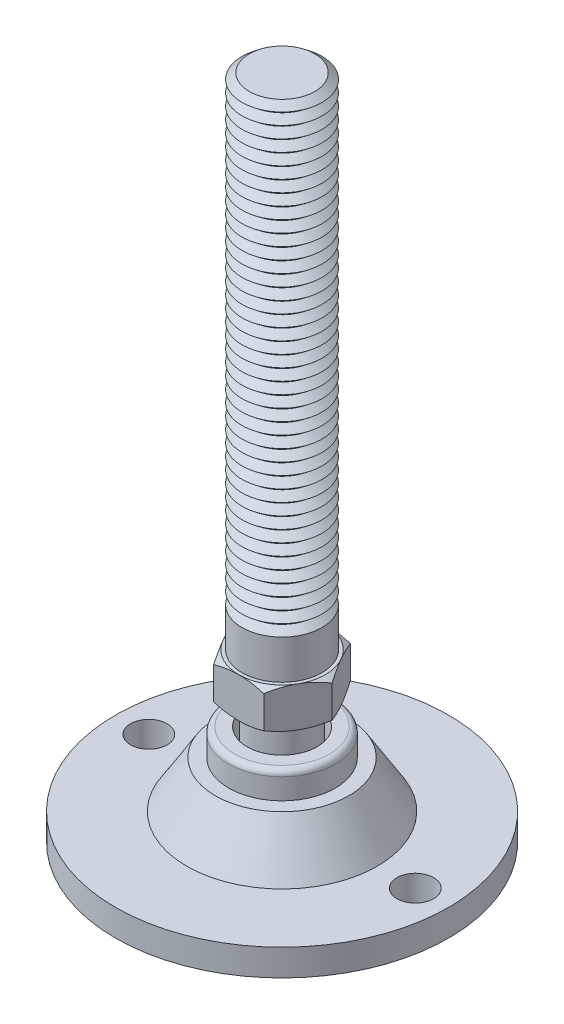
ISO-10303-21;
HEADER;
FILE_DESCRIPTION(('STEP AP214'),'2;1');
FILE_NAME('part.step','',(''),(''),'','','');
FILE_SCHEMA(('AUTOMOTIVE_DESIGN { 1 0 10303 214 1 1 1 1 }'));
ENDSEC;
DATA;
#1=APPLICATION_CONTEXT('core data for automotive mechanical design processes');
#2=APPLICATION_PROTOCOL_DEFINITION('international standard','automotive_design',2000,#1);
#3=PRODUCT_CONTEXT('',#1,'mechanical');
#4=PRODUCT('Part','Part','',(#3));
#5=PRODUCT_RELATED_PRODUCT_CATEGORY('part','',(#4));
#6=PRODUCT_DEFINITION_FORMATION('','',#4);
#7=PRODUCT_DEFINITION_CONTEXT('part definition',#1,'design');
#8=PRODUCT_DEFINITION('design','',#6,#7);
#9=PRODUCT_DEFINITION_SHAPE('','',#8);
#10=(LENGTH_UNIT() NAMED_UNIT(*) SI_UNIT(.MILLI.,.METRE.));
#11=(NAMED_UNIT(*) PLANE_ANGLE_UNIT() SI_UNIT($,.RADIAN.));
#12=(NAMED_UNIT(*) SI_UNIT($,.STERADIAN.) SOLID_ANGLE_UNIT());
#13=UNCERTAINTY_MEASURE_WITH_UNIT(LENGTH_MEASURE(1.E-05),#10,'distance_accuracy_value','');
#14=(GEOMETRIC_REPRESENTATION_CONTEXT(3) GLOBAL_UNCERTAINTY_ASSIGNED_CONTEXT((#13)) GLOBAL_UNIT_ASSIGNED_CONTEXT((#10,
#11,#12)) REPRESENTATION_CONTEXT('',''));
#15=CARTESIAN_POINT('',(0.,0.,0.));
#16=DIRECTION('',(0.,0.,1.));
#17=DIRECTION('',(1.,0.,0.));
#18=AXIS2_PLACEMENT_3D('',#15,#16,#17);
#19=CARTESIAN_POINT('',(0.,93.,0.));
#20=DIRECTION('',(0.,-1.,0.));
#21=DIRECTION('',(0.,0.,-1.));
#22=AXIS2_PLACEMENT_3D('',#19,#20,#21);
#23=CONICAL_SURFACE('',#22,4.90712535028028,0.895664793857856);
#24=CARTESIAN_POINT('',(0.,92.125,0.));
#25=DIRECTION('',(0.,-1.,0.));
#26=DIRECTION('',(0.,0.,-1.));
#27=AXIS2_PLACEMENT_3D('',#24,#25,#26);
#28=CIRCLE('',#27,6.);
#29=CARTESIAN_POINT('',(0.,92.125,-6.));
#30=VERTEX_POINT('',#29);
#31=EDGE_CURVE('P0_E1508',#30,#30,#28,.T.);
#32=ORIENTED_EDGE('',*,*,#31,.F.);
#33=EDGE_LOOP('',(#32));
#34=FACE_BOUND('',#33,.T.);
#35=CARTESIAN_POINT('',(0.,93.,0.));
#36=DIRECTION('',(0.,-1.,0.));
#37=DIRECTION('',(0.,0.,-1.));
#38=AXIS2_PLACEMENT_3D('',#35,#36,#37);
#39=CIRCLE('',#38,4.90712535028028);
#40=CARTESIAN_POINT('',(0.,93.,-4.90712535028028));
#41=VERTEX_POINT('',#40);
#42=EDGE_CURVE('P0_E1517',#41,#41,#39,.T.);
#43=ORIENTED_EDGE('',*,*,#42,.T.);
#44=EDGE_LOOP('',(#43));
#45=FACE_BOUND('',#44,.T.);
#46=ADVANCED_FACE('P0_F16',(#34,#45),#23,.T.);
#47=CARTESIAN_POINT('',(0.,93.875,0.));
#48=DIRECTION('',(0.,1.,0.));
#49=DIRECTION('',(0.,0.,1.));
#50=AXIS2_PLACEMENT_3D('',#47,#48,#49);
#51=CONICAL_SURFACE('',#50,6.,0.895664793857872);
#52=ORIENTED_EDGE('',*,*,#42,.F.);
#53=EDGE_LOOP('',(#52));
#54=FACE_BOUND('',#53,.T.);
#55=CARTESIAN_POINT('',(0.,93.875,0.));
#56=DIRECTION('',(0.,-1.,0.));
#57=DIRECTION('',(0.,0.,-1.));
#58=AXIS2_PLACEMENT_3D('',#55,#56,#57);
#59=CIRCLE('',#58,6.);
#60=CARTESIAN_POINT('',(0.,93.875,-6.));
#61=VERTEX_POINT('',#60);
#62=EDGE_CURVE('P0_E1514',#61,#61,#59,.T.);
#63=ORIENTED_EDGE('',*,*,#62,.T.);
#64=EDGE_LOOP('',(#63));
#65=FACE_BOUND('',#64,.T.);
#66=ADVANCED_FACE('P0_F308',(#54,#65),#51,.T.);
#67=CARTESIAN_POINT('',(0.,100.,0.));
#68=DIRECTION('',(0.,1.,0.));
#69=DIRECTION('',(0.,0.,1.));
#70=AXIS2_PLACEMENT_3D('',#67,#68,#69);
#71=PLANE('',#70);
#72=CARTESIAN_POINT('',(0.,100.,0.));
#73=DIRECTION('',(0.,-1.,0.));
#74=DIRECTION('',(0.,0.,-1.));
#75=AXIS2_PLACEMENT_3D('',#72,#73,#74);
#76=CIRCLE('',#75,4.90712535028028);
#77=CARTESIAN_POINT('',(0.,100.,-4.90712535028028));
#78=VERTEX_POINT('',#77);
#79=EDGE_CURVE('P0_E143',#78,#78,#76,.T.);
#80=ORIENTED_EDGE('',*,*,#79,.F.);
#81=EDGE_LOOP('',(#80));
#82=FACE_BOUND('',#81,.T.);
#83=ADVANCED_FACE('P0_F314',(#82),#71,.T.);
#84=CARTESIAN_POINT('',(0.,100.,0.));
#85=DIRECTION('',(0.,-1.,0.));
#86=DIRECTION('',(0.,0.,-1.));
#87=AXIS2_PLACEMENT_3D('',#84,#85,#86);
#88=CONICAL_SURFACE('',#87,4.90712535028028,0.895664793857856);
#89=CARTESIAN_POINT('',(0.,99.125,0.));
#90=DIRECTION('',(0.,-1.,0.));
#91=DIRECTION('',(0.,0.,-1.));
#92=AXIS2_PLACEMENT_3D('',#89,#90,#91);
#93=CIRCLE('',#92,6.);
#94=CARTESIAN_POINT('',(0.,99.125,-6.));
#95=VERTEX_POINT('',#94);
#96=EDGE_CURVE('P0_E353',#95,#95,#93,.T.);
#97=ORIENTED_EDGE('',*,*,#96,.F.);
#98=EDGE_LOOP('',(#97));
#99=FACE_BOUND('',#98,.T.);
#100=ORIENTED_EDGE('',*,*,#79,.T.);
#101=EDGE_LOOP('',(#100));
#102=FACE_BOUND('',#101,.T.);
#103=ADVANCED_FACE('P0_F211',(#99,#102),#88,.T.);
#104=CARTESIAN_POINT('',(0.,99.125,0.));
#105=DIRECTION('',(0.,1.,0.));
#106=DIRECTION('',(0.,0.,1.));
#107=AXIS2_PLACEMENT_3D('',#104,#105,#106);
#108=CONICAL_SURFACE('',#107,6.,0.895664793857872);
#109=CARTESIAN_POINT('',(0.,98.25,0.));
#110=DIRECTION('',(0.,-1.,0.));
#111=DIRECTION('',(0.,0.,-1.));
#112=AXIS2_PLACEMENT_3D('',#109,#110,#111);
#113=CIRCLE('',#112,4.90712535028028);
#114=CARTESIAN_POINT('',(0.,98.25,-4.90712535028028));
#115=VERTEX_POINT('',#114);
#116=EDGE_CURVE('P0_E352',#115,#115,#113,.T.);
#117=ORIENTED_EDGE('',*,*,#116,.F.);
#118=EDGE_LOOP('',(#117));
#119=FACE_BOUND('',#118,.T.);
#120=ORIENTED_EDGE('',*,*,#96,.T.);
#121=EDGE_LOOP('',(#120));
#122=FACE_BOUND('',#121,.T.);
#123=ADVANCED_FACE('P0_F339',(#119,#122),#108,.T.);
#124=CARTESIAN_POINT('',(0.,98.25,0.));
#125=DIRECTION('',(0.,-1.,0.));
#126=DIRECTION('',(0.,0.,-1.));
#127=AXIS2_PLACEMENT_3D('',#124,#125,#126);
#128=CONICAL_SURFACE('',#127,4.90712535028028,0.895664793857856);
#129=CARTESIAN_POINT('',(0.,97.375,0.));
#130=DIRECTION('',(0.,-1.,0.));
#131=DIRECTION('',(0.,0.,-1.));
#132=AXIS2_PLACEMENT_3D('',#129,#130,#131);
#133=CIRCLE('',#132,6.);
#134=CARTESIAN_POINT('',(0.,97.375,-6.));
#135=VERTEX_POINT('',#134);
#136=EDGE_CURVE('P0_E349',#135,#135,#133,.T.);
#137=ORIENTED_EDGE('',*,*,#136,.F.);
#138=EDGE_LOOP('',(#137));
#139=FACE_BOUND('',#138,.T.);
#140=ORIENTED_EDGE('',*,*,#116,.T.);
#141=EDGE_LOOP('',(#140));
#142=FACE_BOUND('',#141,.T.);
#143=ADVANCED_FACE('P0_F334',(#139,#142),#128,.T.);
#144=CARTESIAN_POINT('',(0.,97.375,0.));
#145=DIRECTION('',(0.,1.,0.));
#146=DIRECTION('',(0.,0.,1.));
#147=AXIS2_PLACEMENT_3D('',#144,#145,#146);
#148=CONICAL_SURFACE('',#147,6.,0.895664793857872);
#149=CARTESIAN_POINT('',(0.,96.5,0.));
#150=DIRECTION('',(0.,-1.,0.));
#151=DIRECTION('',(0.,0.,-1.));
#152=AXIS2_PLACEMENT_3D('',#149,#150,#151);
#153=CIRCLE('',#152,4.90712535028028);
#154=CARTESIAN_POINT('',(0.,96.5,-4.90712535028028));
#155=VERTEX_POINT('',#154);
#156=EDGE_CURVE('P0_E358',#155,#155,#153,.T.);
#157=ORIENTED_EDGE('',*,*,#156,.F.);
#158=EDGE_LOOP('',(#157));
#159=FACE_BOUND('',#158,.T.);
#160=ORIENTED_EDGE('',*,*,#136,.T.);
#161=EDGE_LOOP('',(#160));
#162=FACE_BOUND('',#161,.T.);
#163=ADVANCED_FACE('P0_F331',(#159,#162),#148,.T.);
#164=CARTESIAN_POINT('',(0.,96.5,0.));
#165=DIRECTION('',(0.,-1.,0.));
#166=DIRECTION('',(0.,0.,-1.));
#167=AXIS2_PLACEMENT_3D('',#164,#165,#166);
#168=CONICAL_SURFACE('',#167,4.90712535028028,0.895664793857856);
#169=CARTESIAN_POINT('',(0.,95.625,0.));
#170=DIRECTION('',(0.,-1.,0.));
#171=DIRECTION('',(0.,0.,-1.));
#172=AXIS2_PLACEMENT_3D('',#169,#170,#171);
#173=CIRCLE('',#172,6.);
#174=CARTESIAN_POINT('',(0.,95.625,-6.));
#175=VERTEX_POINT('',#174);
#176=EDGE_CURVE('P0_E1520',#175,#175,#173,.T.);
#177=ORIENTED_EDGE('',*,*,#176,.F.);
#178=EDGE_LOOP('',(#177));
#179=FACE_BOUND('',#178,.T.);
#180=ORIENTED_EDGE('',*,*,#156,.T.);
#181=EDGE_LOOP('',(#180));
#182=FACE_BOUND('',#181,.T.);
#183=ADVANCED_FACE('P0_F325',(#179,#182),#168,.T.);
#184=CARTESIAN_POINT('',(0.,95.625,0.));
#185=DIRECTION('',(0.,1.,0.));
#186=DIRECTION('',(0.,0.,1.));
#187=AXIS2_PLACEMENT_3D('',#184,#185,#186);
#188=CONICAL_SURFACE('',#187,6.,0.895664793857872);
#189=CARTESIAN_POINT('',(0.,94.75,0.));
#190=DIRECTION('',(0.,-1.,0.));
#191=DIRECTION('',(0.,0.,-1.));
#192=AXIS2_PLACEMENT_3D('',#189,#190,#191);
#193=CIRCLE('',#192,4.90712535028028);
#194=CARTESIAN_POINT('',(0.,94.75,-4.90712535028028));
#195=VERTEX_POINT('',#194);
#196=EDGE_CURVE('P0_E1523',#195,#195,#193,.T.);
#197=ORIENTED_EDGE('',*,*,#196,.F.);
#198=EDGE_LOOP('',(#197));
#199=FACE_BOUND('',#198,.T.);
#200=ORIENTED_EDGE('',*,*,#176,.T.);
#201=EDGE_LOOP('',(#200));
#202=FACE_BOUND('',#201,.T.);
#203=ADVANCED_FACE('P0_F321',(#199,#202),#188,.T.);
#204=CARTESIAN_POINT('',(0.,94.75,0.));
#205=DIRECTION('',(0.,-1.,0.));
#206=DIRECTION('',(0.,0.,-1.));
#207=AXIS2_PLACEMENT_3D('',#204,#205,#206);
#208=CONICAL_SURFACE('',#207,4.90712535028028,0.895664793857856);
#209=ORIENTED_EDGE('',*,*,#62,.F.);
#210=EDGE_LOOP('',(#209));
#211=FACE_BOUND('',#210,.T.);
#212=ORIENTED_EDGE('',*,*,#196,.T.);
#213=EDGE_LOOP('',(#212));
#214=FACE_BOUND('',#213,.T.);
#215=ADVANCED_FACE('P0_F324',(#211,#214),#208,.T.);
#216=CARTESIAN_POINT('',(0.,91.25,0.));
#217=DIRECTION('',(0.,-1.,0.));
#218=DIRECTION('',(0.,0.,-1.));
#219=AXIS2_PLACEMENT_3D('',#216,#217,#218);
#220=CONICAL_SURFACE('',#219,4.90712535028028,0.895664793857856);
#221=CARTESIAN_POINT('',(0.,90.375,0.));
#222=DIRECTION('',(0.,-1.,0.));
#223=DIRECTION('',(0.,0.,-1.));
#224=AXIS2_PLACEMENT_3D('',#221,#222,#223);
#225=CIRCLE('',#224,6.);
#226=CARTESIAN_POINT('',(0.,90.375,-6.));
#227=VERTEX_POINT('',#226);
#228=EDGE_CURVE('P0_E1502',#227,#227,#225,.T.);
#229=ORIENTED_EDGE('',*,*,#228,.F.);
#230=EDGE_LOOP('',(#229));
#231=FACE_BOUND('',#230,.T.);
#232=CARTESIAN_POINT('',(0.,91.25,0.));
#233=DIRECTION('',(0.,-1.,0.));
#234=DIRECTION('',(0.,0.,-1.));
#235=AXIS2_PLACEMENT_3D('',#232,#233,#234);
#236=CIRCLE('',#235,4.90712535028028);
#237=CARTESIAN_POINT('',(0.,91.25,-4.90712535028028));
#238=VERTEX_POINT('',#237);
#239=EDGE_CURVE('P0_E1511',#238,#238,#236,.T.);
#240=ORIENTED_EDGE('',*,*,#239,.T.);
#241=EDGE_LOOP('',(#240));
#242=FACE_BOUND('',#241,.T.);
#243=ADVANCED_FACE('P0_F329',(#231,#242),#220,.T.);
#244=CARTESIAN_POINT('',(0.,92.125,0.));
#245=DIRECTION('',(0.,1.,0.));
#246=DIRECTION('',(0.,0.,1.));
#247=AXIS2_PLACEMENT_3D('',#244,#245,#246);
#248=CONICAL_SURFACE('',#247,6.,0.895664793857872);
#249=ORIENTED_EDGE('',*,*,#239,.F.);
#250=EDGE_LOOP('',(#249));
#251=FACE_BOUND('',#250,.T.);
#252=ORIENTED_EDGE('',*,*,#31,.T.);
#253=EDGE_LOOP('',(#252));
#254=FACE_BOUND('',#253,.T.);
#255=ADVANCED_FACE('P0_F1204',(#251,#254),#248,.T.);
#256=CARTESIAN_POINT('',(0.,89.5,0.));
#257=DIRECTION('',(0.,-1.,0.));
#258=DIRECTION('',(0.,0.,-1.));
#259=AXIS2_PLACEMENT_3D('',#256,#257,#258);
#260=CONICAL_SURFACE('',#259,4.90712535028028,0.895664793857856);
#261=CARTESIAN_POINT('',(0.,88.625,0.));
#262=DIRECTION('',(0.,-1.,0.));
#263=DIRECTION('',(0.,0.,-1.));
#264=AXIS2_PLACEMENT_3D('',#261,#262,#263);
#265=CIRCLE('',#264,6.);
#266=CARTESIAN_POINT('',(0.,88.625,-6.));
#267=VERTEX_POINT('',#266);
#268=EDGE_CURVE('P0_E1496',#267,#267,#265,.T.);
#269=ORIENTED_EDGE('',*,*,#268,.F.);
#270=EDGE_LOOP('',(#269));
#271=FACE_BOUND('',#270,.T.);
#272=CARTESIAN_POINT('',(0.,89.5,0.));
#273=DIRECTION('',(0.,-1.,0.));
#274=DIRECTION('',(0.,0.,-1.));
#275=AXIS2_PLACEMENT_3D('',#272,#273,#274);
#276=CIRCLE('',#275,4.90712535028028);
#277=CARTESIAN_POINT('',(0.,89.5,-4.90712535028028));
#278=VERTEX_POINT('',#277);
#279=EDGE_CURVE('P0_E1505',#278,#278,#276,.T.);
#280=ORIENTED_EDGE('',*,*,#279,.T.);
#281=EDGE_LOOP('',(#280));
#282=FACE_BOUND('',#281,.T.);
#283=ADVANCED_FACE('P0_F1194',(#271,#282),#260,.T.);
#284=CARTESIAN_POINT('',(0.,90.375,0.));
#285=DIRECTION('',(0.,1.,0.));
#286=DIRECTION('',(0.,0.,1.));
#287=AXIS2_PLACEMENT_3D('',#284,#285,#286);
#288=CONICAL_SURFACE('',#287,6.,0.895664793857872);
#289=ORIENTED_EDGE('',*,*,#279,.F.);
#290=EDGE_LOOP('',(#289));
#291=FACE_BOUND('',#290,.T.);
#292=ORIENTED_EDGE('',*,*,#228,.T.);
#293=EDGE_LOOP('',(#292));
#294=FACE_BOUND('',#293,.T.);
#295=ADVANCED_FACE('P0_F1184',(#291,#294),#288,.T.);
#296=CARTESIAN_POINT('',(0.,87.75,0.));
#297=DIRECTION('',(0.,-1.,0.));
#298=DIRECTION('',(0.,0.,-1.));
#299=AXIS2_PLACEMENT_3D('',#296,#297,#298);
#300=CONICAL_SURFACE('',#299,4.90712535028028,0.895664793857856);
#301=CARTESIAN_POINT('',(0.,86.875,0.));
#302=DIRECTION('',(0.,-1.,0.));
#303=DIRECTION('',(0.,0.,-1.));
#304=AXIS2_PLACEMENT_3D('',#301,#302,#303);
#305=CIRCLE('',#304,6.);
#306=CARTESIAN_POINT('',(0.,86.875,-6.));
#307=VERTEX_POINT('',#306);
#308=EDGE_CURVE('P0_E1490',#307,#307,#305,.T.);
#309=ORIENTED_EDGE('',*,*,#308,.F.);
#310=EDGE_LOOP('',(#309));
#311=FACE_BOUND('',#310,.T.);
#312=CARTESIAN_POINT('',(0.,87.75,0.));
#313=DIRECTION('',(0.,-1.,0.));
#314=DIRECTION('',(0.,0.,-1.));
#315=AXIS2_PLACEMENT_3D('',#312,#313,#314);
#316=CIRCLE('',#315,4.90712535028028);
#317=CARTESIAN_POINT('',(0.,87.75,-4.90712535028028));
#318=VERTEX_POINT('',#317);
#319=EDGE_CURVE('P0_E1499',#318,#318,#316,.T.);
#320=ORIENTED_EDGE('',*,*,#319,.T.);
#321=EDGE_LOOP('',(#320));
#322=FACE_BOUND('',#321,.T.);
#323=ADVANCED_FACE('P0_F1174',(#311,#322),#300,.T.);
#324=CARTESIAN_POINT('',(0.,88.625,0.));
#325=DIRECTION('',(0.,1.,0.));
#326=DIRECTION('',(0.,0.,1.));
#327=AXIS2_PLACEMENT_3D('',#324,#325,#326);
#328=CONICAL_SURFACE('',#327,6.,0.895664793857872);
#329=ORIENTED_EDGE('',*,*,#319,.F.);
#330=EDGE_LOOP('',(#329));
#331=FACE_BOUND('',#330,.T.);
#332=ORIENTED_EDGE('',*,*,#268,.T.);
#333=EDGE_LOOP('',(#332));
#334=FACE_BOUND('',#333,.T.);
#335=ADVANCED_FACE('P0_F1164',(#331,#334),#328,.T.);
#336=CARTESIAN_POINT('',(0.,86.,0.));
#337=DIRECTION('',(0.,-1.,0.));
#338=DIRECTION('',(0.,0.,-1.));
#339=AXIS2_PLACEMENT_3D('',#336,#337,#338);
#340=CONICAL_SURFACE('',#339,4.90712535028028,0.895664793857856);
#341=CARTESIAN_POINT('',(0.,85.125,0.));
#342=DIRECTION('',(0.,-1.,0.));
#343=DIRECTION('',(0.,0.,-1.));
#344=AXIS2_PLACEMENT_3D('',#341,#342,#343);
#345=CIRCLE('',#344,6.);
#346=CARTESIAN_POINT('',(0.,85.125,-6.));
#347=VERTEX_POINT('',#346);
#348=EDGE_CURVE('P0_E1484',#347,#347,#345,.T.);
#349=ORIENTED_EDGE('',*,*,#348,.F.);
#350=EDGE_LOOP('',(#349));
#351=FACE_BOUND('',#350,.T.);
#352=CARTESIAN_POINT('',(0.,86.,0.));
#353=DIRECTION('',(0.,-1.,0.));
#354=DIRECTION('',(0.,0.,-1.));
#355=AXIS2_PLACEMENT_3D('',#352,#353,#354);
#356=CIRCLE('',#355,4.90712535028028);
#357=CARTESIAN_POINT('',(0.,86.,-4.90712535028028));
#358=VERTEX_POINT('',#357);
#359=EDGE_CURVE('P0_E1493',#358,#358,#356,.T.);
#360=ORIENTED_EDGE('',*,*,#359,.T.);
#361=EDGE_LOOP('',(#360));
#362=FACE_BOUND('',#361,.T.);
#363=ADVANCED_FACE('P0_F1154',(#351,#362),#340,.T.);
#364=CARTESIAN_POINT('',(0.,86.875,0.));
#365=DIRECTION('',(0.,1.,0.));
#366=DIRECTION('',(0.,0.,1.));
#367=AXIS2_PLACEMENT_3D('',#364,#365,#366);
#368=CONICAL_SURFACE('',#367,6.,0.895664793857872);
#369=ORIENTED_EDGE('',*,*,#359,.F.);
#370=EDGE_LOOP('',(#369));
#371=FACE_BOUND('',#370,.T.);
#372=ORIENTED_EDGE('',*,*,#308,.T.);
#373=EDGE_LOOP('',(#372));
#374=FACE_BOUND('',#373,.T.);
#375=ADVANCED_FACE('P0_F1144',(#371,#374),#368,.T.);
#376=CARTESIAN_POINT('',(0.,84.25,0.));
#377=DIRECTION('',(0.,-1.,0.));
#378=DIRECTION('',(0.,0.,-1.));
#379=AXIS2_PLACEMENT_3D('',#376,#377,#378);
#380=CONICAL_SURFACE('',#379,4.90712535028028,0.895664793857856);
#381=CARTESIAN_POINT('',(0.,83.375,0.));
#382=DIRECTION('',(0.,-1.,0.));
#383=DIRECTION('',(0.,0.,-1.));
#384=AXIS2_PLACEMENT_3D('',#381,#382,#383);
#385=CIRCLE('',#384,6.);
#386=CARTESIAN_POINT('',(0.,83.375,-6.));
#387=VERTEX_POINT('',#386);
#388=EDGE_CURVE('P0_E1478',#387,#387,#385,.T.);
#389=ORIENTED_EDGE('',*,*,#388,.F.);
#390=EDGE_LOOP('',(#389));
#391=FACE_BOUND('',#390,.T.);
#392=CARTESIAN_POINT('',(0.,84.25,0.));
#393=DIRECTION('',(0.,-1.,0.));
#394=DIRECTION('',(0.,0.,-1.));
#395=AXIS2_PLACEMENT_3D('',#392,#393,#394);
#396=CIRCLE('',#395,4.90712535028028);
#397=CARTESIAN_POINT('',(0.,84.25,-4.90712535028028));
#398=VERTEX_POINT('',#397);
#399=EDGE_CURVE('P0_E1487',#398,#398,#396,.T.);
#400=ORIENTED_EDGE('',*,*,#399,.T.);
#401=EDGE_LOOP('',(#400));
#402=FACE_BOUND('',#401,.T.);
#403=ADVANCED_FACE('P0_F1134',(#391,#402),#380,.T.);
#404=CARTESIAN_POINT('',(0.,85.125,0.));
#405=DIRECTION('',(0.,1.,0.));
#406=DIRECTION('',(0.,0.,1.));
#407=AXIS2_PLACEMENT_3D('',#404,#405,#406);
#408=CONICAL_SURFACE('',#407,6.,0.895664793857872);
#409=ORIENTED_EDGE('',*,*,#399,.F.);
#410=EDGE_LOOP('',(#409));
#411=FACE_BOUND('',#410,.T.);
#412=ORIENTED_EDGE('',*,*,#348,.T.);
#413=EDGE_LOOP('',(#412));
#414=FACE_BOUND('',#413,.T.);
#415=ADVANCED_FACE('P0_F1124',(#411,#414),#408,.T.);
#416=CARTESIAN_POINT('',(0.,82.5,0.));
#417=DIRECTION('',(0.,-1.,0.));
#418=DIRECTION('',(0.,0.,-1.));
#419=AXIS2_PLACEMENT_3D('',#416,#417,#418);
#420=CONICAL_SURFACE('',#419,4.90712535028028,0.895664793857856);
#421=CARTESIAN_POINT('',(0.,81.625,0.));
#422=DIRECTION('',(0.,-1.,0.));
#423=DIRECTION('',(0.,0.,-1.));
#424=AXIS2_PLACEMENT_3D('',#421,#422,#423);
#425=CIRCLE('',#424,6.);
#426=CARTESIAN_POINT('',(0.,81.625,-6.));
#427=VERTEX_POINT('',#426);
#428=EDGE_CURVE('P0_E1472',#427,#427,#425,.T.);
#429=ORIENTED_EDGE('',*,*,#428,.F.);
#430=EDGE_LOOP('',(#429));
#431=FACE_BOUND('',#430,.T.);
#432=CARTESIAN_POINT('',(0.,82.5,0.));
#433=DIRECTION('',(0.,-1.,0.));
#434=DIRECTION('',(0.,0.,-1.));
#435=AXIS2_PLACEMENT_3D('',#432,#433,#434);
#436=CIRCLE('',#435,4.90712535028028);
#437=CARTESIAN_POINT('',(0.,82.5,-4.90712535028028));
#438=VERTEX_POINT('',#437);
#439=EDGE_CURVE('P0_E1481',#438,#438,#436,.T.);
#440=ORIENTED_EDGE('',*,*,#439,.T.);
#441=EDGE_LOOP('',(#440));
#442=FACE_BOUND('',#441,.T.);
#443=ADVANCED_FACE('P0_F1114',(#431,#442),#420,.T.);
#444=CARTESIAN_POINT('',(0.,83.375,0.));
#445=DIRECTION('',(0.,1.,0.));
#446=DIRECTION('',(0.,0.,1.));
#447=AXIS2_PLACEMENT_3D('',#444,#445,#446);
#448=CONICAL_SURFACE('',#447,6.,0.895664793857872);
#449=ORIENTED_EDGE('',*,*,#439,.F.);
#450=EDGE_LOOP('',(#449));
#451=FACE_BOUND('',#450,.T.);
#452=ORIENTED_EDGE('',*,*,#388,.T.);
#453=EDGE_LOOP('',(#452));
#454=FACE_BOUND('',#453,.T.);
#455=ADVANCED_FACE('P0_F1104',(#451,#454),#448,.T.);
#456=CARTESIAN_POINT('',(0.,80.75,0.));
#457=DIRECTION('',(0.,-1.,0.));
#458=DIRECTION('',(0.,0.,-1.));
#459=AXIS2_PLACEMENT_3D('',#456,#457,#458);
#460=CONICAL_SURFACE('',#459,4.90712535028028,0.895664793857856);
#461=CARTESIAN_POINT('',(0.,79.875,0.));
#462=DIRECTION('',(0.,-1.,0.));
#463=DIRECTION('',(0.,0.,-1.));
#464=AXIS2_PLACEMENT_3D('',#461,#462,#463);
#465=CIRCLE('',#464,6.);
#466=CARTESIAN_POINT('',(0.,79.875,-6.));
#467=VERTEX_POINT('',#466);
#468=EDGE_CURVE('P0_E1466',#467,#467,#465,.T.);
#469=ORIENTED_EDGE('',*,*,#468,.F.);
#470=EDGE_LOOP('',(#469));
#471=FACE_BOUND('',#470,.T.);
#472=CARTESIAN_POINT('',(0.,80.75,0.));
#473=DIRECTION('',(0.,-1.,0.));
#474=DIRECTION('',(0.,0.,-1.));
#475=AXIS2_PLACEMENT_3D('',#472,#473,#474);
#476=CIRCLE('',#475,4.90712535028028);
#477=CARTESIAN_POINT('',(0.,80.75,-4.90712535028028));
#478=VERTEX_POINT('',#477);
#479=EDGE_CURVE('P0_E1475',#478,#478,#476,.T.);
#480=ORIENTED_EDGE('',*,*,#479,.T.);
#481=EDGE_LOOP('',(#480));
#482=FACE_BOUND('',#481,.T.);
#483=ADVANCED_FACE('P0_F1094',(#471,#482),#460,.T.);
#484=CARTESIAN_POINT('',(0.,81.625,0.));
#485=DIRECTION('',(0.,1.,0.));
#486=DIRECTION('',(0.,0.,1.));
#487=AXIS2_PLACEMENT_3D('',#484,#485,#486);
#488=CONICAL_SURFACE('',#487,6.,0.895664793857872);
#489=ORIENTED_EDGE('',*,*,#479,.F.);
#490=EDGE_LOOP('',(#489));
#491=FACE_BOUND('',#490,.T.);
#492=ORIENTED_EDGE('',*,*,#428,.T.);
#493=EDGE_LOOP('',(#492));
#494=FACE_BOUND('',#493,.T.);
#495=ADVANCED_FACE('P0_F1084',(#491,#494),#488,.T.);
#496=CARTESIAN_POINT('',(0.,79.,0.));
#497=DIRECTION('',(0.,-1.,0.));
#498=DIRECTION('',(0.,0.,-1.));
#499=AXIS2_PLACEMENT_3D('',#496,#497,#498);
#500=CONICAL_SURFACE('',#499,4.90712535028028,0.895664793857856);
#501=CARTESIAN_POINT('',(0.,78.125,0.));
#502=DIRECTION('',(0.,-1.,0.));
#503=DIRECTION('',(0.,0.,-1.));
#504=AXIS2_PLACEMENT_3D('',#501,#502,#503);
#505=CIRCLE('',#504,6.);
#506=CARTESIAN_POINT('',(0.,78.125,-6.));
#507=VERTEX_POINT('',#506);
#508=EDGE_CURVE('P0_E1460',#507,#507,#505,.T.);
#509=ORIENTED_EDGE('',*,*,#508,.F.);
#510=EDGE_LOOP('',(#509));
#511=FACE_BOUND('',#510,.T.);
#512=CARTESIAN_POINT('',(0.,79.,0.));
#513=DIRECTION('',(0.,-1.,0.));
#514=DIRECTION('',(0.,0.,-1.));
#515=AXIS2_PLACEMENT_3D('',#512,#513,#514);
#516=CIRCLE('',#515,4.90712535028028);
#517=CARTESIAN_POINT('',(0.,79.,-4.90712535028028));
#518=VERTEX_POINT('',#517);
#519=EDGE_CURVE('P0_E1469',#518,#518,#516,.T.);
#520=ORIENTED_EDGE('',*,*,#519,.T.);
#521=EDGE_LOOP('',(#520));
#522=FACE_BOUND('',#521,.T.);
#523=ADVANCED_FACE('P0_F1074',(#511,#522),#500,.T.);
#524=CARTESIAN_POINT('',(0.,79.875,0.));
#525=DIRECTION('',(0.,1.,0.));
#526=DIRECTION('',(0.,0.,1.));
#527=AXIS2_PLACEMENT_3D('',#524,#525,#526);
#528=CONICAL_SURFACE('',#527,6.,0.895664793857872);
#529=ORIENTED_EDGE('',*,*,#519,.F.);
#530=EDGE_LOOP('',(#529));
#531=FACE_BOUND('',#530,.T.);
#532=ORIENTED_EDGE('',*,*,#468,.T.);
#533=EDGE_LOOP('',(#532));
#534=FACE_BOUND('',#533,.T.);
#535=ADVANCED_FACE('P0_F1064',(#531,#534),#528,.T.);
#536=CARTESIAN_POINT('',(0.,77.25,0.));
#537=DIRECTION('',(0.,-1.,0.));
#538=DIRECTION('',(0.,0.,-1.));
#539=AXIS2_PLACEMENT_3D('',#536,#537,#538);
#540=CONICAL_SURFACE('',#539,4.90712535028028,0.895664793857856);
#541=CARTESIAN_POINT('',(0.,76.375,0.));
#542=DIRECTION('',(0.,-1.,0.));
#543=DIRECTION('',(0.,0.,-1.));
#544=AXIS2_PLACEMENT_3D('',#541,#542,#543);
#545=CIRCLE('',#544,6.);
#546=CARTESIAN_POINT('',(0.,76.375,-6.));
#547=VERTEX_POINT('',#546);
#548=EDGE_CURVE('P0_E1454',#547,#547,#545,.T.);
#549=ORIENTED_EDGE('',*,*,#548,.F.);
#550=EDGE_LOOP('',(#549));
#551=FACE_BOUND('',#550,.T.);
#552=CARTESIAN_POINT('',(0.,77.25,0.));
#553=DIRECTION('',(0.,-1.,0.));
#554=DIRECTION('',(0.,0.,-1.));
#555=AXIS2_PLACEMENT_3D('',#552,#553,#554);
#556=CIRCLE('',#555,4.90712535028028);
#557=CARTESIAN_POINT('',(0.,77.25,-4.90712535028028));
#558=VERTEX_POINT('',#557);
#559=EDGE_CURVE('P0_E1463',#558,#558,#556,.T.);
#560=ORIENTED_EDGE('',*,*,#559,.T.);
#561=EDGE_LOOP('',(#560));
#562=FACE_BOUND('',#561,.T.);
#563=ADVANCED_FACE('P0_F1054',(#551,#562),#540,.T.);
#564=CARTESIAN_POINT('',(0.,78.125,0.));
#565=DIRECTION('',(0.,1.,0.));
#566=DIRECTION('',(0.,0.,1.));
#567=AXIS2_PLACEMENT_3D('',#564,#565,#566);
#568=CONICAL_SURFACE('',#567,6.,0.895664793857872);
#569=ORIENTED_EDGE('',*,*,#559,.F.);
#570=EDGE_LOOP('',(#569));
#571=FACE_BOUND('',#570,.T.);
#572=ORIENTED_EDGE('',*,*,#508,.T.);
#573=EDGE_LOOP('',(#572));
#574=FACE_BOUND('',#573,.T.);
#575=ADVANCED_FACE('P0_F1044',(#571,#574),#568,.T.);
#576=CARTESIAN_POINT('',(0.,75.5,0.));
#577=DIRECTION('',(0.,-1.,0.));
#578=DIRECTION('',(0.,0.,-1.));
#579=AXIS2_PLACEMENT_3D('',#576,#577,#578);
#580=CONICAL_SURFACE('',#579,4.90712535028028,0.895664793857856);
#581=CARTESIAN_POINT('',(0.,74.625,0.));
#582=DIRECTION('',(0.,-1.,0.));
#583=DIRECTION('',(0.,0.,-1.));
#584=AXIS2_PLACEMENT_3D('',#581,#582,#583);
#585=CIRCLE('',#584,6.);
#586=CARTESIAN_POINT('',(0.,74.625,-6.));
#587=VERTEX_POINT('',#586);
#588=EDGE_CURVE('P0_E1448',#587,#587,#585,.T.);
#589=ORIENTED_EDGE('',*,*,#588,.F.);
#590=EDGE_LOOP('',(#589));
#591=FACE_BOUND('',#590,.T.);
#592=CARTESIAN_POINT('',(0.,75.5,0.));
#593=DIRECTION('',(0.,-1.,0.));
#594=DIRECTION('',(0.,0.,-1.));
#595=AXIS2_PLACEMENT_3D('',#592,#593,#594);
#596=CIRCLE('',#595,4.90712535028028);
#597=CARTESIAN_POINT('',(0.,75.5,-4.90712535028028));
#598=VERTEX_POINT('',#597);
#599=EDGE_CURVE('P0_E1457',#598,#598,#596,.T.);
#600=ORIENTED_EDGE('',*,*,#599,.T.);
#601=EDGE_LOOP('',(#600));
#602=FACE_BOUND('',#601,.T.);
#603=ADVANCED_FACE('P0_F1034',(#591,#602),#580,.T.);
#604=CARTESIAN_POINT('',(0.,76.375,0.));
#605=DIRECTION('',(0.,1.,0.));
#606=DIRECTION('',(0.,0.,1.));
#607=AXIS2_PLACEMENT_3D('',#604,#605,#606);
#608=CONICAL_SURFACE('',#607,6.,0.895664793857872);
#609=ORIENTED_EDGE('',*,*,#599,.F.);
#610=EDGE_LOOP('',(#609));
#611=FACE_BOUND('',#610,.T.);
#612=ORIENTED_EDGE('',*,*,#548,.T.);
#613=EDGE_LOOP('',(#612));
#614=FACE_BOUND('',#613,.T.);
#615=ADVANCED_FACE('P0_F1024',(#611,#614),#608,.T.);
#616=CARTESIAN_POINT('',(0.,73.75,0.));
#617=DIRECTION('',(0.,-1.,0.));
#618=DIRECTION('',(0.,0.,-1.));
#619=AXIS2_PLACEMENT_3D('',#616,#617,#618);
#620=CONICAL_SURFACE('',#619,4.90712535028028,0.895664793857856);
#621=CARTESIAN_POINT('',(0.,72.875,0.));
#622=DIRECTION('',(0.,-1.,0.));
#623=DIRECTION('',(0.,0.,-1.));
#624=AXIS2_PLACEMENT_3D('',#621,#622,#623);
#625=CIRCLE('',#624,6.);
#626=CARTESIAN_POINT('',(0.,72.875,-6.));
#627=VERTEX_POINT('',#626);
#628=EDGE_CURVE('P0_E1442',#627,#627,#625,.T.);
#629=ORIENTED_EDGE('',*,*,#628,.F.);
#630=EDGE_LOOP('',(#629));
#631=FACE_BOUND('',#630,.T.);
#632=CARTESIAN_POINT('',(0.,73.75,0.));
#633=DIRECTION('',(0.,-1.,0.));
#634=DIRECTION('',(0.,0.,-1.));
#635=AXIS2_PLACEMENT_3D('',#632,#633,#634);
#636=CIRCLE('',#635,4.90712535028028);
#637=CARTESIAN_POINT('',(0.,73.75,-4.90712535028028));
#638=VERTEX_POINT('',#637);
#639=EDGE_CURVE('P0_E1451',#638,#638,#636,.T.);
#640=ORIENTED_EDGE('',*,*,#639,.T.);
#641=EDGE_LOOP('',(#640));
#642=FACE_BOUND('',#641,.T.);
#643=ADVANCED_FACE('P0_F1014',(#631,#642),#620,.T.);
#644=CARTESIAN_POINT('',(0.,74.625,0.));
#645=DIRECTION('',(0.,1.,0.));
#646=DIRECTION('',(0.,0.,1.));
#647=AXIS2_PLACEMENT_3D('',#644,#645,#646);
#648=CONICAL_SURFACE('',#647,6.,0.895664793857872);
#649=ORIENTED_EDGE('',*,*,#639,.F.);
#650=EDGE_LOOP('',(#649));
#651=FACE_BOUND('',#650,.T.);
#652=ORIENTED_EDGE('',*,*,#588,.T.);
#653=EDGE_LOOP('',(#652));
#654=FACE_BOUND('',#653,.T.);
#655=ADVANCED_FACE('P0_F1004',(#651,#654),#648,.T.);
#656=CARTESIAN_POINT('',(0.,72.,0.));
#657=DIRECTION('',(0.,-1.,0.));
#658=DIRECTION('',(0.,0.,-1.));
#659=AXIS2_PLACEMENT_3D('',#656,#657,#658);
#660=CONICAL_SURFACE('',#659,4.90712535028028,0.895664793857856);
#661=CARTESIAN_POINT('',(0.,71.125,0.));
#662=DIRECTION('',(0.,-1.,0.));
#663=DIRECTION('',(0.,0.,-1.));
#664=AXIS2_PLACEMENT_3D('',#661,#662,#663);
#665=CIRCLE('',#664,6.);
#666=CARTESIAN_POINT('',(0.,71.125,-6.));
#667=VERTEX_POINT('',#666);
#668=EDGE_CURVE('P0_E1436',#667,#667,#665,.T.);
#669=ORIENTED_EDGE('',*,*,#668,.F.);
#670=EDGE_LOOP('',(#669));
#671=FACE_BOUND('',#670,.T.);
#672=CARTESIAN_POINT('',(0.,72.,0.));
#673=DIRECTION('',(0.,-1.,0.));
#674=DIRECTION('',(0.,0.,-1.));
#675=AXIS2_PLACEMENT_3D('',#672,#673,#674);
#676=CIRCLE('',#675,4.90712535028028);
#677=CARTESIAN_POINT('',(0.,72.,-4.90712535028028));
#678=VERTEX_POINT('',#677);
#679=EDGE_CURVE('P0_E1445',#678,#678,#676,.T.);
#680=ORIENTED_EDGE('',*,*,#679,.T.);
#681=EDGE_LOOP('',(#680));
#682=FACE_BOUND('',#681,.T.);
#683=ADVANCED_FACE('P0_F994',(#671,#682),#660,.T.);
#684=CARTESIAN_POINT('',(0.,72.875,0.));
#685=DIRECTION('',(0.,1.,0.));
#686=DIRECTION('',(0.,0.,1.));
#687=AXIS2_PLACEMENT_3D('',#684,#685,#686);
#688=CONICAL_SURFACE('',#687,6.,0.895664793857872);
#689=ORIENTED_EDGE('',*,*,#679,.F.);
#690=EDGE_LOOP('',(#689));
#691=FACE_BOUND('',#690,.T.);
#692=ORIENTED_EDGE('',*,*,#628,.T.);
#693=EDGE_LOOP('',(#692));
#694=FACE_BOUND('',#693,.T.);
#695=ADVANCED_FACE('P0_F984',(#691,#694),#688,.T.);
#696=CARTESIAN_POINT('',(0.,70.25,0.));
#697=DIRECTION('',(0.,-1.,0.));
#698=DIRECTION('',(0.,0.,-1.));
#699=AXIS2_PLACEMENT_3D('',#696,#697,#698);
#700=CONICAL_SURFACE('',#699,4.90712535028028,0.895664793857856);
#701=CARTESIAN_POINT('',(0.,69.375,0.));
#702=DIRECTION('',(0.,-1.,0.));
#703=DIRECTION('',(0.,0.,-1.));
#704=AXIS2_PLACEMENT_3D('',#701,#702,#703);
#705=CIRCLE('',#704,6.);
#706=CARTESIAN_POINT('',(0.,69.375,-6.));
#707=VERTEX_POINT('',#706);
#708=EDGE_CURVE('P0_E1430',#707,#707,#705,.T.);
#709=ORIENTED_EDGE('',*,*,#708,.F.);
#710=EDGE_LOOP('',(#709));
#711=FACE_BOUND('',#710,.T.);
#712=CARTESIAN_POINT('',(0.,70.25,0.));
#713=DIRECTION('',(0.,-1.,0.));
#714=DIRECTION('',(0.,0.,-1.));
#715=AXIS2_PLACEMENT_3D('',#712,#713,#714);
#716=CIRCLE('',#715,4.90712535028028);
#717=CARTESIAN_POINT('',(0.,70.25,-4.90712535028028));
#718=VERTEX_POINT('',#717);
#719=EDGE_CURVE('P0_E1439',#718,#718,#716,.T.);
#720=ORIENTED_EDGE('',*,*,#719,.T.);
#721=EDGE_LOOP('',(#720));
#722=FACE_BOUND('',#721,.T.);
#723=ADVANCED_FACE('P0_F974',(#711,#722),#700,.T.);
#724=CARTESIAN_POINT('',(0.,71.125,0.));
#725=DIRECTION('',(0.,1.,0.));
#726=DIRECTION('',(0.,0.,1.));
#727=AXIS2_PLACEMENT_3D('',#724,#725,#726);
#728=CONICAL_SURFACE('',#727,6.,0.895664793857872);
#729=ORIENTED_EDGE('',*,*,#719,.F.);
#730=EDGE_LOOP('',(#729));
#731=FACE_BOUND('',#730,.T.);
#732=ORIENTED_EDGE('',*,*,#668,.T.);
#733=EDGE_LOOP('',(#732));
#734=FACE_BOUND('',#733,.T.);
#735=ADVANCED_FACE('P0_F964',(#731,#734),#728,.T.);
#736=CARTESIAN_POINT('',(0.,68.5,0.));
#737=DIRECTION('',(0.,-1.,0.));
#738=DIRECTION('',(0.,0.,-1.));
#739=AXIS2_PLACEMENT_3D('',#736,#737,#738);
#740=CONICAL_SURFACE('',#739,4.90712535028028,0.895664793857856);
#741=CARTESIAN_POINT('',(0.,67.625,0.));
#742=DIRECTION('',(0.,-1.,0.));
#743=DIRECTION('',(0.,0.,-1.));
#744=AXIS2_PLACEMENT_3D('',#741,#742,#743);
#745=CIRCLE('',#744,6.);
#746=CARTESIAN_POINT('',(0.,67.625,-6.));
#747=VERTEX_POINT('',#746);
#748=EDGE_CURVE('P0_E1424',#747,#747,#745,.T.);
#749=ORIENTED_EDGE('',*,*,#748,.F.);
#750=EDGE_LOOP('',(#749));
#751=FACE_BOUND('',#750,.T.);
#752=CARTESIAN_POINT('',(0.,68.5,0.));
#753=DIRECTION('',(0.,-1.,0.));
#754=DIRECTION('',(0.,0.,-1.));
#755=AXIS2_PLACEMENT_3D('',#752,#753,#754);
#756=CIRCLE('',#755,4.90712535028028);
#757=CARTESIAN_POINT('',(0.,68.5,-4.90712535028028));
#758=VERTEX_POINT('',#757);
#759=EDGE_CURVE('P0_E1433',#758,#758,#756,.T.);
#760=ORIENTED_EDGE('',*,*,#759,.T.);
#761=EDGE_LOOP('',(#760));
#762=FACE_BOUND('',#761,.T.);
#763=ADVANCED_FACE('P0_F954',(#751,#762),#740,.T.);
#764=CARTESIAN_POINT('',(0.,69.375,0.));
#765=DIRECTION('',(0.,1.,0.));
#766=DIRECTION('',(0.,0.,1.));
#767=AXIS2_PLACEMENT_3D('',#764,#765,#766);
#768=CONICAL_SURFACE('',#767,6.,0.895664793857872);
#769=ORIENTED_EDGE('',*,*,#759,.F.);
#770=EDGE_LOOP('',(#769));
#771=FACE_BOUND('',#770,.T.);
#772=ORIENTED_EDGE('',*,*,#708,.T.);
#773=EDGE_LOOP('',(#772));
#774=FACE_BOUND('',#773,.T.);
#775=ADVANCED_FACE('P0_F944',(#771,#774),#768,.T.);
#776=CARTESIAN_POINT('',(0.,66.75,0.));
#777=DIRECTION('',(0.,-1.,0.));
#778=DIRECTION('',(0.,0.,-1.));
#779=AXIS2_PLACEMENT_3D('',#776,#777,#778);
#780=CONICAL_SURFACE('',#779,4.90712535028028,0.895664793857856);
#781=CARTESIAN_POINT('',(0.,65.875,0.));
#782=DIRECTION('',(0.,-1.,0.));
#783=DIRECTION('',(0.,0.,-1.));
#784=AXIS2_PLACEMENT_3D('',#781,#782,#783);
#785=CIRCLE('',#784,6.);
#786=CARTESIAN_POINT('',(0.,65.875,-6.));
#787=VERTEX_POINT('',#786);
#788=EDGE_CURVE('P0_E1418',#787,#787,#785,.T.);
#789=ORIENTED_EDGE('',*,*,#788,.F.);
#790=EDGE_LOOP('',(#789));
#791=FACE_BOUND('',#790,.T.);
#792=CARTESIAN_POINT('',(0.,66.75,0.));
#793=DIRECTION('',(0.,-1.,0.));
#794=DIRECTION('',(0.,0.,-1.));
#795=AXIS2_PLACEMENT_3D('',#792,#793,#794);
#796=CIRCLE('',#795,4.90712535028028);
#797=CARTESIAN_POINT('',(0.,66.75,-4.90712535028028));
#798=VERTEX_POINT('',#797);
#799=EDGE_CURVE('P0_E1427',#798,#798,#796,.T.);
#800=ORIENTED_EDGE('',*,*,#799,.T.);
#801=EDGE_LOOP('',(#800));
#802=FACE_BOUND('',#801,.T.);
#803=ADVANCED_FACE('P0_F934',(#791,#802),#780,.T.);
#804=CARTESIAN_POINT('',(0.,67.625,0.));
#805=DIRECTION('',(0.,1.,0.));
#806=DIRECTION('',(0.,0.,1.));
#807=AXIS2_PLACEMENT_3D('',#804,#805,#806);
#808=CONICAL_SURFACE('',#807,6.,0.895664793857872);
#809=ORIENTED_EDGE('',*,*,#799,.F.);
#810=EDGE_LOOP('',(#809));
#811=FACE_BOUND('',#810,.T.);
#812=ORIENTED_EDGE('',*,*,#748,.T.);
#813=EDGE_LOOP('',(#812));
#814=FACE_BOUND('',#813,.T.);
#815=ADVANCED_FACE('P0_F924',(#811,#814),#808,.T.);
#816=CARTESIAN_POINT('',(0.,65.,0.));
#817=DIRECTION('',(0.,-1.,0.));
#818=DIRECTION('',(0.,0.,-1.));
#819=AXIS2_PLACEMENT_3D('',#816,#817,#818);
#820=CONICAL_SURFACE('',#819,4.90712535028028,0.895664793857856);
#821=CARTESIAN_POINT('',(0.,64.125,0.));
#822=DIRECTION('',(0.,-1.,0.));
#823=DIRECTION('',(0.,0.,-1.));
#824=AXIS2_PLACEMENT_3D('',#821,#822,#823);
#825=CIRCLE('',#824,6.);
#826=CARTESIAN_POINT('',(0.,64.125,-6.));
#827=VERTEX_POINT('',#826);
#828=EDGE_CURVE('P0_E1412',#827,#827,#825,.T.);
#829=ORIENTED_EDGE('',*,*,#828,.F.);
#830=EDGE_LOOP('',(#829));
#831=FACE_BOUND('',#830,.T.);
#832=CARTESIAN_POINT('',(0.,65.,0.));
#833=DIRECTION('',(0.,-1.,0.));
#834=DIRECTION('',(0.,0.,-1.));
#835=AXIS2_PLACEMENT_3D('',#832,#833,#834);
#836=CIRCLE('',#835,4.90712535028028);
#837=CARTESIAN_POINT('',(0.,65.,-4.90712535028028));
#838=VERTEX_POINT('',#837);
#839=EDGE_CURVE('P0_E1421',#838,#838,#836,.T.);
#840=ORIENTED_EDGE('',*,*,#839,.T.);
#841=EDGE_LOOP('',(#840));
#842=FACE_BOUND('',#841,.T.);
#843=ADVANCED_FACE('P0_F914',(#831,#842),#820,.T.);
#844=CARTESIAN_POINT('',(0.,65.875,0.));
#845=DIRECTION('',(0.,1.,0.));
#846=DIRECTION('',(0.,0.,1.));
#847=AXIS2_PLACEMENT_3D('',#844,#845,#846);
#848=CONICAL_SURFACE('',#847,6.,0.895664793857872);
#849=ORIENTED_EDGE('',*,*,#839,.F.);
#850=EDGE_LOOP('',(#849));
#851=FACE_BOUND('',#850,.T.);
#852=ORIENTED_EDGE('',*,*,#788,.T.);
#853=EDGE_LOOP('',(#852));
#854=FACE_BOUND('',#853,.T.);
#855=ADVANCED_FACE('P0_F904',(#851,#854),#848,.T.);
#856=CARTESIAN_POINT('',(0.,63.25,0.));
#857=DIRECTION('',(0.,-1.,0.));
#858=DIRECTION('',(0.,0.,-1.));
#859=AXIS2_PLACEMENT_3D('',#856,#857,#858);
#860=CONICAL_SURFACE('',#859,4.90712535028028,0.895664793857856);
#861=CARTESIAN_POINT('',(0.,62.375,0.));
#862=DIRECTION('',(0.,-1.,0.));
#863=DIRECTION('',(0.,0.,-1.));
#864=AXIS2_PLACEMENT_3D('',#861,#862,#863);
#865=CIRCLE('',#864,6.);
#866=CARTESIAN_POINT('',(0.,62.375,-6.));
#867=VERTEX_POINT('',#866);
#868=EDGE_CURVE('P0_E1406',#867,#867,#865,.T.);
#869=ORIENTED_EDGE('',*,*,#868,.F.);
#870=EDGE_LOOP('',(#869));
#871=FACE_BOUND('',#870,.T.);
#872=CARTESIAN_POINT('',(0.,63.25,0.));
#873=DIRECTION('',(0.,-1.,0.));
#874=DIRECTION('',(0.,0.,-1.));
#875=AXIS2_PLACEMENT_3D('',#872,#873,#874);
#876=CIRCLE('',#875,4.90712535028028);
#877=CARTESIAN_POINT('',(0.,63.25,-4.90712535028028));
#878=VERTEX_POINT('',#877);
#879=EDGE_CURVE('P0_E1415',#878,#878,#876,.T.);
#880=ORIENTED_EDGE('',*,*,#879,.T.);
#881=EDGE_LOOP('',(#880));
#882=FACE_BOUND('',#881,.T.);
#883=ADVANCED_FACE('P0_F894',(#871,#882),#860,.T.);
#884=CARTESIAN_POINT('',(0.,64.125,0.));
#885=DIRECTION('',(0.,1.,0.));
#886=DIRECTION('',(0.,0.,1.));
#887=AXIS2_PLACEMENT_3D('',#884,#885,#886);
#888=CONICAL_SURFACE('',#887,6.,0.895664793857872);
#889=ORIENTED_EDGE('',*,*,#879,.F.);
#890=EDGE_LOOP('',(#889));
#891=FACE_BOUND('',#890,.T.);
#892=ORIENTED_EDGE('',*,*,#828,.T.);
#893=EDGE_LOOP('',(#892));
#894=FACE_BOUND('',#893,.T.);
#895=ADVANCED_FACE('P0_F884',(#891,#894),#888,.T.);
#896=CARTESIAN_POINT('',(0.,61.5,0.));
#897=DIRECTION('',(0.,-1.,0.));
#898=DIRECTION('',(0.,0.,-1.));
#899=AXIS2_PLACEMENT_3D('',#896,#897,#898);
#900=CONICAL_SURFACE('',#899,4.90712535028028,0.895664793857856);
#901=CARTESIAN_POINT('',(0.,60.625,0.));
#902=DIRECTION('',(0.,-1.,0.));
#903=DIRECTION('',(0.,0.,-1.));
#904=AXIS2_PLACEMENT_3D('',#901,#902,#903);
#905=CIRCLE('',#904,6.);
#906=CARTESIAN_POINT('',(0.,60.625,-6.));
#907=VERTEX_POINT('',#906);
#908=EDGE_CURVE('P0_E1400',#907,#907,#905,.T.);
#909=ORIENTED_EDGE('',*,*,#908,.F.);
#910=EDGE_LOOP('',(#909));
#911=FACE_BOUND('',#910,.T.);
#912=CARTESIAN_POINT('',(0.,61.5,0.));
#913=DIRECTION('',(0.,-1.,0.));
#914=DIRECTION('',(0.,0.,-1.));
#915=AXIS2_PLACEMENT_3D('',#912,#913,#914);
#916=CIRCLE('',#915,4.90712535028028);
#917=CARTESIAN_POINT('',(0.,61.5,-4.90712535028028));
#918=VERTEX_POINT('',#917);
#919=EDGE_CURVE('P0_E1409',#918,#918,#916,.T.);
#920=ORIENTED_EDGE('',*,*,#919,.T.);
#921=EDGE_LOOP('',(#920));
#922=FACE_BOUND('',#921,.T.);
#923=ADVANCED_FACE('P0_F874',(#911,#922),#900,.T.);
#924=CARTESIAN_POINT('',(0.,62.375,0.));
#925=DIRECTION('',(0.,1.,0.));
#926=DIRECTION('',(0.,0.,1.));
#927=AXIS2_PLACEMENT_3D('',#924,#925,#926);
#928=CONICAL_SURFACE('',#927,6.,0.895664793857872);
#929=ORIENTED_EDGE('',*,*,#919,.F.);
#930=EDGE_LOOP('',(#929));
#931=FACE_BOUND('',#930,.T.);
#932=ORIENTED_EDGE('',*,*,#868,.T.);
#933=EDGE_LOOP('',(#932));
#934=FACE_BOUND('',#933,.T.);
#935=ADVANCED_FACE('P0_F864',(#931,#934),#928,.T.);
#936=CARTESIAN_POINT('',(0.,59.75,0.));
#937=DIRECTION('',(0.,-1.,0.));
#938=DIRECTION('',(0.,0.,-1.));
#939=AXIS2_PLACEMENT_3D('',#936,#937,#938);
#940=CONICAL_SURFACE('',#939,4.90712535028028,0.895664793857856);
#941=CARTESIAN_POINT('',(0.,58.875,0.));
#942=DIRECTION('',(0.,-1.,0.));
#943=DIRECTION('',(0.,0.,-1.));
#944=AXIS2_PLACEMENT_3D('',#941,#942,#943);
#945=CIRCLE('',#944,6.);
#946=CARTESIAN_POINT('',(0.,58.875,-6.));
#947=VERTEX_POINT('',#946);
#948=EDGE_CURVE('P0_E1394',#947,#947,#945,.T.);
#949=ORIENTED_EDGE('',*,*,#948,.F.);
#950=EDGE_LOOP('',(#949));
#951=FACE_BOUND('',#950,.T.);
#952=CARTESIAN_POINT('',(0.,59.75,0.));
#953=DIRECTION('',(0.,-1.,0.));
#954=DIRECTION('',(0.,0.,-1.));
#955=AXIS2_PLACEMENT_3D('',#952,#953,#954);
#956=CIRCLE('',#955,4.90712535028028);
#957=CARTESIAN_POINT('',(0.,59.75,-4.90712535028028));
#958=VERTEX_POINT('',#957);
#959=EDGE_CURVE('P0_E1403',#958,#958,#956,.T.);
#960=ORIENTED_EDGE('',*,*,#959,.T.);
#961=EDGE_LOOP('',(#960));
#962=FACE_BOUND('',#961,.T.);
#963=ADVANCED_FACE('P0_F854',(#951,#962),#940,.T.);
#964=CARTESIAN_POINT('',(0.,60.625,0.));
#965=DIRECTION('',(0.,1.,0.));
#966=DIRECTION('',(0.,0.,1.));
#967=AXIS2_PLACEMENT_3D('',#964,#965,#966);
#968=CONICAL_SURFACE('',#967,6.,0.895664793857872);
#969=ORIENTED_EDGE('',*,*,#959,.F.);
#970=EDGE_LOOP('',(#969));
#971=FACE_BOUND('',#970,.T.);
#972=ORIENTED_EDGE('',*,*,#908,.T.);
#973=EDGE_LOOP('',(#972));
#974=FACE_BOUND('',#973,.T.);
#975=ADVANCED_FACE('P0_F844',(#971,#974),#968,.T.);
#976=CARTESIAN_POINT('',(0.,58.,0.));
#977=DIRECTION('',(0.,-1.,0.));
#978=DIRECTION('',(0.,0.,-1.));
#979=AXIS2_PLACEMENT_3D('',#976,#977,#978);
#980=CONICAL_SURFACE('',#979,4.90712535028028,0.895664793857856);
#981=CARTESIAN_POINT('',(0.,57.125,0.));
#982=DIRECTION('',(0.,-1.,0.));
#983=DIRECTION('',(0.,0.,-1.));
#984=AXIS2_PLACEMENT_3D('',#981,#982,#983);
#985=CIRCLE('',#984,6.);
#986=CARTESIAN_POINT('',(0.,57.125,-6.));
#987=VERTEX_POINT('',#986);
#988=EDGE_CURVE('P0_E1388',#987,#987,#985,.T.);
#989=ORIENTED_EDGE('',*,*,#988,.F.);
#990=EDGE_LOOP('',(#989));
#991=FACE_BOUND('',#990,.T.);
#992=CARTESIAN_POINT('',(0.,58.,0.));
#993=DIRECTION('',(0.,-1.,0.));
#994=DIRECTION('',(0.,0.,-1.));
#995=AXIS2_PLACEMENT_3D('',#992,#993,#994);
#996=CIRCLE('',#995,4.90712535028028);
#997=CARTESIAN_POINT('',(0.,58.,-4.90712535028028));
#998=VERTEX_POINT('',#997);
#999=EDGE_CURVE('P0_E1397',#998,#998,#996,.T.);
#1000=ORIENTED_EDGE('',*,*,#999,.T.);
#1001=EDGE_LOOP('',(#1000));
#1002=FACE_BOUND('',#1001,.T.);
#1003=ADVANCED_FACE('P0_F834',(#991,#1002),#980,.T.);
#1004=CARTESIAN_POINT('',(0.,58.875,0.));
#1005=DIRECTION('',(0.,1.,0.));
#1006=DIRECTION('',(0.,0.,1.));
#1007=AXIS2_PLACEMENT_3D('',#1004,#1005,#1006);
#1008=CONICAL_SURFACE('',#1007,6.,0.895664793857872);
#1009=ORIENTED_EDGE('',*,*,#999,.F.);
#1010=EDGE_LOOP('',(#1009));
#1011=FACE_BOUND('',#1010,.T.);
#1012=ORIENTED_EDGE('',*,*,#948,.T.);
#1013=EDGE_LOOP('',(#1012));
#1014=FACE_BOUND('',#1013,.T.);
#1015=ADVANCED_FACE('P0_F824',(#1011,#1014),#1008,.T.);
#1016=CARTESIAN_POINT('',(0.,56.25,0.));
#1017=DIRECTION('',(0.,-1.,0.));
#1018=DIRECTION('',(0.,0.,-1.));
#1019=AXIS2_PLACEMENT_3D('',#1016,#1017,#1018);
#1020=CONICAL_SURFACE('',#1019,4.90712535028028,0.895664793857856);
#1021=CARTESIAN_POINT('',(0.,55.375,0.));
#1022=DIRECTION('',(0.,-1.,0.));
#1023=DIRECTION('',(0.,0.,-1.));
#1024=AXIS2_PLACEMENT_3D('',#1021,#1022,#1023);
#1025=CIRCLE('',#1024,6.);
#1026=CARTESIAN_POINT('',(0.,55.375,-6.));
#1027=VERTEX_POINT('',#1026);
#1028=EDGE_CURVE('P0_E1382',#1027,#1027,#1025,.T.);
#1029=ORIENTED_EDGE('',*,*,#1028,.F.);
#1030=EDGE_LOOP('',(#1029));
#1031=FACE_BOUND('',#1030,.T.);
#1032=CARTESIAN_POINT('',(0.,56.25,0.));
#1033=DIRECTION('',(0.,-1.,0.));
#1034=DIRECTION('',(0.,0.,-1.));
#1035=AXIS2_PLACEMENT_3D('',#1032,#1033,#1034);
#1036=CIRCLE('',#1035,4.90712535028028);
#1037=CARTESIAN_POINT('',(0.,56.25,-4.90712535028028));
#1038=VERTEX_POINT('',#1037);
#1039=EDGE_CURVE('P0_E1391',#1038,#1038,#1036,.T.);
#1040=ORIENTED_EDGE('',*,*,#1039,.T.);
#1041=EDGE_LOOP('',(#1040));
#1042=FACE_BOUND('',#1041,.T.);
#1043=ADVANCED_FACE('P0_F814',(#1031,#1042),#1020,.T.);
#1044=CARTESIAN_POINT('',(0.,57.125,0.));
#1045=DIRECTION('',(0.,1.,0.));
#1046=DIRECTION('',(0.,0.,1.));
#1047=AXIS2_PLACEMENT_3D('',#1044,#1045,#1046);
#1048=CONICAL_SURFACE('',#1047,6.,0.895664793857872);
#1049=ORIENTED_EDGE('',*,*,#1039,.F.);
#1050=EDGE_LOOP('',(#1049));
#1051=FACE_BOUND('',#1050,.T.);
#1052=ORIENTED_EDGE('',*,*,#988,.T.);
#1053=EDGE_LOOP('',(#1052));
#1054=FACE_BOUND('',#1053,.T.);
#1055=ADVANCED_FACE('P0_F804',(#1051,#1054),#1048,.T.);
#1056=CARTESIAN_POINT('',(0.,54.5,0.));
#1057=DIRECTION('',(0.,-1.,0.));
#1058=DIRECTION('',(0.,0.,-1.));
#1059=AXIS2_PLACEMENT_3D('',#1056,#1057,#1058);
#1060=CONICAL_SURFACE('',#1059,4.90712535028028,0.895664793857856);
#1061=CARTESIAN_POINT('',(0.,53.625,0.));
#1062=DIRECTION('',(0.,-1.,0.));
#1063=DIRECTION('',(0.,0.,-1.));
#1064=AXIS2_PLACEMENT_3D('',#1061,#1062,#1063);
#1065=CIRCLE('',#1064,6.);
#1066=CARTESIAN_POINT('',(0.,53.625,-6.));
#1067=VERTEX_POINT('',#1066);
#1068=EDGE_CURVE('P0_E1376',#1067,#1067,#1065,.T.);
#1069=ORIENTED_EDGE('',*,*,#1068,.F.);
#1070=EDGE_LOOP('',(#1069));
#1071=FACE_BOUND('',#1070,.T.);
#1072=CARTESIAN_POINT('',(0.,54.5,0.));
#1073=DIRECTION('',(0.,-1.,0.));
#1074=DIRECTION('',(0.,0.,-1.));
#1075=AXIS2_PLACEMENT_3D('',#1072,#1073,#1074);
#1076=CIRCLE('',#1075,4.90712535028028);
#1077=CARTESIAN_POINT('',(0.,54.5,-4.90712535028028));
#1078=VERTEX_POINT('',#1077);
#1079=EDGE_CURVE('P0_E1385',#1078,#1078,#1076,.T.);
#1080=ORIENTED_EDGE('',*,*,#1079,.T.);
#1081=EDGE_LOOP('',(#1080));
#1082=FACE_BOUND('',#1081,.T.);
#1083=ADVANCED_FACE('P0_F794',(#1071,#1082),#1060,.T.);
#1084=CARTESIAN_POINT('',(0.,55.375,0.));
#1085=DIRECTION('',(0.,1.,0.));
#1086=DIRECTION('',(0.,0.,1.));
#1087=AXIS2_PLACEMENT_3D('',#1084,#1085,#1086);
#1088=CONICAL_SURFACE('',#1087,6.,0.895664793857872);
#1089=ORIENTED_EDGE('',*,*,#1079,.F.);
#1090=EDGE_LOOP('',(#1089));
#1091=FACE_BOUND('',#1090,.T.);
#1092=ORIENTED_EDGE('',*,*,#1028,.T.);
#1093=EDGE_LOOP('',(#1092));
#1094=FACE_BOUND('',#1093,.T.);
#1095=ADVANCED_FACE('P0_F784',(#1091,#1094),#1088,.T.);
#1096=CARTESIAN_POINT('',(0.,52.75,0.));
#1097=DIRECTION('',(0.,-1.,0.));
#1098=DIRECTION('',(0.,0.,-1.));
#1099=AXIS2_PLACEMENT_3D('',#1096,#1097,#1098);
#1100=CONICAL_SURFACE('',#1099,4.90712535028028,0.895664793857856);
#1101=CARTESIAN_POINT('',(0.,51.875,0.));
#1102=DIRECTION('',(0.,-1.,0.));
#1103=DIRECTION('',(0.,0.,-1.));
#1104=AXIS2_PLACEMENT_3D('',#1101,#1102,#1103);
#1105=CIRCLE('',#1104,6.);
#1106=CARTESIAN_POINT('',(0.,51.875,-6.));
#1107=VERTEX_POINT('',#1106);
#1108=EDGE_CURVE('P0_E1370',#1107,#1107,#1105,.T.);
#1109=ORIENTED_EDGE('',*,*,#1108,.F.);
#1110=EDGE_LOOP('',(#1109));
#1111=FACE_BOUND('',#1110,.T.);
#1112=CARTESIAN_POINT('',(0.,52.75,0.));
#1113=DIRECTION('',(0.,-1.,0.));
#1114=DIRECTION('',(0.,0.,-1.));
#1115=AXIS2_PLACEMENT_3D('',#1112,#1113,#1114);
#1116=CIRCLE('',#1115,4.90712535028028);
#1117=CARTESIAN_POINT('',(0.,52.75,-4.90712535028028));
#1118=VERTEX_POINT('',#1117);
#1119=EDGE_CURVE('P0_E1379',#1118,#1118,#1116,.T.);
#1120=ORIENTED_EDGE('',*,*,#1119,.T.);
#1121=EDGE_LOOP('',(#1120));
#1122=FACE_BOUND('',#1121,.T.);
#1123=ADVANCED_FACE('P0_F774',(#1111,#1122),#1100,.T.);
#1124=CARTESIAN_POINT('',(0.,53.625,0.));
#1125=DIRECTION('',(0.,1.,0.));
#1126=DIRECTION('',(0.,0.,1.));
#1127=AXIS2_PLACEMENT_3D('',#1124,#1125,#1126);
#1128=CONICAL_SURFACE('',#1127,6.,0.895664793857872);
#1129=ORIENTED_EDGE('',*,*,#1119,.F.);
#1130=EDGE_LOOP('',(#1129));
#1131=FACE_BOUND('',#1130,.T.);
#1132=ORIENTED_EDGE('',*,*,#1068,.T.);
#1133=EDGE_LOOP('',(#1132));
#1134=FACE_BOUND('',#1133,.T.);
#1135=ADVANCED_FACE('P0_F764',(#1131,#1134),#1128,.T.);
#1136=CARTESIAN_POINT('',(0.,51.,0.));
#1137=DIRECTION('',(0.,-1.,0.));
#1138=DIRECTION('',(0.,0.,-1.));
#1139=AXIS2_PLACEMENT_3D('',#1136,#1137,#1138);
#1140=CONICAL_SURFACE('',#1139,4.90712535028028,0.895664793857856);
#1141=CARTESIAN_POINT('',(0.,50.125,0.));
#1142=DIRECTION('',(0.,-1.,0.));
#1143=DIRECTION('',(0.,0.,-1.));
#1144=AXIS2_PLACEMENT_3D('',#1141,#1142,#1143);
#1145=CIRCLE('',#1144,6.);
#1146=CARTESIAN_POINT('',(0.,50.125,-6.));
#1147=VERTEX_POINT('',#1146);
#1148=EDGE_CURVE('P0_E1364',#1147,#1147,#1145,.T.);
#1149=ORIENTED_EDGE('',*,*,#1148,.F.);
#1150=EDGE_LOOP('',(#1149));
#1151=FACE_BOUND('',#1150,.T.);
#1152=CARTESIAN_POINT('',(0.,51.,0.));
#1153=DIRECTION('',(0.,-1.,0.));
#1154=DIRECTION('',(0.,0.,-1.));
#1155=AXIS2_PLACEMENT_3D('',#1152,#1153,#1154);
#1156=CIRCLE('',#1155,4.90712535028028);
#1157=CARTESIAN_POINT('',(0.,51.,-4.90712535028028));
#1158=VERTEX_POINT('',#1157);
#1159=EDGE_CURVE('P0_E1373',#1158,#1158,#1156,.T.);
#1160=ORIENTED_EDGE('',*,*,#1159,.T.);
#1161=EDGE_LOOP('',(#1160));
#1162=FACE_BOUND('',#1161,.T.);
#1163=ADVANCED_FACE('P0_F754',(#1151,#1162),#1140,.T.);
#1164=CARTESIAN_POINT('',(0.,51.875,0.));
#1165=DIRECTION('',(0.,1.,0.));
#1166=DIRECTION('',(0.,0.,1.));
#1167=AXIS2_PLACEMENT_3D('',#1164,#1165,#1166);
#1168=CONICAL_SURFACE('',#1167,6.,0.895664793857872);
#1169=ORIENTED_EDGE('',*,*,#1159,.F.);
#1170=EDGE_LOOP('',(#1169));
#1171=FACE_BOUND('',#1170,.T.);
#1172=ORIENTED_EDGE('',*,*,#1108,.T.);
#1173=EDGE_LOOP('',(#1172));
#1174=FACE_BOUND('',#1173,.T.);
#1175=ADVANCED_FACE('P0_F744',(#1171,#1174),#1168,.T.);
#1176=CARTESIAN_POINT('',(0.,49.25,0.));
#1177=DIRECTION('',(0.,-1.,0.));
#1178=DIRECTION('',(0.,0.,-1.));
#1179=AXIS2_PLACEMENT_3D('',#1176,#1177,#1178);
#1180=CONICAL_SURFACE('',#1179,4.90712535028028,0.895664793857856);
#1181=CARTESIAN_POINT('',(0.,48.375,0.));
#1182=DIRECTION('',(0.,-1.,0.));
#1183=DIRECTION('',(0.,0.,-1.));
#1184=AXIS2_PLACEMENT_3D('',#1181,#1182,#1183);
#1185=CIRCLE('',#1184,6.);
#1186=CARTESIAN_POINT('',(0.,48.375,-6.));
#1187=VERTEX_POINT('',#1186);
#1188=EDGE_CURVE('P0_E1358',#1187,#1187,#1185,.T.);
#1189=ORIENTED_EDGE('',*,*,#1188,.F.);
#1190=EDGE_LOOP('',(#1189));
#1191=FACE_BOUND('',#1190,.T.);
#1192=CARTESIAN_POINT('',(0.,49.25,0.));
#1193=DIRECTION('',(0.,-1.,0.));
#1194=DIRECTION('',(0.,0.,-1.));
#1195=AXIS2_PLACEMENT_3D('',#1192,#1193,#1194);
#1196=CIRCLE('',#1195,4.90712535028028);
#1197=CARTESIAN_POINT('',(0.,49.25,-4.90712535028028));
#1198=VERTEX_POINT('',#1197);
#1199=EDGE_CURVE('P0_E1367',#1198,#1198,#1196,.T.);
#1200=ORIENTED_EDGE('',*,*,#1199,.T.);
#1201=EDGE_LOOP('',(#1200));
#1202=FACE_BOUND('',#1201,.T.);
#1203=ADVANCED_FACE('P0_F734',(#1191,#1202),#1180,.T.);
#1204=CARTESIAN_POINT('',(0.,50.125,0.));
#1205=DIRECTION('',(0.,1.,0.));
#1206=DIRECTION('',(0.,0.,1.));
#1207=AXIS2_PLACEMENT_3D('',#1204,#1205,#1206);
#1208=CONICAL_SURFACE('',#1207,6.,0.895664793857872);
#1209=ORIENTED_EDGE('',*,*,#1199,.F.);
#1210=EDGE_LOOP('',(#1209));
#1211=FACE_BOUND('',#1210,.T.);
#1212=ORIENTED_EDGE('',*,*,#1148,.T.);
#1213=EDGE_LOOP('',(#1212));
#1214=FACE_BOUND('',#1213,.T.);
#1215=ADVANCED_FACE('P0_F724',(#1211,#1214),#1208,.T.);
#1216=CARTESIAN_POINT('',(0.,47.5,0.));
#1217=DIRECTION('',(0.,-1.,0.));
#1218=DIRECTION('',(0.,0.,-1.));
#1219=AXIS2_PLACEMENT_3D('',#1216,#1217,#1218);
#1220=CONICAL_SURFACE('',#1219,4.90712535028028,0.895664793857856);
#1221=CARTESIAN_POINT('',(0.,46.625,0.));
#1222=DIRECTION('',(0.,-1.,0.));
#1223=DIRECTION('',(0.,0.,-1.));
#1224=AXIS2_PLACEMENT_3D('',#1221,#1222,#1223);
#1225=CIRCLE('',#1224,6.);
#1226=CARTESIAN_POINT('',(0.,46.625,-6.));
#1227=VERTEX_POINT('',#1226);
#1228=EDGE_CURVE('P0_E1352',#1227,#1227,#1225,.T.);
#1229=ORIENTED_EDGE('',*,*,#1228,.F.);
#1230=EDGE_LOOP('',(#1229));
#1231=FACE_BOUND('',#1230,.T.);
#1232=CARTESIAN_POINT('',(0.,47.5,0.));
#1233=DIRECTION('',(0.,-1.,0.));
#1234=DIRECTION('',(0.,0.,-1.));
#1235=AXIS2_PLACEMENT_3D('',#1232,#1233,#1234);
#1236=CIRCLE('',#1235,4.90712535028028);
#1237=CARTESIAN_POINT('',(0.,47.5,-4.90712535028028));
#1238=VERTEX_POINT('',#1237);
#1239=EDGE_CURVE('P0_E1361',#1238,#1238,#1236,.T.);
#1240=ORIENTED_EDGE('',*,*,#1239,.T.);
#1241=EDGE_LOOP('',(#1240));
#1242=FACE_BOUND('',#1241,.T.);
#1243=ADVANCED_FACE('P0_F714',(#1231,#1242),#1220,.T.);
#1244=CARTESIAN_POINT('',(0.,48.375,0.));
#1245=DIRECTION('',(0.,1.,0.));
#1246=DIRECTION('',(0.,0.,1.));
#1247=AXIS2_PLACEMENT_3D('',#1244,#1245,#1246);
#1248=CONICAL_SURFACE('',#1247,6.,0.895664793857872);
#1249=ORIENTED_EDGE('',*,*,#1239,.F.);
#1250=EDGE_LOOP('',(#1249));
#1251=FACE_BOUND('',#1250,.T.);
#1252=ORIENTED_EDGE('',*,*,#1188,.T.);
#1253=EDGE_LOOP('',(#1252));
#1254=FACE_BOUND('',#1253,.T.);
#1255=ADVANCED_FACE('P0_F704',(#1251,#1254),#1248,.T.);
#1256=CARTESIAN_POINT('',(0.,45.75,0.));
#1257=DIRECTION('',(0.,-1.,0.));
#1258=DIRECTION('',(0.,0.,-1.));
#1259=AXIS2_PLACEMENT_3D('',#1256,#1257,#1258);
#1260=CONICAL_SURFACE('',#1259,4.90712535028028,0.895664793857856);
#1261=CARTESIAN_POINT('',(0.,44.875,0.));
#1262=DIRECTION('',(0.,-1.,0.));
#1263=DIRECTION('',(0.,0.,-1.));
#1264=AXIS2_PLACEMENT_3D('',#1261,#1262,#1263);
#1265=CIRCLE('',#1264,6.);
#1266=CARTESIAN_POINT('',(0.,44.875,-6.));
#1267=VERTEX_POINT('',#1266);
#1268=EDGE_CURVE('P0_E1346',#1267,#1267,#1265,.T.);
#1269=ORIENTED_EDGE('',*,*,#1268,.F.);
#1270=EDGE_LOOP('',(#1269));
#1271=FACE_BOUND('',#1270,.T.);
#1272=CARTESIAN_POINT('',(0.,45.75,0.));
#1273=DIRECTION('',(0.,-1.,0.));
#1274=DIRECTION('',(0.,0.,-1.));
#1275=AXIS2_PLACEMENT_3D('',#1272,#1273,#1274);
#1276=CIRCLE('',#1275,4.90712535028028);
#1277=CARTESIAN_POINT('',(0.,45.75,-4.90712535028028));
#1278=VERTEX_POINT('',#1277);
#1279=EDGE_CURVE('P0_E1355',#1278,#1278,#1276,.T.);
#1280=ORIENTED_EDGE('',*,*,#1279,.T.);
#1281=EDGE_LOOP('',(#1280));
#1282=FACE_BOUND('',#1281,.T.);
#1283=ADVANCED_FACE('P0_F694',(#1271,#1282),#1260,.T.);
#1284=CARTESIAN_POINT('',(0.,46.625,0.));
#1285=DIRECTION('',(0.,1.,0.));
#1286=DIRECTION('',(0.,0.,1.));
#1287=AXIS2_PLACEMENT_3D('',#1284,#1285,#1286);
#1288=CONICAL_SURFACE('',#1287,6.,0.895664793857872);
#1289=ORIENTED_EDGE('',*,*,#1279,.F.);
#1290=EDGE_LOOP('',(#1289));
#1291=FACE_BOUND('',#1290,.T.);
#1292=ORIENTED_EDGE('',*,*,#1228,.T.);
#1293=EDGE_LOOP('',(#1292));
#1294=FACE_BOUND('',#1293,.T.);
#1295=ADVANCED_FACE('P0_F684',(#1291,#1294),#1288,.T.);
#1296=CARTESIAN_POINT('',(0.,44.,0.));
#1297=DIRECTION('',(0.,-1.,0.));
#1298=DIRECTION('',(0.,0.,-1.));
#1299=AXIS2_PLACEMENT_3D('',#1296,#1297,#1298);
#1300=CONICAL_SURFACE('',#1299,4.90712535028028,0.895664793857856);
#1301=CARTESIAN_POINT('',(0.,43.125,0.));
#1302=DIRECTION('',(0.,-1.,0.));
#1303=DIRECTION('',(0.,0.,-1.));
#1304=AXIS2_PLACEMENT_3D('',#1301,#1302,#1303);
#1305=CIRCLE('',#1304,6.);
#1306=CARTESIAN_POINT('',(0.,43.125,-6.));
#1307=VERTEX_POINT('',#1306);
#1308=EDGE_CURVE('P0_E1340',#1307,#1307,#1305,.T.);
#1309=ORIENTED_EDGE('',*,*,#1308,.F.);
#1310=EDGE_LOOP('',(#1309));
#1311=FACE_BOUND('',#1310,.T.);
#1312=CARTESIAN_POINT('',(0.,44.,0.));
#1313=DIRECTION('',(0.,-1.,0.));
#1314=DIRECTION('',(0.,0.,-1.));
#1315=AXIS2_PLACEMENT_3D('',#1312,#1313,#1314);
#1316=CIRCLE('',#1315,4.90712535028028);
#1317=CARTESIAN_POINT('',(0.,44.,-4.90712535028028));
#1318=VERTEX_POINT('',#1317);
#1319=EDGE_CURVE('P0_E1349',#1318,#1318,#1316,.T.);
#1320=ORIENTED_EDGE('',*,*,#1319,.T.);
#1321=EDGE_LOOP('',(#1320));
#1322=FACE_BOUND('',#1321,.T.);
#1323=ADVANCED_FACE('P0_F674',(#1311,#1322),#1300,.T.);
#1324=CARTESIAN_POINT('',(0.,44.875,0.));
#1325=DIRECTION('',(0.,1.,0.));
#1326=DIRECTION('',(0.,0.,1.));
#1327=AXIS2_PLACEMENT_3D('',#1324,#1325,#1326);
#1328=CONICAL_SURFACE('',#1327,6.,0.895664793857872);
#1329=ORIENTED_EDGE('',*,*,#1319,.F.);
#1330=EDGE_LOOP('',(#1329));
#1331=FACE_BOUND('',#1330,.T.);
#1332=ORIENTED_EDGE('',*,*,#1268,.T.);
#1333=EDGE_LOOP('',(#1332));
#1334=FACE_BOUND('',#1333,.T.);
#1335=ADVANCED_FACE('P0_F664',(#1331,#1334),#1328,.T.);
#1336=CARTESIAN_POINT('',(0.,42.25,0.));
#1337=DIRECTION('',(0.,-1.,0.));
#1338=DIRECTION('',(0.,0.,-1.));
#1339=AXIS2_PLACEMENT_3D('',#1336,#1337,#1338);
#1340=CONICAL_SURFACE('',#1339,4.90712535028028,0.895664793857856);
#1341=CARTESIAN_POINT('',(0.,41.375,0.));
#1342=DIRECTION('',(0.,-1.,0.));
#1343=DIRECTION('',(0.,0.,-1.));
#1344=AXIS2_PLACEMENT_3D('',#1341,#1342,#1343);
#1345=CIRCLE('',#1344,6.);
#1346=CARTESIAN_POINT('',(0.,41.375,-6.));
#1347=VERTEX_POINT('',#1346);
#1348=EDGE_CURVE('P0_E1334',#1347,#1347,#1345,.T.);
#1349=ORIENTED_EDGE('',*,*,#1348,.F.);
#1350=EDGE_LOOP('',(#1349));
#1351=FACE_BOUND('',#1350,.T.);
#1352=CARTESIAN_POINT('',(0.,42.25,0.));
#1353=DIRECTION('',(0.,-1.,0.));
#1354=DIRECTION('',(0.,0.,-1.));
#1355=AXIS2_PLACEMENT_3D('',#1352,#1353,#1354);
#1356=CIRCLE('',#1355,4.90712535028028);
#1357=CARTESIAN_POINT('',(0.,42.25,-4.90712535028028));
#1358=VERTEX_POINT('',#1357);
#1359=EDGE_CURVE('P0_E1343',#1358,#1358,#1356,.T.);
#1360=ORIENTED_EDGE('',*,*,#1359,.T.);
#1361=EDGE_LOOP('',(#1360));
#1362=FACE_BOUND('',#1361,.T.);
#1363=ADVANCED_FACE('P0_F654',(#1351,#1362),#1340,.T.);
#1364=CARTESIAN_POINT('',(0.,43.125,0.));
#1365=DIRECTION('',(0.,1.,0.));
#1366=DIRECTION('',(0.,0.,1.));
#1367=AXIS2_PLACEMENT_3D('',#1364,#1365,#1366);
#1368=CONICAL_SURFACE('',#1367,6.,0.895664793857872);
#1369=ORIENTED_EDGE('',*,*,#1359,.F.);
#1370=EDGE_LOOP('',(#1369));
#1371=FACE_BOUND('',#1370,.T.);
#1372=ORIENTED_EDGE('',*,*,#1308,.T.);
#1373=EDGE_LOOP('',(#1372));
#1374=FACE_BOUND('',#1373,.T.);
#1375=ADVANCED_FACE('P0_F644',(#1371,#1374),#1368,.T.);
#1376=CARTESIAN_POINT('',(0.,40.5,0.));
#1377=DIRECTION('',(0.,-1.,0.));
#1378=DIRECTION('',(0.,0.,-1.));
#1379=AXIS2_PLACEMENT_3D('',#1376,#1377,#1378);
#1380=CONICAL_SURFACE('',#1379,4.90712535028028,0.895664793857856);
#1381=CARTESIAN_POINT('',(0.,39.625,0.));
#1382=DIRECTION('',(0.,-1.,0.));
#1383=DIRECTION('',(0.,0.,-1.));
#1384=AXIS2_PLACEMENT_3D('',#1381,#1382,#1383);
#1385=CIRCLE('',#1384,6.);
#1386=CARTESIAN_POINT('',(0.,39.625,-6.));
#1387=VERTEX_POINT('',#1386);
#1388=EDGE_CURVE('P0_E1328',#1387,#1387,#1385,.T.);
#1389=ORIENTED_EDGE('',*,*,#1388,.F.);
#1390=EDGE_LOOP('',(#1389));
#1391=FACE_BOUND('',#1390,.T.);
#1392=CARTESIAN_POINT('',(0.,40.5,0.));
#1393=DIRECTION('',(0.,-1.,0.));
#1394=DIRECTION('',(0.,0.,-1.));
#1395=AXIS2_PLACEMENT_3D('',#1392,#1393,#1394);
#1396=CIRCLE('',#1395,4.90712535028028);
#1397=CARTESIAN_POINT('',(0.,40.5,-4.90712535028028));
#1398=VERTEX_POINT('',#1397);
#1399=EDGE_CURVE('P0_E1337',#1398,#1398,#1396,.T.);
#1400=ORIENTED_EDGE('',*,*,#1399,.T.);
#1401=EDGE_LOOP('',(#1400));
#1402=FACE_BOUND('',#1401,.T.);
#1403=ADVANCED_FACE('P0_F634',(#1391,#1402),#1380,.T.);
#1404=CARTESIAN_POINT('',(0.,41.375,0.));
#1405=DIRECTION('',(0.,1.,0.));
#1406=DIRECTION('',(0.,0.,1.));
#1407=AXIS2_PLACEMENT_3D('',#1404,#1405,#1406);
#1408=CONICAL_SURFACE('',#1407,6.,0.895664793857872);
#1409=ORIENTED_EDGE('',*,*,#1399,.F.);
#1410=EDGE_LOOP('',(#1409));
#1411=FACE_BOUND('',#1410,.T.);
#1412=ORIENTED_EDGE('',*,*,#1348,.T.);
#1413=EDGE_LOOP('',(#1412));
#1414=FACE_BOUND('',#1413,.T.);
#1415=ADVANCED_FACE('P0_F624',(#1411,#1414),#1408,.T.);
#1416=CARTESIAN_POINT('',(0.,38.75,0.));
#1417=DIRECTION('',(0.,-1.,0.));
#1418=DIRECTION('',(0.,0.,-1.));
#1419=AXIS2_PLACEMENT_3D('',#1416,#1417,#1418);
#1420=CONICAL_SURFACE('',#1419,4.90712535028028,0.895664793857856);
#1421=CARTESIAN_POINT('',(0.,37.875,0.));
#1422=DIRECTION('',(0.,-1.,0.));
#1423=DIRECTION('',(0.,0.,-1.));
#1424=AXIS2_PLACEMENT_3D('',#1421,#1422,#1423);
#1425=CIRCLE('',#1424,6.);
#1426=CARTESIAN_POINT('',(0.,37.875,-6.));
#1427=VERTEX_POINT('',#1426);
#1428=EDGE_CURVE('P0_E1322',#1427,#1427,#1425,.T.);
#1429=ORIENTED_EDGE('',*,*,#1428,.F.);
#1430=EDGE_LOOP('',(#1429));
#1431=FACE_BOUND('',#1430,.T.);
#1432=CARTESIAN_POINT('',(0.,38.75,0.));
#1433=DIRECTION('',(0.,-1.,0.));
#1434=DIRECTION('',(0.,0.,-1.));
#1435=AXIS2_PLACEMENT_3D('',#1432,#1433,#1434);
#1436=CIRCLE('',#1435,4.90712535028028);
#1437=CARTESIAN_POINT('',(0.,38.75,-4.90712535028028));
#1438=VERTEX_POINT('',#1437);
#1439=EDGE_CURVE('P0_E1331',#1438,#1438,#1436,.T.);
#1440=ORIENTED_EDGE('',*,*,#1439,.T.);
#1441=EDGE_LOOP('',(#1440));
#1442=FACE_BOUND('',#1441,.T.);
#1443=ADVANCED_FACE('P0_F614',(#1431,#1442),#1420,.T.);
#1444=CARTESIAN_POINT('',(0.,39.625,0.));
#1445=DIRECTION('',(0.,1.,0.));
#1446=DIRECTION('',(0.,0.,1.));
#1447=AXIS2_PLACEMENT_3D('',#1444,#1445,#1446);
#1448=CONICAL_SURFACE('',#1447,6.,0.895664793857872);
#1449=ORIENTED_EDGE('',*,*,#1439,.F.);
#1450=EDGE_LOOP('',(#1449));
#1451=FACE_BOUND('',#1450,.T.);
#1452=ORIENTED_EDGE('',*,*,#1388,.T.);
#1453=EDGE_LOOP('',(#1452));
#1454=FACE_BOUND('',#1453,.T.);
#1455=ADVANCED_FACE('P0_F604',(#1451,#1454),#1448,.T.);
#1456=CARTESIAN_POINT('',(0.,37.,0.));
#1457=DIRECTION('',(0.,-1.,0.));
#1458=DIRECTION('',(0.,0.,-1.));
#1459=AXIS2_PLACEMENT_3D('',#1456,#1457,#1458);
#1460=CONICAL_SURFACE('',#1459,4.90712535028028,0.895664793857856);
#1461=CARTESIAN_POINT('',(0.,36.125,0.));
#1462=DIRECTION('',(0.,-1.,0.));
#1463=DIRECTION('',(0.,0.,-1.));
#1464=AXIS2_PLACEMENT_3D('',#1461,#1462,#1463);
#1465=CIRCLE('',#1464,6.);
#1466=CARTESIAN_POINT('',(0.,36.125,-6.));
#1467=VERTEX_POINT('',#1466);
#1468=EDGE_CURVE('P0_E1316',#1467,#1467,#1465,.T.);
#1469=ORIENTED_EDGE('',*,*,#1468,.F.);
#1470=EDGE_LOOP('',(#1469));
#1471=FACE_BOUND('',#1470,.T.);
#1472=CARTESIAN_POINT('',(0.,37.,0.));
#1473=DIRECTION('',(0.,-1.,0.));
#1474=DIRECTION('',(0.,0.,-1.));
#1475=AXIS2_PLACEMENT_3D('',#1472,#1473,#1474);
#1476=CIRCLE('',#1475,4.90712535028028);
#1477=CARTESIAN_POINT('',(0.,37.,-4.90712535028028));
#1478=VERTEX_POINT('',#1477);
#1479=EDGE_CURVE('P0_E1325',#1478,#1478,#1476,.T.);
#1480=ORIENTED_EDGE('',*,*,#1479,.T.);
#1481=EDGE_LOOP('',(#1480));
#1482=FACE_BOUND('',#1481,.T.);
#1483=ADVANCED_FACE('P0_F594',(#1471,#1482),#1460,.T.);
#1484=CARTESIAN_POINT('',(0.,37.875,0.));
#1485=DIRECTION('',(0.,1.,0.));
#1486=DIRECTION('',(0.,0.,1.));
#1487=AXIS2_PLACEMENT_3D('',#1484,#1485,#1486);
#1488=CONICAL_SURFACE('',#1487,6.,0.895664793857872);
#1489=ORIENTED_EDGE('',*,*,#1479,.F.);
#1490=EDGE_LOOP('',(#1489));
#1491=FACE_BOUND('',#1490,.T.);
#1492=ORIENTED_EDGE('',*,*,#1428,.T.);
#1493=EDGE_LOOP('',(#1492));
#1494=FACE_BOUND('',#1493,.T.);
#1495=ADVANCED_FACE('P0_F584',(#1491,#1494),#1488,.T.);
#1496=CARTESIAN_POINT('',(0.,35.25,0.));
#1497=DIRECTION('',(0.,-1.,0.));
#1498=DIRECTION('',(0.,0.,-1.));
#1499=AXIS2_PLACEMENT_3D('',#1496,#1497,#1498);
#1500=CONICAL_SURFACE('',#1499,4.90712535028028,0.895664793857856);
#1501=CARTESIAN_POINT('',(0.,34.375,0.));
#1502=DIRECTION('',(0.,-1.,0.));
#1503=DIRECTION('',(0.,0.,-1.));
#1504=AXIS2_PLACEMENT_3D('',#1501,#1502,#1503);
#1505=CIRCLE('',#1504,6.);
#1506=CARTESIAN_POINT('',(0.,34.375,-6.));
#1507=VERTEX_POINT('',#1506);
#1508=EDGE_CURVE('P0_E1310',#1507,#1507,#1505,.T.);
#1509=ORIENTED_EDGE('',*,*,#1508,.F.);
#1510=EDGE_LOOP('',(#1509));
#1511=FACE_BOUND('',#1510,.T.);
#1512=CARTESIAN_POINT('',(0.,35.25,0.));
#1513=DIRECTION('',(0.,-1.,0.));
#1514=DIRECTION('',(0.,0.,-1.));
#1515=AXIS2_PLACEMENT_3D('',#1512,#1513,#1514);
#1516=CIRCLE('',#1515,4.90712535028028);
#1517=CARTESIAN_POINT('',(0.,35.25,-4.90712535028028));
#1518=VERTEX_POINT('',#1517);
#1519=EDGE_CURVE('P0_E1319',#1518,#1518,#1516,.T.);
#1520=ORIENTED_EDGE('',*,*,#1519,.T.);
#1521=EDGE_LOOP('',(#1520));
#1522=FACE_BOUND('',#1521,.T.);
#1523=ADVANCED_FACE('P0_F574',(#1511,#1522),#1500,.T.);
#1524=CARTESIAN_POINT('',(0.,36.125,0.));
#1525=DIRECTION('',(0.,1.,0.));
#1526=DIRECTION('',(0.,0.,1.));
#1527=AXIS2_PLACEMENT_3D('',#1524,#1525,#1526);
#1528=CONICAL_SURFACE('',#1527,6.,0.895664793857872);
#1529=ORIENTED_EDGE('',*,*,#1519,.F.);
#1530=EDGE_LOOP('',(#1529));
#1531=FACE_BOUND('',#1530,.T.);
#1532=ORIENTED_EDGE('',*,*,#1468,.T.);
#1533=EDGE_LOOP('',(#1532));
#1534=FACE_BOUND('',#1533,.T.);
#1535=ADVANCED_FACE('P0_F564',(#1531,#1534),#1528,.T.);
#1536=CARTESIAN_POINT('',(0.,33.5,0.));
#1537=DIRECTION('',(0.,-1.,0.));
#1538=DIRECTION('',(0.,0.,-1.));
#1539=AXIS2_PLACEMENT_3D('',#1536,#1537,#1538);
#1540=CONICAL_SURFACE('',#1539,4.90712535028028,0.895664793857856);
#1541=CARTESIAN_POINT('',(0.,32.625,0.));
#1542=DIRECTION('',(0.,-1.,0.));
#1543=DIRECTION('',(0.,0.,-1.));
#1544=AXIS2_PLACEMENT_3D('',#1541,#1542,#1543);
#1545=CIRCLE('',#1544,6.);
#1546=CARTESIAN_POINT('',(0.,32.625,-6.));
#1547=VERTEX_POINT('',#1546);
#1548=EDGE_CURVE('P0_E1302',#1547,#1547,#1545,.T.);
#1549=ORIENTED_EDGE('',*,*,#1548,.F.);
#1550=EDGE_LOOP('',(#1549));
#1551=FACE_BOUND('',#1550,.T.);
#1552=CARTESIAN_POINT('',(0.,33.5,0.));
#1553=DIRECTION('',(0.,-1.,0.));
#1554=DIRECTION('',(0.,0.,-1.));
#1555=AXIS2_PLACEMENT_3D('',#1552,#1553,#1554);
#1556=CIRCLE('',#1555,4.90712535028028);
#1557=CARTESIAN_POINT('',(0.,33.5,-4.90712535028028));
#1558=VERTEX_POINT('',#1557);
#1559=EDGE_CURVE('P0_E1313',#1558,#1558,#1556,.T.);
#1560=ORIENTED_EDGE('',*,*,#1559,.T.);
#1561=EDGE_LOOP('',(#1560));
#1562=FACE_BOUND('',#1561,.T.);
#1563=ADVANCED_FACE('P0_F554',(#1551,#1562),#1540,.T.);
#1564=CARTESIAN_POINT('',(0.,34.375,0.));
#1565=DIRECTION('',(0.,1.,0.));
#1566=DIRECTION('',(0.,0.,1.));
#1567=AXIS2_PLACEMENT_3D('',#1564,#1565,#1566);
#1568=CONICAL_SURFACE('',#1567,6.,0.895664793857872);
#1569=ORIENTED_EDGE('',*,*,#1559,.F.);
#1570=EDGE_LOOP('',(#1569));
#1571=FACE_BOUND('',#1570,.T.);
#1572=ORIENTED_EDGE('',*,*,#1508,.T.);
#1573=EDGE_LOOP('',(#1572));
#1574=FACE_BOUND('',#1573,.T.);
#1575=ADVANCED_FACE('P0_F544',(#1571,#1574),#1568,.T.);
#1576=CARTESIAN_POINT('',(0.,31.75,0.));
#1577=DIRECTION('',(0.,-1.,0.));
#1578=DIRECTION('',(0.,0.,-1.));
#1579=AXIS2_PLACEMENT_3D('',#1576,#1577,#1578);
#1580=CONICAL_SURFACE('',#1579,4.90712535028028,0.895664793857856);
#1581=CARTESIAN_POINT('',(0.,30.875,0.));
#1582=DIRECTION('',(0.,-1.,0.));
#1583=DIRECTION('',(0.,0.,-1.));
#1584=AXIS2_PLACEMENT_3D('',#1581,#1582,#1583);
#1585=CIRCLE('',#1584,6.);
#1586=CARTESIAN_POINT('',(0.,30.875,-6.));
#1587=VERTEX_POINT('',#1586);
#1588=EDGE_CURVE('P0_E1300',#1587,#1587,#1585,.T.);
#1589=ORIENTED_EDGE('',*,*,#1588,.F.);
#1590=EDGE_LOOP('',(#1589));
#1591=FACE_BOUND('',#1590,.T.);
#1592=CARTESIAN_POINT('',(0.,31.75,0.));
#1593=DIRECTION('',(0.,-1.,0.));
#1594=DIRECTION('',(0.,0.,-1.));
#1595=AXIS2_PLACEMENT_3D('',#1592,#1593,#1594);
#1596=CIRCLE('',#1595,4.90712535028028);
#1597=CARTESIAN_POINT('',(0.,31.75,-4.90712535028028));
#1598=VERTEX_POINT('',#1597);
#1599=EDGE_CURVE('P0_E1305',#1598,#1598,#1596,.T.);
#1600=ORIENTED_EDGE('',*,*,#1599,.T.);
#1601=EDGE_LOOP('',(#1600));
#1602=FACE_BOUND('',#1601,.T.);
#1603=ADVANCED_FACE('P0_F304',(#1591,#1602),#1580,.T.);
#1604=CARTESIAN_POINT('',(0.,32.625,0.));
#1605=DIRECTION('',(0.,1.,0.));
#1606=DIRECTION('',(0.,0.,1.));
#1607=AXIS2_PLACEMENT_3D('',#1604,#1605,#1606);
#1608=CONICAL_SURFACE('',#1607,6.,0.895664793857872);
#1609=ORIENTED_EDGE('',*,*,#1599,.F.);
#1610=EDGE_LOOP('',(#1609));
#1611=FACE_BOUND('',#1610,.T.);
#1612=ORIENTED_EDGE('',*,*,#1548,.T.);
#1613=EDGE_LOOP('',(#1612));
#1614=FACE_BOUND('',#1613,.T.);
#1615=ADVANCED_FACE('P0_F297',(#1611,#1614),#1608,.T.);
#1616=CARTESIAN_POINT('',(0.,7.5,0.));
#1617=DIRECTION('',(-1.,0.,0.));
#1618=DIRECTION('',(0.,1.,0.));
#1619=AXIS2_PLACEMENT_3D('',#1616,#1617,#1618);
#1620=SPHERICAL_SURFACE('',#1619,6.);
#1621=CARTESIAN_POINT('',(0.,7.5,0.));
#1622=DIRECTION('',(0.,-1.,0.));
#1623=DIRECTION('',(0.,0.,-1.));
#1624=AXIS2_PLACEMENT_3D('',#1621,#1622,#1623);
#1625=SPHERICAL_SURFACE('',#1624,6.);
#1626=CARTESIAN_POINT('',(0.,11.4686269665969,0.));
#1627=DIRECTION('',(0.,-1.,0.));
#1628=DIRECTION('',(0.,0.,-1.));
#1629=AXIS2_PLACEMENT_3D('',#1626,#1627,#1628);
#1630=CIRCLE('',#1629,4.5);
#1631=CARTESIAN_POINT('',(0.,11.4686269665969,-4.5));
#1632=VERTEX_POINT('',#1631);
#1633=EDGE_CURVE('P0_E137',#1632,#1632,#1630,.F.);
#1634=ORIENTED_EDGE('',*,*,#1633,.F.);
#1635=EDGE_LOOP('',(#1634));
#1636=FACE_BOUND('',#1635,.T.);
#1637=ADVANCED_FACE('P0_F18',(#1636),#1625,.T.);
#1638=CARTESIAN_POINT('',(0.,-499992.5,0.));
#1639=DIRECTION('',(0.,1.,0.));
#1640=DIRECTION('',(0.,0.,1.));
#1641=AXIS2_PLACEMENT_3D('',#1638,#1639,#1640);
#1642=CYLINDRICAL_SURFACE('',#1641,4.5);
#1643=ORIENTED_EDGE('',*,*,#1633,.T.);
#1644=EDGE_LOOP('',(#1643));
#1645=FACE_BOUND('',#1644,.T.);
#1646=CARTESIAN_POINT('',(0.,19.0000000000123,0.));
#1647=DIRECTION('',(0.,-1.,0.));
#1648=DIRECTION('',(0.,0.,-1.));
#1649=AXIS2_PLACEMENT_3D('',#1646,#1647,#1648);
#1650=CIRCLE('',#1649,4.5);
#1651=CARTESIAN_POINT('',(0.,19.0000000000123,-4.5));
#1652=VERTEX_POINT('',#1651);
#1653=EDGE_CURVE('P0_E287',#1652,#1652,#1650,.T.);
#1654=ORIENTED_EDGE('',*,*,#1653,.T.);
#1655=EDGE_LOOP('',(#1654));
#1656=FACE_BOUND('',#1655,.T.);
#1657=ADVANCED_FACE('P0_F293',(#1645,#1656),#1642,.T.);
#1658=CARTESIAN_POINT('',(3.75277674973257,19.,6.5));
#1659=DIRECTION('',(0.,-1.,0.));
#1660=DIRECTION('',(0.,0.,-1.));
#1661=AXIS2_PLACEMENT_3D('',#1658,#1659,#1660);
#1662=PLANE('',#1661);
#1663=ORIENTED_EDGE('',*,*,#1653,.F.);
#1664=EDGE_LOOP('',(#1663));
#1665=FACE_BOUND('',#1664,.T.);
#1666=CARTESIAN_POINT('',(0.,19.,0.));
#1667=DIRECTION('',(0.,-1.,0.));
#1668=DIRECTION('',(0.,0.,-1.));
#1669=AXIS2_PLACEMENT_3D('',#1666,#1667,#1668);
#1670=CIRCLE('',#1669,6.5);
#1671=CARTESIAN_POINT('',(-5.62916512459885,19.,-3.25));
#1672=VERTEX_POINT('',#1671);
#1673=CARTESIAN_POINT('',(0.,19.,-6.5));
#1674=VERTEX_POINT('',#1673);
#1675=EDGE_CURVE('P0_E142',#1672,#1674,#1670,.T.);
#1676=ORIENTED_EDGE('',*,*,#1675,.T.);
#1677=CARTESIAN_POINT('',(5.62916512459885,19.,-3.25));
#1678=VERTEX_POINT('',#1677);
#1679=EDGE_CURVE('P0_E361',#1674,#1678,#1670,.T.);
#1680=ORIENTED_EDGE('',*,*,#1679,.T.);
#1681=CARTESIAN_POINT('',(5.62916512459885,19.,3.25));
#1682=VERTEX_POINT('',#1681);
#1683=EDGE_CURVE('P0_E363',#1678,#1682,#1670,.T.);
#1684=ORIENTED_EDGE('',*,*,#1683,.T.);
#1685=CARTESIAN_POINT('',(0.,19.,6.5));
#1686=VERTEX_POINT('',#1685);
#1687=EDGE_CURVE('P0_E368',#1682,#1686,#1670,.T.);
#1688=ORIENTED_EDGE('',*,*,#1687,.T.);
#1689=CARTESIAN_POINT('',(-5.62916512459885,19.,3.25));
#1690=VERTEX_POINT('',#1689);
#1691=EDGE_CURVE('P0_E36',#1686,#1690,#1670,.T.);
#1692=ORIENTED_EDGE('',*,*,#1691,.T.);
#1693=EDGE_CURVE('P0_E44',#1690,#1672,#1670,.T.);
#1694=ORIENTED_EDGE('',*,*,#1693,.T.);
#1695=EDGE_LOOP('',(#1676,#1680,#1684,#1688,#1692,#1694));
#1696=FACE_BOUND('',#1695,.T.);
#1697=ADVANCED_FACE('P0_F303',(#1665,#1696),#1662,.T.);
#1698=CARTESIAN_POINT('',(0.,19.,0.));
#1699=DIRECTION('',(0.,1.,0.));
#1700=DIRECTION('',(0.,0.,1.));
#1701=AXIS2_PLACEMENT_3D('',#1698,#1699,#1700);
#1702=CONICAL_SURFACE('',#1701,6.5,1.0471975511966);
#1703=CARTESIAN_POINT('',(7.50566896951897,19.5806232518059,-0.000200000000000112));
#1704=CARTESIAN_POINT('',(7.4231786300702,19.5330044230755,0.14267745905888));
#1705=CARTESIAN_POINT('',(7.34038072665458,19.4875467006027,0.286087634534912));
#1706=CARTESIAN_POINT('',(7.17411251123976,19.401548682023,0.574072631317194));
#1707=CARTESIAN_POINT('',(7.09064192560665,19.361010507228,0.718647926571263));
#1708=CARTESIAN_POINT('',(6.83889369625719,19.2475710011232,1.15468865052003));
#1709=CARTESIAN_POINT('',(6.66962231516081,19.1830478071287,1.44787528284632));
#1710=CARTESIAN_POINT('',(6.41631077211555,19.1073865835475,1.88662374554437));
#1711=CARTESIAN_POINT('',(6.33302748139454,19.085832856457,2.03087463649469));
#1712=CARTESIAN_POINT('',(6.16608458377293,19.0496903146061,2.32002821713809));
#1713=CARTESIAN_POINT('',(6.08242501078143,19.0351008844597,2.46493084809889));
#1714=CARTESIAN_POINT('',(5.91496056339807,19.0132587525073,2.75498777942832));
#1715=CARTESIAN_POINT('',(5.8311559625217,19.0059977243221,2.90014160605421));
#1716=CARTESIAN_POINT('',(5.66347396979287,18.9989603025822,3.19057533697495));
#1717=CARTESIAN_POINT('',(5.5795965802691,18.9991836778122,3.33585523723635));
#1718=CARTESIAN_POINT('',(5.34979921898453,19.0100834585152,3.73387594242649));
#1719=CARTESIAN_POINT('',(5.20395446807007,19.0283818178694,3.98648646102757));
#1720=CARTESIAN_POINT('',(4.91323365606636,19.0864063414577,4.49002967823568));
#1721=CARTESIAN_POINT('',(4.76835861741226,19.1261523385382,4.74096060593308));
#1722=CARTESIAN_POINT('',(4.47705272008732,19.2255059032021,5.24551722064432));
#1723=CARTESIAN_POINT('',(4.33065861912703,19.285534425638,5.49907924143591));
#1724=CARTESIAN_POINT('',(4.04005357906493,19.4217749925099,6.00242193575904));
#1725=CARTESIAN_POINT('',(3.89583891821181,19.4979550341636,6.25220905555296));
#1726=CARTESIAN_POINT('',(3.75266127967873,19.5806232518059,6.5002));
#1727=B_SPLINE_CURVE_WITH_KNOTS('',3,(#1703,#1704,#1705,#1706,#1707,#1708,#1709,#1710,#1711,
#1712,#1713,#1714,#1715,#1716,#1717,#1718,#1719,#1720,#1721,#1722,#1723,#1724,#1725,#1726),
.UNSPECIFIED.,.F.,.F.,(4,2,2,2,2,2,2,2,2,2,2,4),(0.,0.515105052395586,1.03043143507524,
2.06322554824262,2.56697389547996,3.07067772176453,3.57380860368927,4.07692394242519,
4.9527935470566,5.82947446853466,6.72559912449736,7.61996451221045),.UNSPECIFIED.);
#1728=CARTESIAN_POINT('',(3.75277674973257,19.5805565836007,6.5));
#1729=VERTEX_POINT('',#1728);
#1730=EDGE_CURVE('P0_E231',#1682,#1729,#1727,.T.);
#1731=ORIENTED_EDGE('',*,*,#1730,.T.);
#1732=CARTESIAN_POINT('',(-10.2924267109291,22.2753583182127,6.5));
#1733=CARTESIAN_POINT('',(-10.0066888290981,22.1359106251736,6.5));
#1734=CARTESIAN_POINT('',(-9.72031735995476,21.9977400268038,6.5));
#1735=CARTESIAN_POINT('',(-9.14597109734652,21.7246672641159,6.5));
#1736=CARTESIAN_POINT('',(-8.8579960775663,21.5897655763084,6.5));
#1737=CARTESIAN_POINT('',(-8.27872178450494,21.3233107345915,6.5));
#1738=CARTESIAN_POINT('',(-7.98741305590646,21.1917780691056,6.5));
#1739=CARTESIAN_POINT('',(-7.40255167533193,20.9338193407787,6.5));
#1740=CARTESIAN_POINT('',(-7.1089991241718,20.8073930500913,6.5));
#1741=CARTESIAN_POINT('',(-6.5089157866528,20.5566985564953,6.5));
#1742=CARTESIAN_POINT('',(-6.20228904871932,20.4326588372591,6.5));
#1743=CARTESIAN_POINT('',(-5.58552694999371,20.193464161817,6.5));
#1744=CARTESIAN_POINT('',(-5.27539121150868,20.0783101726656,6.5));
#1745=CARTESIAN_POINT('',(-4.65163413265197,19.859755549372,6.5));
#1746=CARTESIAN_POINT('',(-4.33802060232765,19.7563328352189,6.5));
#1747=CARTESIAN_POINT('',(-3.70629586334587,19.5644195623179,6.5));
#1748=CARTESIAN_POINT('',(-3.38818603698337,19.4759245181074,6.5));
#1749=CARTESIAN_POINT('',(-2.74912007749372,19.3184521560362,6.5));
#1750=CARTESIAN_POINT('',(-2.42819241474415,19.2493610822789,6.5));
#1751=CARTESIAN_POINT('',(-1.78208685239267,19.134454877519,6.5));
#1752=CARTESIAN_POINT('',(-1.45690941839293,19.088637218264,6.5));
#1753=CARTESIAN_POINT('',(-0.969421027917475,19.0403964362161,6.5));
#1754=CARTESIAN_POINT('',(-0.808084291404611,19.0277489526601,6.5));
#1755=CARTESIAN_POINT('',(-0.485013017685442,19.0092899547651,6.5));
#1756=CARTESIAN_POINT('',(-0.323278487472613,19.0034783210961,6.5));
#1757=CARTESIAN_POINT('',(0.00028984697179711,18.9988378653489,6.5));
#1758=CARTESIAN_POINT('',(0.162123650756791,19.0000090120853,6.5));
#1759=CARTESIAN_POINT('',(0.485593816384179,19.0093013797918,6.5));
#1760=CARTESIAN_POINT('',(0.647230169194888,19.0174229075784,6.5));
#1761=CARTESIAN_POINT('',(1.0294583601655,19.0446703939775,6.5));
#1762=CARTESIAN_POINT('',(1.24984482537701,19.0667471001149,6.5));
#1763=CARTESIAN_POINT('',(1.68910808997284,19.1226640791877,6.5));
#1764=CARTESIAN_POINT('',(1.90798470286,19.1565057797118,6.5));
#1765=CARTESIAN_POINT('',(2.56202930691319,19.2738944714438,6.5));
#1766=CARTESIAN_POINT('',(2.9943979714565,19.3732876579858,6.5));
#1767=CARTESIAN_POINT('',(3.64119797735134,19.5472511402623,6.5));
#1768=CARTESIAN_POINT('',(3.85893924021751,19.6102377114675,6.5));
#1769=CARTESIAN_POINT('',(4.29231208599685,19.7431571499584,6.5));
#1770=CARTESIAN_POINT('',(4.50794365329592,19.8130900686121,6.5));
#1771=CARTESIAN_POINT('',(4.93715735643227,19.9587471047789,6.5));
#1772=CARTESIAN_POINT('',(5.15074003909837,20.0344696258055,6.5));
#1773=CARTESIAN_POINT('',(5.57610908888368,20.1907749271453,6.5));
#1774=CARTESIAN_POINT('',(5.78789548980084,20.2713576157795,6.5));
#1775=CARTESIAN_POINT('',(6.33151003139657,20.4842113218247,6.5));
#1776=CARTESIAN_POINT('',(6.66215549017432,20.6194991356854,6.5));
#1777=CARTESIAN_POINT('',(7.32021204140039,20.8977510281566,6.5));
#1778=CARTESIAN_POINT('',(7.64762282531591,21.0407158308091,6.5));
#1779=CARTESIAN_POINT('',(8.29989736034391,21.3326110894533,6.5));
#1780=CARTESIAN_POINT('',(8.62476022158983,21.4815435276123,6.5));
#1781=CARTESIAN_POINT('',(9.27230715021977,21.7840295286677,6.5));
#1782=CARTESIAN_POINT('',(9.59499129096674,21.9375829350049,6.5));
#1783=CARTESIAN_POINT('',(10.239058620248,22.2485829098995,6.5));
#1784=CARTESIAN_POINT('',(10.5604392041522,22.4060348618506,6.5));
#1785=CARTESIAN_POINT('',(11.2017346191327,22.7238960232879,6.5));
#1786=CARTESIAN_POINT('',(11.5216494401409,22.8843052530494,6.5));
#1787=CARTESIAN_POINT('',(12.4794593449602,23.369044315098,6.5));
#1788=CARTESIAN_POINT('',(13.1155456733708,23.6969468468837,6.5));
#1789=CARTESIAN_POINT('',(14.3220927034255,24.3267436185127,6.5));
#1790=CARTESIAN_POINT('',(14.8928702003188,24.6280339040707,6.5));
#1791=CARTESIAN_POINT('',(16.032382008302,25.2345240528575,6.5));
#1792=CARTESIAN_POINT('',(16.6011162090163,25.5397241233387,6.5));
#1793=CARTESIAN_POINT('',(17.7352030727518,26.152071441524,6.5));
#1794=CARTESIAN_POINT('',(18.3005607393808,26.4592094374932,6.5));
#1795=CARTESIAN_POINT('',(19.42999178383,27.075741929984,6.5));
#1796=CARTESIAN_POINT('',(19.9940652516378,27.3851362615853,6.5));
#1797=CARTESIAN_POINT('',(20.5576800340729,27.6953584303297,6.5));
#1798=B_SPLINE_CURVE_WITH_KNOTS('',3,(#1732,#1733,#1734,#1735,#1736,#1737,#1738,#1739,#1740,
#1741,#1742,#1743,#1744,#1745,#1746,#1747,#1748,#1749,#1750,#1751,#1752,#1753,#1754,#1755,#1756,
#1757,#1758,#1759,#1760,#1761,#1762,#1763,#1764,#1765,#1766,#1767,#1768,#1769,#1770,#1771,#1772,
#1773,#1774,#1775,#1776,#1777,#1778,#1779,#1780,#1781,#1782,#1783,#1784,#1785,#1786,#1787,#1788,
#1789,#1790,#1791,#1792,#1793,#1794,#1795,#1796,#1797),.UNSPECIFIED.,.F.,.F.,(4,2,2,2,2,2,2,2,2,
2,2,2,2,2,2,2,2,2,2,2,2,2,2,2,2,2,2,2,2,2,2,2,4),(0.,0.953858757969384,1.90785573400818,
2.86669831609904,3.82549806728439,4.81768809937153,5.80998596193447,6.800384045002,
7.79048400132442,8.77465218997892,9.7587134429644,10.2440858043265,10.7294496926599,
11.2148114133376,11.7001945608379,12.3642920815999,13.0284702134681,14.357467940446,
15.0374105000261,15.7173580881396,16.3971188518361,17.0768667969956,18.148484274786,
19.2202029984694,20.2922806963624,21.3643221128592,22.4379370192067,23.5115592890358,
25.6583840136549,27.5946185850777,29.5309562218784,31.4611495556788,33.3912031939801),.UNSPECIFIED.);
#1799=EDGE_CURVE('P0_E229',#1729,#1686,#1798,.F.);
#1800=ORIENTED_EDGE('',*,*,#1799,.T.);
#1801=ORIENTED_EDGE('',*,*,#1687,.F.);
#1802=EDGE_LOOP('',(#1731,#1800,#1801));
#1803=FACE_BOUND('',#1802,.T.);
#1804=ADVANCED_FACE('P0_F209',(#1803),#1702,.T.);
#1805=CARTESIAN_POINT('',(-3.75277674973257,19.5805565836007,6.5));
#1806=VERTEX_POINT('',#1805);
#1807=EDGE_CURVE('P0_E224',#1686,#1806,#1798,.F.);
#1808=ORIENTED_EDGE('',*,*,#1807,.T.);
#1809=CARTESIAN_POINT('',(-3.75266127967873,19.5806232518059,6.5002));
#1810=CARTESIAN_POINT('',(-3.83515161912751,19.5330044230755,6.35732254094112));
#1811=CARTESIAN_POINT('',(-3.91794952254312,19.4875467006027,6.21391236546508));
#1812=CARTESIAN_POINT('',(-4.08421773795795,19.401548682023,5.9259273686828));
#1813=CARTESIAN_POINT('',(-4.16768832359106,19.361010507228,5.78135207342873));
#1814=CARTESIAN_POINT('',(-4.41943655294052,19.2475710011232,5.34531134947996));
#1815=CARTESIAN_POINT('',(-4.5887079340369,19.1830478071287,5.05212471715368));
#1816=CARTESIAN_POINT('',(-4.84201947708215,19.1073865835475,4.61337625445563));
#1817=CARTESIAN_POINT('',(-4.92530276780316,19.085832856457,4.46912536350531));
#1818=CARTESIAN_POINT('',(-5.09224566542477,19.0496903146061,4.17997178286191));
#1819=CARTESIAN_POINT('',(-5.17590523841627,19.0351008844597,4.03506915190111));
#1820=CARTESIAN_POINT('',(-5.34336968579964,19.0132587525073,3.74501222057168));
#1821=CARTESIAN_POINT('',(-5.427174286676,19.0059977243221,3.59985839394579));
#1822=CARTESIAN_POINT('',(-5.59485627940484,18.9989603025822,3.30942466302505));
#1823=CARTESIAN_POINT('',(-5.6787336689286,18.9991836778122,3.16414476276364));
#1824=CARTESIAN_POINT('',(-5.90853103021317,19.0100834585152,2.76612405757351));
#1825=CARTESIAN_POINT('',(-6.05437578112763,19.0283818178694,2.51351353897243));
#1826=CARTESIAN_POINT('',(-6.34509659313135,19.0864063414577,2.00997032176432));
#1827=CARTESIAN_POINT('',(-6.48997163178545,19.1261523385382,1.75903939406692));
#1828=CARTESIAN_POINT('',(-6.78127752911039,19.2255059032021,1.25448277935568));
#1829=CARTESIAN_POINT('',(-6.92767163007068,19.285534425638,1.00092075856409));
#1830=CARTESIAN_POINT('',(-7.21827667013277,19.4217749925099,0.497578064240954));
#1831=CARTESIAN_POINT('',(-7.36249133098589,19.4979550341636,0.247790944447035));
#1832=CARTESIAN_POINT('',(-7.50566896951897,19.5806232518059,-0.000200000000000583));
#1833=B_SPLINE_CURVE_WITH_KNOTS('',3,(#1809,#1810,#1811,#1812,#1813,#1814,#1815,#1816,#1817,
#1818,#1819,#1820,#1821,#1822,#1823,#1824,#1825,#1826,#1827,#1828,#1829,#1830,#1831,#1832),
.UNSPECIFIED.,.F.,.F.,(4,2,2,2,2,2,2,2,2,2,2,4),(0.,0.515105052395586,1.03043143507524,
2.06322554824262,2.56697389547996,3.07067772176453,3.57380860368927,4.07692394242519,
4.9527935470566,5.82947446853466,6.72559912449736,7.61996451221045),.UNSPECIFIED.);
#1834=EDGE_CURVE('P0_E230',#1806,#1690,#1833,.T.);
#1835=ORIENTED_EDGE('',*,*,#1834,.T.);
#1836=ORIENTED_EDGE('',*,*,#1691,.F.);
#1837=EDGE_LOOP('',(#1808,#1835,#1836));
#1838=FACE_BOUND('',#1837,.T.);
#1839=ADVANCED_FACE('P0_F384',(#1838),#1702,.T.);
#1840=CARTESIAN_POINT('',(-7.50555349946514,19.5805565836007,0.));
#1841=VERTEX_POINT('',#1840);
#1842=EDGE_CURVE('P0_E219',#1690,#1841,#1833,.T.);
#1843=ORIENTED_EDGE('',*,*,#1842,.T.);
#1844=CARTESIAN_POINT('',(-7.50566896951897,19.5806232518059,0.000200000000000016));
#1845=CARTESIAN_POINT('',(-7.4231786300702,19.5330044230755,-0.14267745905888));
#1846=CARTESIAN_POINT('',(-7.34038072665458,19.4875467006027,-0.286087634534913));
#1847=CARTESIAN_POINT('',(-7.17411251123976,19.401548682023,-0.574072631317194));
#1848=CARTESIAN_POINT('',(-7.09064192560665,19.361010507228,-0.718647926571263));
#1849=CARTESIAN_POINT('',(-6.83889369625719,19.2475710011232,-1.15468865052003));
#1850=CARTESIAN_POINT('',(-6.66962231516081,19.1830478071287,-1.44787528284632));
#1851=CARTESIAN_POINT('',(-6.41631077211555,19.1073865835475,-1.88662374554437));
#1852=CARTESIAN_POINT('',(-6.33302748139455,19.085832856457,-2.03087463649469));
#1853=CARTESIAN_POINT('',(-6.16608458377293,19.0496903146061,-2.32002821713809));
#1854=CARTESIAN_POINT('',(-6.08242501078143,19.0351008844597,-2.46493084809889));
#1855=CARTESIAN_POINT('',(-5.91496056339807,19.0132587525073,-2.75498777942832));
#1856=CARTESIAN_POINT('',(-5.8311559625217,19.0059977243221,-2.90014160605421));
#1857=CARTESIAN_POINT('',(-5.66347396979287,18.9989603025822,-3.19057533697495));
#1858=CARTESIAN_POINT('',(-5.5795965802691,18.9991836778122,-3.33585523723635));
#1859=CARTESIAN_POINT('',(-5.34979921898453,19.0100834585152,-3.73387594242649));
#1860=CARTESIAN_POINT('',(-5.20395446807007,19.0283818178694,-3.98648646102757));
#1861=CARTESIAN_POINT('',(-4.91323365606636,19.0864063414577,-4.49002967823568));
#1862=CARTESIAN_POINT('',(-4.76835861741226,19.1261523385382,-4.74096060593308));
#1863=CARTESIAN_POINT('',(-4.47705272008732,19.2255059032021,-5.24551722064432));
#1864=CARTESIAN_POINT('',(-4.33065861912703,19.285534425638,-5.49907924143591));
#1865=CARTESIAN_POINT('',(-4.04005357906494,19.4217749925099,-6.00242193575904));
#1866=CARTESIAN_POINT('',(-3.89583891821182,19.4979550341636,-6.25220905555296));
#1867=CARTESIAN_POINT('',(-3.75266127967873,19.5806232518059,-6.5002));
#1868=B_SPLINE_CURVE_WITH_KNOTS('',3,(#1844,#1845,#1846,#1847,#1848,#1849,#1850,#1851,#1852,
#1853,#1854,#1855,#1856,#1857,#1858,#1859,#1860,#1861,#1862,#1863,#1864,#1865,#1866,#1867),
.UNSPECIFIED.,.F.,.F.,(4,2,2,2,2,2,2,2,2,2,2,4),(0.,0.515105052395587,1.03043143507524,
2.06322554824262,2.56697389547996,3.07067772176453,3.57380860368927,4.0769239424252,
4.9527935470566,5.82947446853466,6.72559912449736,7.61996451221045),.UNSPECIFIED.);
#1869=EDGE_CURVE('P0_E386',#1841,#1672,#1868,.T.);
#1870=ORIENTED_EDGE('',*,*,#1869,.T.);
#1871=ORIENTED_EDGE('',*,*,#1693,.F.);
#1872=EDGE_LOOP('',(#1843,#1870,#1871));
#1873=FACE_BOUND('',#1872,.T.);
#1874=ADVANCED_FACE('P0_F207',(#1873),#1702,.T.);
#1875=CARTESIAN_POINT('',(7.50555349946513,19.5805565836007,0.));
#1876=VERTEX_POINT('',#1875);
#1877=EDGE_CURVE('P0_E376',#1876,#1682,#1727,.T.);
#1878=ORIENTED_EDGE('',*,*,#1877,.T.);
#1879=ORIENTED_EDGE('',*,*,#1683,.F.);
#1880=CARTESIAN_POINT('',(3.75266127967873,19.5806232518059,-6.5002));
#1881=CARTESIAN_POINT('',(3.8351516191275,19.5330044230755,-6.35732254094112));
#1882=CARTESIAN_POINT('',(3.91794952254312,19.4875467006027,-6.21391236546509));
#1883=CARTESIAN_POINT('',(4.08421773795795,19.401548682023,-5.92592736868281));
#1884=CARTESIAN_POINT('',(4.16768832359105,19.361010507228,-5.78135207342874));
#1885=CARTESIAN_POINT('',(4.41943655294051,19.2475710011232,-5.34531134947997));
#1886=CARTESIAN_POINT('',(4.58870793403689,19.1830478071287,-5.05212471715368));
#1887=CARTESIAN_POINT('',(4.84201947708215,19.1073865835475,-4.61337625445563));
#1888=CARTESIAN_POINT('',(4.92530276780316,19.085832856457,-4.46912536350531));
#1889=CARTESIAN_POINT('',(5.09224566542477,19.0496903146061,-4.17997178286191));
#1890=CARTESIAN_POINT('',(5.17590523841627,19.0351008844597,-4.03506915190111));
#1891=CARTESIAN_POINT('',(5.34336968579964,19.0132587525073,-3.74501222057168));
#1892=CARTESIAN_POINT('',(5.427174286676,19.0059977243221,-3.59985839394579));
#1893=CARTESIAN_POINT('',(5.59485627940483,18.9989603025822,-3.30942466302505));
#1894=CARTESIAN_POINT('',(5.6787336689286,18.9991836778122,-3.16414476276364));
#1895=CARTESIAN_POINT('',(5.90853103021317,19.0100834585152,-2.76612405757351));
#1896=CARTESIAN_POINT('',(6.05437578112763,19.0283818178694,-2.51351353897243));
#1897=CARTESIAN_POINT('',(6.34509659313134,19.0864063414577,-2.00997032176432));
#1898=CARTESIAN_POINT('',(6.48997163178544,19.1261523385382,-1.75903939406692));
#1899=CARTESIAN_POINT('',(6.78127752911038,19.2255059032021,-1.25448277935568));
#1900=CARTESIAN_POINT('',(6.92767163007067,19.285534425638,-1.00092075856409));
#1901=CARTESIAN_POINT('',(7.21827667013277,19.4217749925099,-0.497578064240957));
#1902=CARTESIAN_POINT('',(7.36249133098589,19.4979550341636,-0.247790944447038));
#1903=CARTESIAN_POINT('',(7.50566896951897,19.5806232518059,0.000199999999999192));
#1904=B_SPLINE_CURVE_WITH_KNOTS('',3,(#1880,#1881,#1882,#1883,#1884,#1885,#1886,#1887,#1888,
#1889,#1890,#1891,#1892,#1893,#1894,#1895,#1896,#1897,#1898,#1899,#1900,#1901,#1902,#1903),
.UNSPECIFIED.,.F.,.F.,(4,2,2,2,2,2,2,2,2,2,2,4),(0.,0.515105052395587,1.03043143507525,
2.06322554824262,2.56697389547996,3.07067772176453,3.57380860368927,4.0769239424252,
4.9527935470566,5.82947446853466,6.72559912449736,7.61996451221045),.UNSPECIFIED.);
#1905=EDGE_CURVE('P0_E20',#1678,#1876,#1904,.T.);
#1906=ORIENTED_EDGE('',*,*,#1905,.T.);
#1907=EDGE_LOOP('',(#1878,#1879,#1906));
#1908=FACE_BOUND('',#1907,.T.);
#1909=ADVANCED_FACE('P0_F202',(#1908),#1702,.T.);
#1910=CARTESIAN_POINT('',(-3.75277674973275,19.5805565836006,-6.5));
#1911=VERTEX_POINT('',#1910);
#1912=EDGE_CURVE('P0_E197',#1672,#1911,#1868,.T.);
#1913=ORIENTED_EDGE('',*,*,#1912,.T.);
#1914=CARTESIAN_POINT('',(-10.292426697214,22.2753583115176,-6.5));
#1915=CARTESIAN_POINT('',(-10.0066888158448,22.1359106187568,-6.5));
#1916=CARTESIAN_POINT('',(-9.72031734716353,21.9977400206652,-6.5));
#1917=CARTESIAN_POINT('',(-9.14597108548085,21.7246672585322,-6.5));
#1918=CARTESIAN_POINT('',(-8.8579960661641,21.5897655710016,-6.5));
#1919=CARTESIAN_POINT('',(-8.2787217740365,21.3233107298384,-6.5));
#1920=CARTESIAN_POINT('',(-7.98741304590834,21.1917780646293,-6.5));
#1921=CARTESIAN_POINT('',(-7.40255166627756,20.9338193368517,-6.5));
#1922=CARTESIAN_POINT('',(-7.10899911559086,20.8073930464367,-6.5));
#1923=CARTESIAN_POINT('',(-6.50891577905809,20.5566985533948,-6.5));
#1924=CARTESIAN_POINT('',(-6.20228904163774,20.4326588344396,-6.5));
#1925=CARTESIAN_POINT('',(-5.58552694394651,20.1934641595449,-6.5));
#1926=CARTESIAN_POINT('',(-5.27539120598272,20.0783101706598,-6.5));
#1927=CARTESIAN_POINT('',(-4.65163412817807,19.8597555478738,-6.5));
#1928=CARTESIAN_POINT('',(-4.33802059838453,19.7563328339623,-6.5));
#1929=CARTESIAN_POINT('',(-3.70629586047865,19.5644195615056,-6.5));
#1930=CARTESIAN_POINT('',(-3.38818603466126,19.4759245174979,-6.5));
#1931=CARTESIAN_POINT('',(-2.74912007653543,19.3184521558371,-6.5));
#1932=CARTESIAN_POINT('',(-2.42819241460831,19.2493610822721,-6.5));
#1933=CARTESIAN_POINT('',(-1.78208685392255,19.1344548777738,-6.5));
#1934=CARTESIAN_POINT('',(-1.45690942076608,19.0886372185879,-6.5));
#1935=CARTESIAN_POINT('',(-0.969421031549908,19.0403964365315,-6.5));
#1936=CARTESIAN_POINT('',(-0.808084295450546,19.0277489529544,-6.5));
#1937=CARTESIAN_POINT('',(-0.48501302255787,19.0092899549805,-6.5));
#1938=CARTESIAN_POINT('',(-0.323278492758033,19.0034783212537,-6.5));
#1939=CARTESIAN_POINT('',(0.000289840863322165,18.9988378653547,-6.5));
#1940=CARTESIAN_POINT('',(0.162123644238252,19.0000090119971,-6.5));
#1941=CARTESIAN_POINT('',(0.485593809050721,19.009301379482,-6.5));
#1942=CARTESIAN_POINT('',(0.647230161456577,19.0174229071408,-6.5));
#1943=CARTESIAN_POINT('',(1.02945835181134,19.0446703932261,-6.5));
#1944=CARTESIAN_POINT('',(1.24984481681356,19.0667470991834,-6.5));
#1945=CARTESIAN_POINT('',(1.68910808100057,19.1226640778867,-6.5));
#1946=CARTESIAN_POINT('',(1.90798469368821,19.1565057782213,-6.5));
#1947=CARTESIAN_POINT('',(2.56202929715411,19.273894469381,-6.5));
#1948=CARTESIAN_POINT('',(2.99439796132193,19.3732876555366,-6.5));
#1949=CARTESIAN_POINT('',(3.64119796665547,19.5472511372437,-6.5));
#1950=CARTESIAN_POINT('',(3.85893922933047,19.610237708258,-6.5));
#1951=CARTESIAN_POINT('',(4.29231207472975,19.7431571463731,-6.5));
#1952=CARTESIAN_POINT('',(4.50794364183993,19.8130900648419,-6.5));
#1953=CARTESIAN_POINT('',(4.93715734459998,19.9587471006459,-6.5));
#1954=CARTESIAN_POINT('',(5.15074002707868,20.0344696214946,-6.5));
#1955=CARTESIAN_POINT('',(5.57610907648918,20.1907749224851,-6.5));
#1956=CARTESIAN_POINT('',(5.78789547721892,20.2713576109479,-6.5));
#1957=CARTESIAN_POINT('',(6.33151001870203,20.4842113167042,-6.5));
#1958=CARTESIAN_POINT('',(6.66215547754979,20.6194991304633,-6.5));
#1959=CARTESIAN_POINT('',(7.32021202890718,20.8977510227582,-6.5));
#1960=CARTESIAN_POINT('',(7.64762281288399,21.0407158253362,-6.5));
#1961=CARTESIAN_POINT('',(8.29989734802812,21.3326110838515,-6.5));
#1962=CARTESIAN_POINT('',(8.62476020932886,21.4815435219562,-6.5));
#1963=CARTESIAN_POINT('',(9.27230713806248,21.7840295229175,-6.5));
#1964=CARTESIAN_POINT('',(9.59499127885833,21.9375829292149,-6.5));
#1965=CARTESIAN_POINT('',(10.2390586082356,22.2485829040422,-6.5));
#1966=CARTESIAN_POINT('',(10.5604391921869,22.4060348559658,-6.5));
#1967=CARTESIAN_POINT('',(11.201734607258,22.7238960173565,-6.5));
#1968=CARTESIAN_POINT('',(11.5216494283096,22.8843052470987,-6.5));
#1969=CARTESIAN_POINT('',(12.4794593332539,23.3690443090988,-6.5));
#1970=CARTESIAN_POINT('',(13.1155456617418,23.6969468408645,-6.5));
#1971=CARTESIAN_POINT('',(14.3220926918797,24.3267436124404,-6.5));
#1972=CARTESIAN_POINT('',(14.8928701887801,24.6280338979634,-6.5));
#1973=CARTESIAN_POINT('',(16.0323819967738,25.2345240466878,-6.5));
#1974=CARTESIAN_POINT('',(16.6011161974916,25.5397241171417,-6.5));
#1975=CARTESIAN_POINT('',(17.7352030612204,26.1520714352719,-6.5));
#1976=CARTESIAN_POINT('',(18.3005607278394,26.4592094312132,-6.5));
#1977=CARTESIAN_POINT('',(19.4299917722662,27.0757419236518,-6.5));
#1978=CARTESIAN_POINT('',(19.9940652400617,27.3851362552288,-6.5));
#1979=CARTESIAN_POINT('',(20.5576800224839,27.69535842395,-6.5));
#1980=B_SPLINE_CURVE_WITH_KNOTS('',3,(#1914,#1915,#1916,#1917,#1918,#1919,#1920,#1921,#1922,
#1923,#1924,#1925,#1926,#1927,#1928,#1929,#1930,#1931,#1932,#1933,#1934,#1935,#1936,#1937,#1938,
#1939,#1940,#1941,#1942,#1943,#1944,#1945,#1946,#1947,#1948,#1949,#1950,#1951,#1952,#1953,#1954,
#1955,#1956,#1957,#1958,#1959,#1960,#1961,#1962,#1963,#1964,#1965,#1966,#1967,#1968,#1969,#1970,
#1971,#1972,#1973,#1974,#1975,#1976,#1977,#1978,#1979),.UNSPECIFIED.,.F.,.F.,(4,2,2,2,2,2,2,2,2,
2,2,2,2,2,2,2,2,2,2,2,2,2,2,2,2,2,2,2,2,2,2,2,4),(0.,0.953858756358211,1.90785573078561,
2.86669831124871,3.82549806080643,4.81768809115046,5.80998595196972,6.80038403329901,
7.79048398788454,8.77465217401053,9.75871342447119,10.2440857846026,10.7294496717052,
11.2148113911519,11.7001945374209,12.3642920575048,13.0284701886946,14.357467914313,
15.0374104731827,15.7173580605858,16.3971188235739,17.0768667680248,18.148484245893,
19.2202029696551,20.2922806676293,21.3643220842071,22.4379369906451,23.5115592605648,
25.6583839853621,27.5946185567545,29.5309561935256,31.4611495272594,33.3912031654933),.UNSPECIFIED.);
#1981=EDGE_CURVE('P0_E190',#1911,#1674,#1980,.T.);
#1982=ORIENTED_EDGE('',*,*,#1981,.T.);
#1983=ORIENTED_EDGE('',*,*,#1675,.F.);
#1984=EDGE_LOOP('',(#1913,#1982,#1983));
#1985=FACE_BOUND('',#1984,.T.);
#1986=ADVANCED_FACE('P0_F206',(#1985),#1702,.T.);
#1987=CARTESIAN_POINT('',(3.75277674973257,19.5805565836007,-6.5));
#1988=VERTEX_POINT('',#1987);
#1989=EDGE_CURVE('P0_E184',#1674,#1988,#1980,.T.);
#1990=ORIENTED_EDGE('',*,*,#1989,.T.);
#1991=EDGE_CURVE('P0_E11',#1988,#1678,#1904,.T.);
#1992=ORIENTED_EDGE('',*,*,#1991,.T.);
#1993=ORIENTED_EDGE('',*,*,#1679,.F.);
#1994=EDGE_LOOP('',(#1990,#1992,#1993));
#1995=FACE_BOUND('',#1994,.T.);
#1996=ADVANCED_FACE('P0_F210',(#1995),#1702,.T.);
#1997=CARTESIAN_POINT('',(7.50555349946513,19.,0.));
#1998=DIRECTION('',(-0.866025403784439,0.,-0.5));
#1999=DIRECTION('',(-0.5,0.,0.866025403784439));
#2000=AXIS2_PLACEMENT_3D('',#1997,#1998,#1999);
#2001=PLANE('',#2000);
#2002=CARTESIAN_POINT('',(3.75266127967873,24.4193767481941,6.5002));
#2003=CARTESIAN_POINT('',(3.8351516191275,24.4669955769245,6.35732254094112));
#2004=CARTESIAN_POINT('',(3.91794952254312,24.5124532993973,6.21391236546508));
#2005=CARTESIAN_POINT('',(4.08421773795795,24.5984513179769,5.9259273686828));
#2006=CARTESIAN_POINT('',(4.16768832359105,24.638989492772,5.78135207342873));
#2007=CARTESIAN_POINT('',(4.41943655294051,24.7524289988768,5.34531134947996));
#2008=CARTESIAN_POINT('',(4.58870793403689,24.8169521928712,5.05212471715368));
#2009=CARTESIAN_POINT('',(4.84201947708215,24.8926134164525,4.61337625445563));
#2010=CARTESIAN_POINT('',(4.92530276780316,24.914167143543,4.46912536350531));
#2011=CARTESIAN_POINT('',(5.09224566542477,24.9503096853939,4.17997178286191));
#2012=CARTESIAN_POINT('',(5.17590523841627,24.9648991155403,4.03506915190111));
#2013=CARTESIAN_POINT('',(5.34336968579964,24.9867412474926,3.74501222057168));
#2014=CARTESIAN_POINT('',(5.427174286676,24.9940022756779,3.59985839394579));
#2015=CARTESIAN_POINT('',(5.59485627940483,25.0010396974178,3.30942466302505));
#2016=CARTESIAN_POINT('',(5.6787336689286,25.0008163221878,3.16414476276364));
#2017=CARTESIAN_POINT('',(5.90853103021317,24.9899165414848,2.76612405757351));
#2018=CARTESIAN_POINT('',(6.05437578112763,24.9716181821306,2.51351353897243));
#2019=CARTESIAN_POINT('',(6.34509659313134,24.9135936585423,2.00997032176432));
#2020=CARTESIAN_POINT('',(6.48997163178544,24.8738476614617,1.75903939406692));
#2021=CARTESIAN_POINT('',(6.78127752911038,24.7744940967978,1.25448277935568));
#2022=CARTESIAN_POINT('',(6.92767163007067,24.714465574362,1.00092075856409));
#2023=CARTESIAN_POINT('',(7.21827667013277,24.5782250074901,0.497578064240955));
#2024=CARTESIAN_POINT('',(7.36249133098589,24.5020449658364,0.247790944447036));
#2025=CARTESIAN_POINT('',(7.50566896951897,24.4193767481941,-0.000199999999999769));
#2026=B_SPLINE_CURVE_WITH_KNOTS('',3,(#2002,#2003,#2004,#2005,#2006,#2007,#2008,#2009,#2010,
#2011,#2012,#2013,#2014,#2015,#2016,#2017,#2018,#2019,#2020,#2021,#2022,#2023,#2024,#2025),
.UNSPECIFIED.,.F.,.F.,(4,2,2,2,2,2,2,2,2,2,2,4),(0.,0.515105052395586,1.03043143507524,
2.06322554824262,2.56697389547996,3.07067772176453,3.57380860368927,4.07692394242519,
4.9527935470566,5.82947446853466,6.72559912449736,7.61996451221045),.UNSPECIFIED.);
#2027=CARTESIAN_POINT('',(3.75277674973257,24.4194434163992,6.5));
#2028=VERTEX_POINT('',#2027);
#2029=CARTESIAN_POINT('',(5.62916512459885,25.,3.25));
#2030=VERTEX_POINT('',#2029);
#2031=EDGE_CURVE('P0_E150',#2028,#2030,#2026,.T.);
#2032=ORIENTED_EDGE('',*,*,#2031,.F.);
#2033=DIRECTION('',(0.,1.,0.));
#2034=VECTOR('',#2033,1.);
#2035=CARTESIAN_POINT('',(3.75277674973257,19.,6.5));
#2036=LINE('',#2035,#2034);
#2037=EDGE_CURVE('P0_E276',#1729,#2028,#2036,.T.);
#2038=ORIENTED_EDGE('',*,*,#2037,.F.);
#2039=ORIENTED_EDGE('',*,*,#1730,.F.);
#2040=ORIENTED_EDGE('',*,*,#1877,.F.);
#2041=DIRECTION('',(0.,1.,0.));
#2042=VECTOR('',#2041,1.);
#2043=CARTESIAN_POINT('',(7.50555349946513,19.,0.));
#2044=LINE('',#2043,#2042);
#2045=CARTESIAN_POINT('',(7.50555349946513,24.4194434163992,0.));
#2046=VERTEX_POINT('',#2045);
#2047=EDGE_CURVE('P0_E381',#1876,#2046,#2044,.T.);
#2048=ORIENTED_EDGE('',*,*,#2047,.T.);
#2049=EDGE_CURVE('P0_E122',#2030,#2046,#2026,.T.);
#2050=ORIENTED_EDGE('',*,*,#2049,.F.);
#2051=EDGE_LOOP('',(#2032,#2038,#2039,#2040,#2048,#2050));
#2052=FACE_BOUND('',#2051,.T.);
#2053=ADVANCED_FACE('P0_F240',(#2052),#2001,.F.);
#2054=CARTESIAN_POINT('',(3.75277674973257,19.,6.5));
#2055=DIRECTION('',(0.,0.,-1.));
#2056=DIRECTION('',(-1.,0.,0.));
#2057=AXIS2_PLACEMENT_3D('',#2054,#2055,#2056);
#2058=PLANE('',#2057);
#2059=CARTESIAN_POINT('',(-10.2924267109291,21.7246416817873,6.5));
#2060=CARTESIAN_POINT('',(-10.0066888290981,21.8640893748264,6.5));
#2061=CARTESIAN_POINT('',(-9.72031735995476,22.0022599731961,6.5));
#2062=CARTESIAN_POINT('',(-9.14597109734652,22.2753327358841,6.5));
#2063=CARTESIAN_POINT('',(-8.8579960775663,22.4102344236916,6.5));
#2064=CARTESIAN_POINT('',(-8.27872178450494,22.6766892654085,6.5));
#2065=CARTESIAN_POINT('',(-7.98741305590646,22.8082219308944,6.5));
#2066=CARTESIAN_POINT('',(-7.40255167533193,23.0661806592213,6.5));
#2067=CARTESIAN_POINT('',(-7.1089991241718,23.1926069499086,6.5));
#2068=CARTESIAN_POINT('',(-6.5089157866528,23.4433014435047,6.5));
#2069=CARTESIAN_POINT('',(-6.20228904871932,23.5673411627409,6.5));
#2070=CARTESIAN_POINT('',(-5.58552694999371,23.8065358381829,6.5));
#2071=CARTESIAN_POINT('',(-5.27539121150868,23.9216898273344,6.5));
#2072=CARTESIAN_POINT('',(-4.65163413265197,24.140244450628,6.5));
#2073=CARTESIAN_POINT('',(-4.33802060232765,24.2436671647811,6.5));
#2074=CARTESIAN_POINT('',(-3.70629586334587,24.435580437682,6.5));
#2075=CARTESIAN_POINT('',(-3.38818603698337,24.5240754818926,6.5));
#2076=CARTESIAN_POINT('',(-2.74912007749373,24.6815478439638,6.5));
#2077=CARTESIAN_POINT('',(-2.42819241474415,24.7506389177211,6.5));
#2078=CARTESIAN_POINT('',(-1.78208685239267,24.865545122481,6.5));
#2079=CARTESIAN_POINT('',(-1.45690941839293,24.911362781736,6.5));
#2080=CARTESIAN_POINT('',(-0.969421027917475,24.9596035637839,6.5));
#2081=CARTESIAN_POINT('',(-0.808084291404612,24.9722510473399,6.5));
#2082=CARTESIAN_POINT('',(-0.485013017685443,24.9907100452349,6.5));
#2083=CARTESIAN_POINT('',(-0.323278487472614,24.9965216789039,6.5));
#2084=CARTESIAN_POINT('',(0.000289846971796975,25.0011621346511,6.5));
#2085=CARTESIAN_POINT('',(0.162123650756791,24.9999909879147,6.5));
#2086=CARTESIAN_POINT('',(0.485593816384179,24.9906986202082,6.5));
#2087=CARTESIAN_POINT('',(0.647230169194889,24.9825770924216,6.5));
#2088=CARTESIAN_POINT('',(1.0294583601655,24.9553296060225,6.5));
#2089=CARTESIAN_POINT('',(1.24984482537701,24.9332528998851,6.5));
#2090=CARTESIAN_POINT('',(1.68910808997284,24.8773359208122,6.5));
#2091=CARTESIAN_POINT('',(1.90798470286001,24.8434942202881,6.5));
#2092=CARTESIAN_POINT('',(2.5620293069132,24.7261055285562,6.5));
#2093=CARTESIAN_POINT('',(2.9943979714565,24.6267123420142,6.5));
#2094=CARTESIAN_POINT('',(3.64119797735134,24.4527488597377,6.5));
#2095=CARTESIAN_POINT('',(3.85893924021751,24.3897622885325,6.5));
#2096=CARTESIAN_POINT('',(4.29231208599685,24.2568428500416,6.5));
#2097=CARTESIAN_POINT('',(4.50794365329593,24.1869099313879,6.5));
#2098=CARTESIAN_POINT('',(4.93715735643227,24.0412528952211,6.5));
#2099=CARTESIAN_POINT('',(5.15074003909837,23.9655303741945,6.5));
#2100=CARTESIAN_POINT('',(5.57610908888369,23.8092250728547,6.5));
#2101=CARTESIAN_POINT('',(5.78789548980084,23.7286423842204,6.5));
#2102=CARTESIAN_POINT('',(6.33151003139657,23.5157886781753,6.5));
#2103=CARTESIAN_POINT('',(6.66215549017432,23.3805008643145,6.5));
#2104=CARTESIAN_POINT('',(7.32021204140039,23.1022489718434,6.5));
#2105=CARTESIAN_POINT('',(7.64762282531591,22.9592841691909,6.5));
#2106=CARTESIAN_POINT('',(8.29989736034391,22.6673889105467,6.5));
#2107=CARTESIAN_POINT('',(8.62476022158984,22.5184564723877,6.5));
#2108=CARTESIAN_POINT('',(9.27230715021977,22.2159704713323,6.5));
#2109=CARTESIAN_POINT('',(9.59499129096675,22.0624170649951,6.5));
#2110=CARTESIAN_POINT('',(10.239058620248,21.7514170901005,6.5));
#2111=CARTESIAN_POINT('',(10.5604392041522,21.5939651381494,6.5));
#2112=CARTESIAN_POINT('',(11.2017346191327,21.276103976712,6.5));
#2113=CARTESIAN_POINT('',(11.5216494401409,21.1156947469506,6.5));
#2114=CARTESIAN_POINT('',(12.4794593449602,20.6309556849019,6.5));
#2115=CARTESIAN_POINT('',(13.1155456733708,20.3030531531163,6.5));
#2116=CARTESIAN_POINT('',(14.3220927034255,19.6732563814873,6.5));
#2117=CARTESIAN_POINT('',(14.8928702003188,19.3719660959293,6.5));
#2118=CARTESIAN_POINT('',(16.032382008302,18.7654759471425,6.5));
#2119=CARTESIAN_POINT('',(16.6011162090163,18.4602758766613,6.5));
#2120=CARTESIAN_POINT('',(17.7352030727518,17.8479285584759,6.5));
#2121=CARTESIAN_POINT('',(18.3005607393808,17.5407905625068,6.5));
#2122=CARTESIAN_POINT('',(19.42999178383,16.924258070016,6.5));
#2123=CARTESIAN_POINT('',(19.9940652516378,16.6148637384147,6.5));
#2124=CARTESIAN_POINT('',(20.5576800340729,16.3046415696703,6.5));
#2125=B_SPLINE_CURVE_WITH_KNOTS('',3,(#2059,#2060,#2061,#2062,#2063,#2064,#2065,#2066,#2067,
#2068,#2069,#2070,#2071,#2072,#2073,#2074,#2075,#2076,#2077,#2078,#2079,#2080,#2081,#2082,#2083,
#2084,#2085,#2086,#2087,#2088,#2089,#2090,#2091,#2092,#2093,#2094,#2095,#2096,#2097,#2098,#2099,
#2100,#2101,#2102,#2103,#2104,#2105,#2106,#2107,#2108,#2109,#2110,#2111,#2112,#2113,#2114,#2115,
#2116,#2117,#2118,#2119,#2120,#2121,#2122,#2123,#2124),.UNSPECIFIED.,.F.,.F.,(4,2,2,2,2,2,2,2,2,
2,2,2,2,2,2,2,2,2,2,2,2,2,2,2,2,2,2,2,2,2,2,2,4),(0.,0.953858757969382,1.90785573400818,
2.86669831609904,3.82549806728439,4.81768809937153,5.80998596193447,6.80038404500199,
7.79048400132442,8.77465218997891,9.7587134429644,10.2440858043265,10.7294496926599,
11.2148114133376,11.7001945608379,12.3642920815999,13.0284702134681,14.357467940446,
15.0374105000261,15.7173580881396,16.3971188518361,17.0768667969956,18.148484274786,
19.2202029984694,20.2922806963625,21.3643221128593,22.4379370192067,23.5115592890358,
25.6583840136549,27.5946185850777,29.5309562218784,31.4611495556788,33.3912031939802),.UNSPECIFIED.);
#2126=CARTESIAN_POINT('',(-3.75277674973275,24.4194434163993,6.5));
#2127=VERTEX_POINT('',#2126);
#2128=CARTESIAN_POINT('',(0.,25.,6.5));
#2129=VERTEX_POINT('',#2128);
#2130=EDGE_CURVE('P0_E249',#2127,#2129,#2125,.T.);
#2131=ORIENTED_EDGE('',*,*,#2130,.F.);
#2132=DIRECTION('',(0.,1.,0.));
#2133=VECTOR('',#2132,1.);
#2134=CARTESIAN_POINT('',(-3.75277674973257,19.,6.5));
#2135=LINE('',#2134,#2133);
#2136=EDGE_CURVE('P0_E273',#1806,#2127,#2135,.T.);
#2137=ORIENTED_EDGE('',*,*,#2136,.F.);
#2138=ORIENTED_EDGE('',*,*,#1807,.F.);
#2139=ORIENTED_EDGE('',*,*,#1799,.F.);
#2140=ORIENTED_EDGE('',*,*,#2037,.T.);
#2141=EDGE_CURVE('P0_E151',#2129,#2028,#2125,.T.);
#2142=ORIENTED_EDGE('',*,*,#2141,.F.);
#2143=EDGE_LOOP('',(#2131,#2137,#2138,#2139,#2140,#2142));
#2144=FACE_BOUND('',#2143,.T.);
#2145=ADVANCED_FACE('P0_F236',(#2144),#2058,.F.);
#2146=CARTESIAN_POINT('',(-3.75277674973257,19.,6.5));
#2147=DIRECTION('',(0.866025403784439,0.,-0.5));
#2148=DIRECTION('',(-0.5,0.,-0.866025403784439));
#2149=AXIS2_PLACEMENT_3D('',#2146,#2147,#2148);
#2150=PLANE('',#2149);
#2151=CARTESIAN_POINT('',(-7.50566896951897,24.4193767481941,-0.000199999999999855));
#2152=CARTESIAN_POINT('',(-7.4231786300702,24.4669955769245,0.142677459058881));
#2153=CARTESIAN_POINT('',(-7.34038072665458,24.5124532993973,0.286087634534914));
#2154=CARTESIAN_POINT('',(-7.17411251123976,24.5984513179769,0.574072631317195));
#2155=CARTESIAN_POINT('',(-7.09064192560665,24.638989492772,0.718647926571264));
#2156=CARTESIAN_POINT('',(-6.83889369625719,24.7524289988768,1.15468865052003));
#2157=CARTESIAN_POINT('',(-6.66962231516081,24.8169521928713,1.44787528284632));
#2158=CARTESIAN_POINT('',(-6.41631077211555,24.8926134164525,1.88662374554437));
#2159=CARTESIAN_POINT('',(-6.33302748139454,24.914167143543,2.03087463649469));
#2160=CARTESIAN_POINT('',(-6.16608458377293,24.9503096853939,2.32002821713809));
#2161=CARTESIAN_POINT('',(-6.08242501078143,24.9648991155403,2.46493084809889));
#2162=CARTESIAN_POINT('',(-5.91496056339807,24.9867412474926,2.75498777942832));
#2163=CARTESIAN_POINT('',(-5.8311559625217,24.9940022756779,2.90014160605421));
#2164=CARTESIAN_POINT('',(-5.66347396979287,25.0010396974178,3.19057533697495));
#2165=CARTESIAN_POINT('',(-5.5795965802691,25.0008163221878,3.33585523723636));
#2166=CARTESIAN_POINT('',(-5.34979921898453,24.9899165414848,3.73387594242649));
#2167=CARTESIAN_POINT('',(-5.20395446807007,24.9716181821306,3.98648646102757));
#2168=CARTESIAN_POINT('',(-4.91323365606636,24.9135936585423,4.49002967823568));
#2169=CARTESIAN_POINT('',(-4.76835861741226,24.8738476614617,4.74096060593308));
#2170=CARTESIAN_POINT('',(-4.47705272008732,24.7744940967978,5.24551722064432));
#2171=CARTESIAN_POINT('',(-4.33065861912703,24.714465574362,5.49907924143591));
#2172=CARTESIAN_POINT('',(-4.04005357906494,24.5782250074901,6.00242193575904));
#2173=CARTESIAN_POINT('',(-3.89583891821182,24.5020449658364,6.25220905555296));
#2174=CARTESIAN_POINT('',(-3.75266127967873,24.4193767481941,6.5002));
#2175=B_SPLINE_CURVE_WITH_KNOTS('',3,(#2151,#2152,#2153,#2154,#2155,#2156,#2157,#2158,#2159,
#2160,#2161,#2162,#2163,#2164,#2165,#2166,#2167,#2168,#2169,#2170,#2171,#2172,#2173,#2174),
.UNSPECIFIED.,.F.,.F.,(4,2,2,2,2,2,2,2,2,2,2,4),(0.,0.515105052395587,1.03043143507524,
2.06322554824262,2.56697389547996,3.07067772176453,3.57380860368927,4.0769239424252,
4.9527935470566,5.82947446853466,6.72559912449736,7.61996451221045),.UNSPECIFIED.);
#2176=CARTESIAN_POINT('',(-7.50555349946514,24.4194434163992,0.));
#2177=VERTEX_POINT('',#2176);
#2178=CARTESIAN_POINT('',(-5.62916512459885,25.,3.25));
#2179=VERTEX_POINT('',#2178);
#2180=EDGE_CURVE('P0_E191',#2177,#2179,#2175,.T.);
#2181=ORIENTED_EDGE('',*,*,#2180,.F.);
#2182=DIRECTION('',(0.,1.,0.));
#2183=VECTOR('',#2182,1.);
#2184=CARTESIAN_POINT('',(-7.50555349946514,19.,0.));
#2185=LINE('',#2184,#2183);
#2186=EDGE_CURVE('P0_E277',#1841,#2177,#2185,.T.);
#2187=ORIENTED_EDGE('',*,*,#2186,.F.);
#2188=ORIENTED_EDGE('',*,*,#1842,.F.);
#2189=ORIENTED_EDGE('',*,*,#1834,.F.);
#2190=ORIENTED_EDGE('',*,*,#2136,.T.);
#2191=EDGE_CURVE('P0_E192',#2179,#2127,#2175,.T.);
#2192=ORIENTED_EDGE('',*,*,#2191,.F.);
#2193=EDGE_LOOP('',(#2181,#2187,#2188,#2189,#2190,#2192));
#2194=FACE_BOUND('',#2193,.T.);
#2195=ADVANCED_FACE('P0_F239',(#2194),#2150,.F.);
#2196=CARTESIAN_POINT('',(-7.50555349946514,19.,0.));
#2197=DIRECTION('',(0.866025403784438,0.,0.5));
#2198=DIRECTION('',(0.5,0.,-0.866025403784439));
#2199=AXIS2_PLACEMENT_3D('',#2196,#2197,#2198);
#2200=PLANE('',#2199);
#2201=CARTESIAN_POINT('',(-3.75266127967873,24.4193767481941,-6.5002));
#2202=CARTESIAN_POINT('',(-3.83515161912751,24.4669955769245,-6.35732254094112));
#2203=CARTESIAN_POINT('',(-3.91794952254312,24.5124532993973,-6.21391236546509));
#2204=CARTESIAN_POINT('',(-4.08421773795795,24.5984513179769,-5.9259273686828));
#2205=CARTESIAN_POINT('',(-4.16768832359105,24.638989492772,-5.78135207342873));
#2206=CARTESIAN_POINT('',(-4.41943655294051,24.7524289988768,-5.34531134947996));
#2207=CARTESIAN_POINT('',(-4.5887079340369,24.8169521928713,-5.05212471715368));
#2208=CARTESIAN_POINT('',(-4.84201947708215,24.8926134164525,-4.61337625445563));
#2209=CARTESIAN_POINT('',(-4.92530276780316,24.914167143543,-4.46912536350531));
#2210=CARTESIAN_POINT('',(-5.09224566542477,24.9503096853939,-4.17997178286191));
#2211=CARTESIAN_POINT('',(-5.17590523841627,24.9648991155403,-4.03506915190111));
#2212=CARTESIAN_POINT('',(-5.34336968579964,24.9867412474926,-3.74501222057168));
#2213=CARTESIAN_POINT('',(-5.427174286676,24.9940022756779,-3.59985839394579));
#2214=CARTESIAN_POINT('',(-5.59485627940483,25.0010396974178,-3.30942466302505));
#2215=CARTESIAN_POINT('',(-5.6787336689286,25.0008163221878,-3.16414476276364));
#2216=CARTESIAN_POINT('',(-5.90853103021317,24.9899165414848,-2.76612405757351));
#2217=CARTESIAN_POINT('',(-6.05437578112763,24.9716181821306,-2.51351353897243));
#2218=CARTESIAN_POINT('',(-6.34509659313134,24.9135936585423,-2.00997032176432));
#2219=CARTESIAN_POINT('',(-6.48997163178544,24.8738476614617,-1.75903939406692));
#2220=CARTESIAN_POINT('',(-6.78127752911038,24.7744940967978,-1.25448277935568));
#2221=CARTESIAN_POINT('',(-6.92767163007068,24.714465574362,-1.00092075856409));
#2222=CARTESIAN_POINT('',(-7.21827667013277,24.5782250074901,-0.497578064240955));
#2223=CARTESIAN_POINT('',(-7.36249133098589,24.5020449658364,-0.247790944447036));
#2224=CARTESIAN_POINT('',(-7.50566896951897,24.4193767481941,0.00020000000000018));
#2225=B_SPLINE_CURVE_WITH_KNOTS('',3,(#2201,#2202,#2203,#2204,#2205,#2206,#2207,#2208,#2209,
#2210,#2211,#2212,#2213,#2214,#2215,#2216,#2217,#2218,#2219,#2220,#2221,#2222,#2223,#2224),
.UNSPECIFIED.,.F.,.F.,(4,2,2,2,2,2,2,2,2,2,2,4),(0.,0.515105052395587,1.03043143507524,
2.06322554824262,2.56697389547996,3.07067772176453,3.57380860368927,4.07692394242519,
4.9527935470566,5.82947446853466,6.72559912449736,7.61996451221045),.UNSPECIFIED.);
#2226=CARTESIAN_POINT('',(-3.75277674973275,24.4194434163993,-6.5));
#2227=VERTEX_POINT('',#2226);
#2228=CARTESIAN_POINT('',(-5.62916512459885,25.,-3.25));
#2229=VERTEX_POINT('',#2228);
#2230=EDGE_CURVE('P0_E132',#2227,#2229,#2225,.T.);
#2231=ORIENTED_EDGE('',*,*,#2230,.F.);
#2232=DIRECTION('',(0.,1.,0.));
#2233=VECTOR('',#2232,1.);
#2234=CARTESIAN_POINT('',(-3.75277674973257,19.,-6.5));
#2235=LINE('',#2234,#2233);
#2236=EDGE_CURVE('P0_E149',#1911,#2227,#2235,.T.);
#2237=ORIENTED_EDGE('',*,*,#2236,.F.);
#2238=ORIENTED_EDGE('',*,*,#1912,.F.);
#2239=ORIENTED_EDGE('',*,*,#1869,.F.);
#2240=ORIENTED_EDGE('',*,*,#2186,.T.);
#2241=EDGE_CURVE('P0_E153',#2229,#2177,#2225,.T.);
#2242=ORIENTED_EDGE('',*,*,#2241,.F.);
#2243=EDGE_LOOP('',(#2231,#2237,#2238,#2239,#2240,#2242));
#2244=FACE_BOUND('',#2243,.T.);
#2245=ADVANCED_FACE('P0_F179',(#2244),#2200,.F.);
#2246=CARTESIAN_POINT('',(3.75277674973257,19.,-6.5));
#2247=DIRECTION('',(-0.866025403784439,0.,0.5));
#2248=DIRECTION('',(0.5,0.,0.866025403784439));
#2249=AXIS2_PLACEMENT_3D('',#2246,#2247,#2248);
#2250=PLANE('',#2249);
#2251=CARTESIAN_POINT('',(7.50566896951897,24.4193767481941,0.000199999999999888));
#2252=CARTESIAN_POINT('',(7.4231786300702,24.4669955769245,-0.142677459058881));
#2253=CARTESIAN_POINT('',(7.34038072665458,24.5124532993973,-0.286087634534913));
#2254=CARTESIAN_POINT('',(7.17411251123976,24.5984513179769,-0.574072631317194));
#2255=CARTESIAN_POINT('',(7.09064192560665,24.638989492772,-0.718647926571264));
#2256=CARTESIAN_POINT('',(6.83889369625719,24.7524289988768,-1.15468865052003));
#2257=CARTESIAN_POINT('',(6.66962231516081,24.8169521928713,-1.44787528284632));
#2258=CARTESIAN_POINT('',(6.41631077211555,24.8926134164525,-1.88662374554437));
#2259=CARTESIAN_POINT('',(6.33302748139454,24.914167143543,-2.03087463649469));
#2260=CARTESIAN_POINT('',(6.16608458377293,24.9503096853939,-2.32002821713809));
#2261=CARTESIAN_POINT('',(6.08242501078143,24.9648991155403,-2.46493084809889));
#2262=CARTESIAN_POINT('',(5.91496056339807,24.9867412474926,-2.75498777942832));
#2263=CARTESIAN_POINT('',(5.8311559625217,24.9940022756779,-2.90014160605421));
#2264=CARTESIAN_POINT('',(5.66347396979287,25.0010396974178,-3.19057533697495));
#2265=CARTESIAN_POINT('',(5.5795965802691,25.0008163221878,-3.33585523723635));
#2266=CARTESIAN_POINT('',(5.34979921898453,24.9899165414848,-3.73387594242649));
#2267=CARTESIAN_POINT('',(5.20395446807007,24.9716181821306,-3.98648646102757));
#2268=CARTESIAN_POINT('',(4.91323365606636,24.9135936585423,-4.49002967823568));
#2269=CARTESIAN_POINT('',(4.76835861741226,24.8738476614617,-4.74096060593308));
#2270=CARTESIAN_POINT('',(4.47705272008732,24.7744940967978,-5.24551722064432));
#2271=CARTESIAN_POINT('',(4.33065861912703,24.714465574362,-5.49907924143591));
#2272=CARTESIAN_POINT('',(4.04005357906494,24.5782250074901,-6.00242193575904));
#2273=CARTESIAN_POINT('',(3.89583891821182,24.5020449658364,-6.25220905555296));
#2274=CARTESIAN_POINT('',(3.75266127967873,24.4193767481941,-6.5002));
#2275=B_SPLINE_CURVE_WITH_KNOTS('',3,(#2251,#2252,#2253,#2254,#2255,#2256,#2257,#2258,#2259,
#2260,#2261,#2262,#2263,#2264,#2265,#2266,#2267,#2268,#2269,#2270,#2271,#2272,#2273,#2274),
.UNSPECIFIED.,.F.,.F.,(4,2,2,2,2,2,2,2,2,2,2,4),(0.,0.515105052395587,1.03043143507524,
2.06322554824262,2.56697389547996,3.07067772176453,3.57380860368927,4.07692394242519,
4.9527935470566,5.82947446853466,6.72559912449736,7.61996451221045),.UNSPECIFIED.);
#2276=CARTESIAN_POINT('',(5.62916512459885,25.,-3.25));
#2277=VERTEX_POINT('',#2276);
#2278=EDGE_CURVE('P0_E123',#2046,#2277,#2275,.T.);
#2279=ORIENTED_EDGE('',*,*,#2278,.F.);
#2280=ORIENTED_EDGE('',*,*,#2047,.F.);
#2281=ORIENTED_EDGE('',*,*,#1905,.F.);
#2282=ORIENTED_EDGE('',*,*,#1991,.F.);
#2283=DIRECTION('',(0.,1.,0.));
#2284=VECTOR('',#2283,1.);
#2285=CARTESIAN_POINT('',(3.75277674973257,19.,-6.5));
#2286=LINE('',#2285,#2284);
#2287=CARTESIAN_POINT('',(3.75277674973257,24.4194434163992,-6.5));
#2288=VERTEX_POINT('',#2287);
#2289=EDGE_CURVE('P0_E394',#1988,#2288,#2286,.T.);
#2290=ORIENTED_EDGE('',*,*,#2289,.T.);
#2291=EDGE_CURVE('P0_E117',#2277,#2288,#2275,.T.);
#2292=ORIENTED_EDGE('',*,*,#2291,.F.);
#2293=EDGE_LOOP('',(#2279,#2280,#2281,#2282,#2290,#2292));
#2294=FACE_BOUND('',#2293,.T.);
#2295=ADVANCED_FACE('P0_F176',(#2294),#2250,.F.);
#2296=CARTESIAN_POINT('',(-3.75277674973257,19.,-6.5));
#2297=DIRECTION('',(0.,0.,1.));
#2298=DIRECTION('',(1.,0.,0.));
#2299=AXIS2_PLACEMENT_3D('',#2296,#2297,#2298);
#2300=PLANE('',#2299);
#2301=CARTESIAN_POINT('',(-10.292426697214,21.7246416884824,-6.5));
#2302=CARTESIAN_POINT('',(-10.0066888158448,21.8640893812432,-6.5));
#2303=CARTESIAN_POINT('',(-9.72031734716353,22.0022599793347,-6.5));
#2304=CARTESIAN_POINT('',(-9.14597108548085,22.2753327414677,-6.5));
#2305=CARTESIAN_POINT('',(-8.8579960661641,22.4102344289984,-6.5));
#2306=CARTESIAN_POINT('',(-8.27872177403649,22.6766892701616,-6.5));
#2307=CARTESIAN_POINT('',(-7.98741304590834,22.8082219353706,-6.5));
#2308=CARTESIAN_POINT('',(-7.40255166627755,23.0661806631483,-6.5));
#2309=CARTESIAN_POINT('',(-7.10899911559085,23.1926069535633,-6.5));
#2310=CARTESIAN_POINT('',(-6.50891577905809,23.4433014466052,-6.5));
#2311=CARTESIAN_POINT('',(-6.20228904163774,23.5673411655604,-6.5));
#2312=CARTESIAN_POINT('',(-5.58552694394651,23.8065358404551,-6.5));
#2313=CARTESIAN_POINT('',(-5.27539120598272,23.9216898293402,-6.5));
#2314=CARTESIAN_POINT('',(-4.65163412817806,24.1402444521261,-6.5));
#2315=CARTESIAN_POINT('',(-4.33802059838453,24.2436671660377,-6.5));
#2316=CARTESIAN_POINT('',(-3.70629586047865,24.4355804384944,-6.5));
#2317=CARTESIAN_POINT('',(-3.38818603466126,24.524075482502,-6.5));
#2318=CARTESIAN_POINT('',(-2.74912007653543,24.6815478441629,-6.5));
#2319=CARTESIAN_POINT('',(-2.42819241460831,24.7506389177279,-6.5));
#2320=CARTESIAN_POINT('',(-1.78208685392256,24.8655451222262,-6.5));
#2321=CARTESIAN_POINT('',(-1.45690942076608,24.9113627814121,-6.5));
#2322=CARTESIAN_POINT('',(-0.969421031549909,24.9596035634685,-6.5));
#2323=CARTESIAN_POINT('',(-0.808084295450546,24.9722510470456,-6.5));
#2324=CARTESIAN_POINT('',(-0.48501302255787,24.9907100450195,-6.5));
#2325=CARTESIAN_POINT('',(-0.323278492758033,24.9965216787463,-6.5));
#2326=CARTESIAN_POINT('',(0.000289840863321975,25.0011621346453,-6.5));
#2327=CARTESIAN_POINT('',(0.162123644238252,24.9999909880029,-6.5));
#2328=CARTESIAN_POINT('',(0.485593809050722,24.990698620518,-6.5));
#2329=CARTESIAN_POINT('',(0.647230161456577,24.9825770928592,-6.5));
#2330=CARTESIAN_POINT('',(1.02945835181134,24.9553296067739,-6.5));
#2331=CARTESIAN_POINT('',(1.24984481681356,24.9332529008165,-6.5));
#2332=CARTESIAN_POINT('',(1.68910808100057,24.8773359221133,-6.5));
#2333=CARTESIAN_POINT('',(1.90798469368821,24.8434942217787,-6.5));
#2334=CARTESIAN_POINT('',(2.56202929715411,24.726105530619,-6.5));
#2335=CARTESIAN_POINT('',(2.99439796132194,24.6267123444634,-6.5));
#2336=CARTESIAN_POINT('',(3.64119796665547,24.4527488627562,-6.5));
#2337=CARTESIAN_POINT('',(3.85893922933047,24.3897622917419,-6.5));
#2338=CARTESIAN_POINT('',(4.29231207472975,24.2568428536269,-6.5));
#2339=CARTESIAN_POINT('',(4.50794364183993,24.1869099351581,-6.5));
#2340=CARTESIAN_POINT('',(4.93715734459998,24.041252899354,-6.5));
#2341=CARTESIAN_POINT('',(5.15074002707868,23.9655303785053,-6.5));
#2342=CARTESIAN_POINT('',(5.57610907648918,23.8092250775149,-6.5));
#2343=CARTESIAN_POINT('',(5.78789547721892,23.7286423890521,-6.5));
#2344=CARTESIAN_POINT('',(6.33151001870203,23.5157886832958,-6.5));
#2345=CARTESIAN_POINT('',(6.66215547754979,23.3805008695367,-6.5));
#2346=CARTESIAN_POINT('',(7.32021202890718,23.1022489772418,-6.5));
#2347=CARTESIAN_POINT('',(7.64762281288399,22.9592841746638,-6.5));
#2348=CARTESIAN_POINT('',(8.29989734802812,22.6673889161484,-6.5));
#2349=CARTESIAN_POINT('',(8.62476020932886,22.5184564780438,-6.5));
#2350=CARTESIAN_POINT('',(9.27230713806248,22.2159704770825,-6.5));
#2351=CARTESIAN_POINT('',(9.59499127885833,22.0624170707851,-6.5));
#2352=CARTESIAN_POINT('',(10.2390586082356,21.7514170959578,-6.5));
#2353=CARTESIAN_POINT('',(10.5604391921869,21.5939651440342,-6.5));
#2354=CARTESIAN_POINT('',(11.201734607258,21.2761039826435,-6.5));
#2355=CARTESIAN_POINT('',(11.5216494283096,21.1156947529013,-6.5));
#2356=CARTESIAN_POINT('',(12.4794593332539,20.6309556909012,-6.5));
#2357=CARTESIAN_POINT('',(13.1155456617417,20.3030531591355,-6.5));
#2358=CARTESIAN_POINT('',(14.3220926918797,19.6732563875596,-6.5));
#2359=CARTESIAN_POINT('',(14.8928701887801,19.3719661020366,-6.5));
#2360=CARTESIAN_POINT('',(16.0323819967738,18.7654759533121,-6.5));
#2361=CARTESIAN_POINT('',(16.6011161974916,18.4602758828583,-6.5));
#2362=CARTESIAN_POINT('',(17.7352030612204,17.847928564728,-6.5));
#2363=CARTESIAN_POINT('',(18.3005607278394,17.5407905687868,-6.5));
#2364=CARTESIAN_POINT('',(19.4299917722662,16.9242580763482,-6.5));
#2365=CARTESIAN_POINT('',(19.9940652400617,16.6148637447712,-6.5));
#2366=CARTESIAN_POINT('',(20.5576800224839,16.3046415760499,-6.5));
#2367=B_SPLINE_CURVE_WITH_KNOTS('',3,(#2301,#2302,#2303,#2304,#2305,#2306,#2307,#2308,#2309,
#2310,#2311,#2312,#2313,#2314,#2315,#2316,#2317,#2318,#2319,#2320,#2321,#2322,#2323,#2324,#2325,
#2326,#2327,#2328,#2329,#2330,#2331,#2332,#2333,#2334,#2335,#2336,#2337,#2338,#2339,#2340,#2341,
#2342,#2343,#2344,#2345,#2346,#2347,#2348,#2349,#2350,#2351,#2352,#2353,#2354,#2355,#2356,#2357,
#2358,#2359,#2360,#2361,#2362,#2363,#2364,#2365,#2366),.UNSPECIFIED.,.F.,.F.,(4,2,2,2,2,2,2,2,2,
2,2,2,2,2,2,2,2,2,2,2,2,2,2,2,2,2,2,2,2,2,2,2,4),(0.,0.953858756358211,1.90785573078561,
2.86669831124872,3.82549806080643,4.81768809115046,5.80998595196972,6.80038403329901,
7.79048398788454,8.77465217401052,9.75871342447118,10.2440857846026,10.7294496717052,
11.2148113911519,11.7001945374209,12.3642920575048,13.0284701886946,14.357467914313,
15.0374104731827,15.7173580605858,16.3971188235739,17.0768667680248,18.148484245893,
19.2202029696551,20.2922806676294,21.3643220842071,22.4379369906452,23.5115592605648,
25.6583839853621,27.5946185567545,29.5309561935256,31.4611495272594,33.3912031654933),.UNSPECIFIED.);
#2368=CARTESIAN_POINT('',(0.,25.,-6.5));
#2369=VERTEX_POINT('',#2368);
#2370=EDGE_CURVE('P0_E110',#2288,#2369,#2367,.F.);
#2371=ORIENTED_EDGE('',*,*,#2370,.F.);
#2372=ORIENTED_EDGE('',*,*,#2289,.F.);
#2373=ORIENTED_EDGE('',*,*,#1989,.F.);
#2374=ORIENTED_EDGE('',*,*,#1981,.F.);
#2375=ORIENTED_EDGE('',*,*,#2236,.T.);
#2376=EDGE_CURVE('P0_E125',#2369,#2227,#2367,.F.);
#2377=ORIENTED_EDGE('',*,*,#2376,.F.);
#2378=EDGE_LOOP('',(#2371,#2372,#2373,#2374,#2375,#2377));
#2379=FACE_BOUND('',#2378,.T.);
#2380=ADVANCED_FACE('P0_F146',(#2379),#2300,.F.);
#2381=CARTESIAN_POINT('',(0.,22.,0.));
#2382=DIRECTION('',(0.,-1.,0.));
#2383=DIRECTION('',(0.,0.,-1.));
#2384=AXIS2_PLACEMENT_3D('',#2381,#2382,#2383);
#2385=CONICAL_SURFACE('',#2384,11.6961524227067,1.0471975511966);
#2386=ORIENTED_EDGE('',*,*,#2049,.T.);
#2387=ORIENTED_EDGE('',*,*,#2278,.T.);
#2388=CARTESIAN_POINT('',(0.,25.,0.));
#2389=DIRECTION('',(0.,-1.,0.));
#2390=DIRECTION('',(0.,0.,-1.));
#2391=AXIS2_PLACEMENT_3D('',#2388,#2389,#2390);
#2392=CIRCLE('',#2391,6.5);
#2393=EDGE_CURVE('P0_E138',#2277,#2030,#2392,.T.);
#2394=ORIENTED_EDGE('',*,*,#2393,.T.);
#2395=EDGE_LOOP('',(#2386,#2387,#2394));
#2396=FACE_BOUND('',#2395,.T.);
#2397=ADVANCED_FACE('P0_F175',(#2396),#2385,.T.);
#2398=ORIENTED_EDGE('',*,*,#2141,.T.);
#2399=ORIENTED_EDGE('',*,*,#2031,.T.);
#2400=EDGE_CURVE('P0_E269',#2030,#2129,#2392,.T.);
#2401=ORIENTED_EDGE('',*,*,#2400,.T.);
#2402=EDGE_LOOP('',(#2398,#2399,#2401));
#2403=FACE_BOUND('',#2402,.T.);
#2404=ADVANCED_FACE('P0_F397',(#2403),#2385,.T.);
#2405=ORIENTED_EDGE('',*,*,#2191,.T.);
#2406=ORIENTED_EDGE('',*,*,#2130,.T.);
#2407=EDGE_CURVE('P0_E267',#2129,#2179,#2392,.T.);
#2408=ORIENTED_EDGE('',*,*,#2407,.T.);
#2409=EDGE_LOOP('',(#2405,#2406,#2408));
#2410=FACE_BOUND('',#2409,.T.);
#2411=ADVANCED_FACE('P0_F268',(#2410),#2385,.T.);
#2412=ORIENTED_EDGE('',*,*,#2180,.T.);
#2413=EDGE_CURVE('P0_E136',#2179,#2229,#2392,.T.);
#2414=ORIENTED_EDGE('',*,*,#2413,.T.);
#2415=ORIENTED_EDGE('',*,*,#2241,.T.);
#2416=EDGE_LOOP('',(#2412,#2414,#2415));
#2417=FACE_BOUND('',#2416,.T.);
#2418=ADVANCED_FACE('P0_F169',(#2417),#2385,.T.);
#2419=ORIENTED_EDGE('',*,*,#2230,.T.);
#2420=EDGE_CURVE('P0_E129',#2229,#2369,#2392,.T.);
#2421=ORIENTED_EDGE('',*,*,#2420,.T.);
#2422=ORIENTED_EDGE('',*,*,#2376,.T.);
#2423=EDGE_LOOP('',(#2419,#2421,#2422));
#2424=FACE_BOUND('',#2423,.T.);
#2425=ADVANCED_FACE('P0_F130',(#2424),#2385,.T.);
#2426=ORIENTED_EDGE('',*,*,#2370,.T.);
#2427=CARTESIAN_POINT('',(0.,25.,0.));
#2428=DIRECTION('',(0.,-1.,0.));
#2429=DIRECTION('',(0.,0.,-1.));
#2430=AXIS2_PLACEMENT_3D('',#2427,#2428,#2429);
#2431=CIRCLE('',#2430,6.5);
#2432=EDGE_CURVE('P0_E114',#2369,#2277,#2431,.T.);
#2433=ORIENTED_EDGE('',*,*,#2432,.T.);
#2434=ORIENTED_EDGE('',*,*,#2291,.T.);
#2435=EDGE_LOOP('',(#2426,#2433,#2434));
#2436=FACE_BOUND('',#2435,.T.);
#2437=ADVANCED_FACE('P0_F112',(#2436),#2385,.T.);
#2438=CARTESIAN_POINT('',(3.75277674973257,25.,6.5));
#2439=DIRECTION('',(0.,-1.,0.));
#2440=DIRECTION('',(0.,0.,-1.));
#2441=AXIS2_PLACEMENT_3D('',#2438,#2439,#2440);
#2442=PLANE('',#2441);
#2443=CARTESIAN_POINT('',(0.,25.,0.));
#2444=DIRECTION('',(0.,-1.,0.));
#2445=DIRECTION('',(0.,0.,-1.));
#2446=AXIS2_PLACEMENT_3D('',#2443,#2444,#2445);
#2447=CIRCLE('',#2446,6.);
#2448=CARTESIAN_POINT('',(0.,25.,-6.));
#2449=VERTEX_POINT('',#2448);
#2450=EDGE_CURVE('P0_E280',#2449,#2449,#2447,.T.);
#2451=ORIENTED_EDGE('',*,*,#2450,.T.);
#2452=EDGE_LOOP('',(#2451));
#2453=FACE_BOUND('',#2452,.T.);
#2454=ORIENTED_EDGE('',*,*,#2432,.F.);
#2455=ORIENTED_EDGE('',*,*,#2420,.F.);
#2456=ORIENTED_EDGE('',*,*,#2413,.F.);
#2457=ORIENTED_EDGE('',*,*,#2407,.F.);
#2458=ORIENTED_EDGE('',*,*,#2400,.F.);
#2459=ORIENTED_EDGE('',*,*,#2393,.F.);
#2460=EDGE_LOOP('',(#2454,#2455,#2456,#2457,#2458,#2459));
#2461=FACE_BOUND('',#2460,.T.);
#2462=ADVANCED_FACE('P0_F139',(#2453,#2461),#2442,.F.);
#2463=CARTESIAN_POINT('',(0.,30.,0.));
#2464=DIRECTION('',(0.,1.,0.));
#2465=DIRECTION('',(0.,0.,1.));
#2466=AXIS2_PLACEMENT_3D('',#2463,#2464,#2465);
#2467=CYLINDRICAL_SURFACE('',#2466,6.);
#2468=ORIENTED_EDGE('',*,*,#1588,.T.);
#2469=EDGE_LOOP('',(#2468));
#2470=FACE_BOUND('',#2469,.T.);
#2471=ORIENTED_EDGE('',*,*,#2450,.F.);
#2472=EDGE_LOOP('',(#2471));
#2473=FACE_BOUND('',#2472,.T.);
#2474=ADVANCED_FACE('P0_F1290',(#2470,#2473),#2467,.T.);
#2475=CLOSED_SHELL('',(#46,#66,#83,#103,#123,#143,#163,#183,#203,#215,#243,#255,#283,#295,#323,
#335,#363,#375,#403,#415,#443,#455,#483,#495,#523,#535,#563,#575,#603,#615,#643,#655,#683,#695,
#723,#735,#763,#775,#803,#815,#843,#855,#883,#895,#923,#935,#963,#975,#1003,#1015,#1043,#1055,
#1083,#1095,#1123,#1135,#1163,#1175,#1203,#1215,#1243,#1255,#1283,#1295,#1323,#1335,#1363,#1375,
#1403,#1415,#1443,#1455,#1483,#1495,#1523,#1535,#1563,#1575,#1603,#1615,#1637,#1657,#1697,#1804,
#1839,#1874,#1909,#1986,#1996,#2053,#2145,#2195,#2245,#2295,#2380,#2397,#2404,#2411,#2418,#2425,
#2437,#2462,#2474));
#2476=MANIFOLD_SOLID_BREP('P0_B1',#2475);
#2477=CARTESIAN_POINT('',(0.,4.,0.));
#2478=DIRECTION('',(0.,1.,0.));
#2479=DIRECTION('',(0.,0.,1.));
#2480=AXIS2_PLACEMENT_3D('',#2477,#2478,#2479);
#2481=PLANE('',#2480);
#2482=CARTESIAN_POINT('',(0.,4.,0.));
#2483=DIRECTION('',(0.,1.,0.));
#2484=DIRECTION('',(0.,0.,1.));
#2485=AXIS2_PLACEMENT_3D('',#2482,#2483,#2484);
#2486=CIRCLE('',#2485,14.3);
#2487=CARTESIAN_POINT('',(0.,4.,14.3));
#2488=VERTEX_POINT('',#2487);
#2489=EDGE_CURVE('P1_E24',#2488,#2488,#2486,.T.);
#2490=ORIENTED_EDGE('',*,*,#2489,.F.);
#2491=EDGE_LOOP('',(#2490));
#2492=FACE_BOUND('',#2491,.T.);
#2493=CARTESIAN_POINT('',(-20.,4.,0.));
#2494=DIRECTION('',(0.,1.,0.));
#2495=DIRECTION('',(0.,0.,1.));
#2496=AXIS2_PLACEMENT_3D('',#2493,#2494,#2495);
#2497=CIRCLE('',#2496,2.75);
#2498=CARTESIAN_POINT('',(-20.,4.,2.75));
#2499=VERTEX_POINT('',#2498);
#2500=EDGE_CURVE('P1_E34',#2499,#2499,#2497,.T.);
#2501=ORIENTED_EDGE('',*,*,#2500,.F.);
#2502=EDGE_LOOP('',(#2501));
#2503=FACE_BOUND('',#2502,.T.);
#2504=CARTESIAN_POINT('',(0.,4.,0.));
#2505=DIRECTION('',(0.,1.,0.));
#2506=DIRECTION('',(0.,0.,1.));
#2507=AXIS2_PLACEMENT_3D('',#2504,#2505,#2506);
#2508=CIRCLE('',#2507,25.);
#2509=CARTESIAN_POINT('',(0.,4.,25.));
#2510=VERTEX_POINT('',#2509);
#2511=EDGE_CURVE('P1_E28',#2510,#2510,#2508,.T.);
#2512=ORIENTED_EDGE('',*,*,#2511,.T.);
#2513=EDGE_LOOP('',(#2512));
#2514=FACE_BOUND('',#2513,.T.);
#2515=CARTESIAN_POINT('',(20.,4.,0.));
#2516=DIRECTION('',(0.,1.,0.));
#2517=DIRECTION('',(0.,0.,1.));
#2518=AXIS2_PLACEMENT_3D('',#2515,#2516,#2517);
#2519=CIRCLE('',#2518,2.75);
#2520=CARTESIAN_POINT('',(20.,4.,2.75));
#2521=VERTEX_POINT('',#2520);
#2522=EDGE_CURVE('P1_E40',#2521,#2521,#2519,.T.);
#2523=ORIENTED_EDGE('',*,*,#2522,.F.);
#2524=EDGE_LOOP('',(#2523));
#2525=FACE_BOUND('',#2524,.T.);
#2526=ADVANCED_FACE('P1_F13',(#2492,#2503,#2514,#2525),#2481,.T.);
#2527=CARTESIAN_POINT('',(0.,0.,0.));
#2528=DIRECTION('',(0.,1.,0.));
#2529=DIRECTION('',(0.,0.,1.));
#2530=AXIS2_PLACEMENT_3D('',#2527,#2528,#2529);
#2531=PLANE('',#2530);
#2532=CARTESIAN_POINT('',(0.,0.,0.));
#2533=DIRECTION('',(0.,1.,0.));
#2534=DIRECTION('',(0.,0.,1.));
#2535=AXIS2_PLACEMENT_3D('',#2532,#2533,#2534);
#2536=CIRCLE('',#2535,25.);
#2537=CARTESIAN_POINT('',(0.,0.,25.));
#2538=VERTEX_POINT('',#2537);
#2539=EDGE_CURVE('P1_E31',#2538,#2538,#2536,.T.);
#2540=ORIENTED_EDGE('',*,*,#2539,.F.);
#2541=EDGE_LOOP('',(#2540));
#2542=FACE_BOUND('',#2541,.T.);
#2543=CARTESIAN_POINT('',(-20.,0.,0.));
#2544=DIRECTION('',(0.,1.,0.));
#2545=DIRECTION('',(0.,0.,1.));
#2546=AXIS2_PLACEMENT_3D('',#2543,#2544,#2545);
#2547=CIRCLE('',#2546,2.75);
#2548=CARTESIAN_POINT('',(-20.,0.,2.75));
#2549=VERTEX_POINT('',#2548);
#2550=EDGE_CURVE('P1_E37',#2549,#2549,#2547,.T.);
#2551=ORIENTED_EDGE('',*,*,#2550,.T.);
#2552=EDGE_LOOP('',(#2551));
#2553=FACE_BOUND('',#2552,.T.);
#2554=CARTESIAN_POINT('',(20.,0.,0.));
#2555=DIRECTION('',(0.,1.,0.));
#2556=DIRECTION('',(0.,0.,1.));
#2557=AXIS2_PLACEMENT_3D('',#2554,#2555,#2556);
#2558=CIRCLE('',#2557,2.75);
#2559=CARTESIAN_POINT('',(20.,0.,2.75));
#2560=VERTEX_POINT('',#2559);
#2561=EDGE_CURVE('P1_E43',#2560,#2560,#2558,.T.);
#2562=ORIENTED_EDGE('',*,*,#2561,.T.);
#2563=EDGE_LOOP('',(#2562));
#2564=FACE_BOUND('',#2563,.T.);
#2565=ADVANCED_FACE('P1_F77',(#2542,#2553,#2564),#2531,.F.);
#2566=CARTESIAN_POINT('',(0.,4.,0.));
#2567=DIRECTION('',(0.,-1.,0.));
#2568=DIRECTION('',(0.,0.,-1.));
#2569=AXIS2_PLACEMENT_3D('',#2566,#2567,#2568);
#2570=CYLINDRICAL_SURFACE('',#2569,25.);
#2571=ORIENTED_EDGE('',*,*,#2511,.F.);
#2572=EDGE_LOOP('',(#2571));
#2573=FACE_BOUND('',#2572,.T.);
#2574=ORIENTED_EDGE('',*,*,#2539,.T.);
#2575=EDGE_LOOP('',(#2574));
#2576=FACE_BOUND('',#2575,.T.);
#2577=ADVANCED_FACE('P1_F83',(#2573,#2576),#2570,.T.);
#2578=CARTESIAN_POINT('',(-20.,4.,0.));
#2579=DIRECTION('',(0.,-1.,0.));
#2580=DIRECTION('',(0.,0.,-1.));
#2581=AXIS2_PLACEMENT_3D('',#2578,#2579,#2580);
#2582=CYLINDRICAL_SURFACE('',#2581,2.75);
#2583=ORIENTED_EDGE('',*,*,#2500,.T.);
#2584=EDGE_LOOP('',(#2583));
#2585=FACE_BOUND('',#2584,.T.);
#2586=ORIENTED_EDGE('',*,*,#2550,.F.);
#2587=EDGE_LOOP('',(#2586));
#2588=FACE_BOUND('',#2587,.T.);
#2589=ADVANCED_FACE('P1_F89',(#2585,#2588),#2582,.F.);
#2590=CARTESIAN_POINT('',(20.,4.,0.));
#2591=DIRECTION('',(0.,-1.,0.));
#2592=DIRECTION('',(0.,0.,-1.));
#2593=AXIS2_PLACEMENT_3D('',#2590,#2591,#2592);
#2594=CYLINDRICAL_SURFACE('',#2593,2.75);
#2595=ORIENTED_EDGE('',*,*,#2522,.T.);
#2596=EDGE_LOOP('',(#2595));
#2597=FACE_BOUND('',#2596,.T.);
#2598=ORIENTED_EDGE('',*,*,#2561,.F.);
#2599=EDGE_LOOP('',(#2598));
#2600=FACE_BOUND('',#2599,.T.);
#2601=ADVANCED_FACE('P1_F96',(#2597,#2600),#2594,.F.);
#2602=CARTESIAN_POINT('',(0.,11.,0.));
#2603=DIRECTION('',(0.,-1.,0.));
#2604=DIRECTION('',(1.,0.,0.));
#2605=AXIS2_PLACEMENT_3D('',#2602,#2603,#2604);
#2606=CONICAL_SURFACE('',#2605,10.,0.550857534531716);
#2607=ORIENTED_EDGE('',*,*,#2489,.T.);
#2608=EDGE_LOOP('',(#2607));
#2609=FACE_BOUND('',#2608,.T.);
#2610=CARTESIAN_POINT('',(0.,11.,0.));
#2611=DIRECTION('',(0.,1.,0.));
#2612=DIRECTION('',(-1.,0.,0.));
#2613=AXIS2_PLACEMENT_3D('',#2610,#2611,#2612);
#2614=CIRCLE('',#2613,10.);
#2615=CARTESIAN_POINT('',(-10.,11.,0.));
#2616=VERTEX_POINT('',#2615);
#2617=EDGE_CURVE('P1_E46',#2616,#2616,#2614,.T.);
#2618=ORIENTED_EDGE('',*,*,#2617,.F.);
#2619=EDGE_LOOP('',(#2618));
#2620=FACE_BOUND('',#2619,.T.);
#2621=ADVANCED_FACE('P1_F107',(#2609,#2620),#2606,.T.);
#2622=CARTESIAN_POINT('',(-10.,11.,0.));
#2623=DIRECTION('',(0.,1.,0.));
#2624=DIRECTION('',(-1.,0.,0.));
#2625=AXIS2_PLACEMENT_3D('',#2622,#2623,#2624);
#2626=PLANE('',#2625);
#2627=ORIENTED_EDGE('',*,*,#2617,.T.);
#2628=EDGE_LOOP('',(#2627));
#2629=FACE_BOUND('',#2628,.T.);
#2630=CARTESIAN_POINT('',(0.,11.,0.));
#2631=DIRECTION('',(0.,1.,0.));
#2632=DIRECTION('',(-1.,0.,0.));
#2633=AXIS2_PLACEMENT_3D('',#2630,#2631,#2632);
#2634=CIRCLE('',#2633,8.);
#2635=CARTESIAN_POINT('',(-8.,11.,0.));
#2636=VERTEX_POINT('',#2635);
#2637=EDGE_CURVE('P1_E51',#2636,#2636,#2634,.T.);
#2638=ORIENTED_EDGE('',*,*,#2637,.F.);
#2639=EDGE_LOOP('',(#2638));
#2640=FACE_BOUND('',#2639,.T.);
#2641=ADVANCED_FACE('P1_F112',(#2629,#2640),#2626,.T.);
#2642=CARTESIAN_POINT('',(0.,15.,0.));
#2643=DIRECTION('',(0.,1.,0.));
#2644=DIRECTION('',(-1.,0.,0.));
#2645=AXIS2_PLACEMENT_3D('',#2642,#2643,#2644);
#2646=CYLINDRICAL_SURFACE('',#2645,8.);
#2647=CARTESIAN_POINT('',(0.,14.13,0.));
#2648=DIRECTION('',(0.,1.,0.));
#2649=DIRECTION('',(-1.,0.,0.));
#2650=AXIS2_PLACEMENT_3D('',#2647,#2648,#2649);
#2651=CIRCLE('',#2650,8.);
#2652=CARTESIAN_POINT('',(-8.,14.13,0.));
#2653=VERTEX_POINT('',#2652);
#2654=EDGE_CURVE('P1_E9',#2653,#2653,#2651,.F.);
#2655=ORIENTED_EDGE('',*,*,#2654,.T.);
#2656=EDGE_LOOP('',(#2655));
#2657=FACE_BOUND('',#2656,.T.);
#2658=ORIENTED_EDGE('',*,*,#2637,.T.);
#2659=EDGE_LOOP('',(#2658));
#2660=FACE_BOUND('',#2659,.T.);
#2661=ADVANCED_FACE('P1_F118',(#2657,#2660),#2646,.T.);
#2662=CARTESIAN_POINT('',(-8.,15.,0.));
#2663=DIRECTION('',(0.,1.,0.));
#2664=DIRECTION('',(-1.,0.,0.));
#2665=AXIS2_PLACEMENT_3D('',#2662,#2663,#2664);
#2666=PLANE('',#2665);
#2667=CARTESIAN_POINT('',(0.,15.,0.));
#2668=DIRECTION('',(0.,1.,0.));
#2669=DIRECTION('',(-1.,0.,0.));
#2670=AXIS2_PLACEMENT_3D('',#2667,#2668,#2669);
#2671=CIRCLE('',#2670,7.13);
#2672=CARTESIAN_POINT('',(-7.13,15.,0.));
#2673=VERTEX_POINT('',#2672);
#2674=EDGE_CURVE('P1_E20',#2673,#2673,#2671,.T.);
#2675=ORIENTED_EDGE('',*,*,#2674,.T.);
#2676=EDGE_LOOP('',(#2675));
#2677=FACE_BOUND('',#2676,.T.);
#2678=CARTESIAN_POINT('',(0.,15.,0.));
#2679=DIRECTION('',(0.,1.,0.));
#2680=DIRECTION('',(-1.,0.,0.));
#2681=AXIS2_PLACEMENT_3D('',#2678,#2679,#2680);
#2682=CIRCLE('',#2681,5.25);
#2683=CARTESIAN_POINT('',(-5.25,15.,0.));
#2684=VERTEX_POINT('',#2683);
#2685=EDGE_CURVE('P1_E54',#2684,#2684,#2682,.T.);
#2686=ORIENTED_EDGE('',*,*,#2685,.F.);
#2687=EDGE_LOOP('',(#2686));
#2688=FACE_BOUND('',#2687,.T.);
#2689=ADVANCED_FACE('P1_F72',(#2677,#2688),#2666,.T.);
#2690=CARTESIAN_POINT('',(0.,-0.000999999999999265,0.));
#2691=DIRECTION('',(0.,1.,0.));
#2692=DIRECTION('',(-1.,0.,0.));
#2693=AXIS2_PLACEMENT_3D('',#2690,#2691,#2692);
#2694=CYLINDRICAL_SURFACE('',#2693,5.25);
#2695=CARTESIAN_POINT('',(0.,10.4047375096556,0.));
#2696=DIRECTION('',(0.,-1.,0.));
#2697=DIRECTION('',(1.,0.,0.));
#2698=AXIS2_PLACEMENT_3D('',#2695,#2696,#2697);
#2699=CIRCLE('',#2698,5.25);
#2700=CARTESIAN_POINT('',(-5.25,10.4047375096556,0.));
#2701=VERTEX_POINT('',#2700);
#2702=EDGE_CURVE('P1_E57',#2701,#2701,#2699,.T.);
#2703=CARTESIAN_POINT('',(-5.25,15.,0.));
#2704=CARTESIAN_POINT('',(-5.25,14.9521326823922,0.));
#2705=CARTESIAN_POINT('',(-5.25,14.9042653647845,0.));
#2706=CARTESIAN_POINT('',(-5.25,14.808530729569,0.));
#2707=CARTESIAN_POINT('',(-5.25,14.7606634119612,0.));
#2708=CARTESIAN_POINT('',(-5.25,14.6649287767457,0.));
#2709=CARTESIAN_POINT('',(-5.25,14.617061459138,0.));
#2710=CARTESIAN_POINT('',(-5.25,14.5213268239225,0.));
#2711=CARTESIAN_POINT('',(-5.25,14.4734595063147,0.));
#2712=CARTESIAN_POINT('',(-5.25,14.3777248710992,0.));
#2713=CARTESIAN_POINT('',(-5.25,14.3298575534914,0.));
#2714=CARTESIAN_POINT('',(-5.25,14.2341229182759,0.));
#2715=CARTESIAN_POINT('',(-5.25,14.1862556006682,0.));
#2716=CARTESIAN_POINT('',(-5.25,14.0905209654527,0.));
#2717=CARTESIAN_POINT('',(-5.25,14.0426536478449,0.));
#2718=CARTESIAN_POINT('',(-5.25,13.9469190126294,0.));
#2719=CARTESIAN_POINT('',(-5.25,13.8990516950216,0.));
#2720=CARTESIAN_POINT('',(-5.25,13.8033170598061,0.));
#2721=CARTESIAN_POINT('',(-5.25,13.7554497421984,0.));
#2722=CARTESIAN_POINT('',(-5.25,13.6597151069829,0.));
#2723=CARTESIAN_POINT('',(-5.25,13.6118477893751,0.));
#2724=CARTESIAN_POINT('',(-5.25,13.5161131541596,0.));
#2725=CARTESIAN_POINT('',(-5.25,13.4682458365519,0.));
#2726=CARTESIAN_POINT('',(-5.25,13.3725112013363,0.));
#2727=CARTESIAN_POINT('',(-5.25,13.3246438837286,0.));
#2728=CARTESIAN_POINT('',(-5.25,13.2289092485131,0.));
#2729=CARTESIAN_POINT('',(-5.25,13.1810419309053,0.));
#2730=CARTESIAN_POINT('',(-5.25,13.0853072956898,0.));
#2731=CARTESIAN_POINT('',(-5.25,13.0374399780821,0.));
#2732=CARTESIAN_POINT('',(-5.25,12.9417053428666,0.));
#2733=CARTESIAN_POINT('',(-5.25,12.8938380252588,0.));
#2734=CARTESIAN_POINT('',(-5.25,12.7981033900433,0.));
#2735=CARTESIAN_POINT('',(-5.25,12.7502360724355,0.));
#2736=CARTESIAN_POINT('',(-5.25,12.65450143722,0.));
#2737=CARTESIAN_POINT('',(-5.25,12.6066341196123,0.));
#2738=CARTESIAN_POINT('',(-5.25,12.5108994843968,0.));
#2739=CARTESIAN_POINT('',(-5.25,12.463032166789,0.));
#2740=CARTESIAN_POINT('',(-5.25,12.3672975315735,0.));
#2741=CARTESIAN_POINT('',(-5.25,12.3194302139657,0.));
#2742=CARTESIAN_POINT('',(-5.25,12.2236955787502,0.));
#2743=CARTESIAN_POINT('',(-5.25,12.1758282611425,0.));
#2744=CARTESIAN_POINT('',(-5.25,12.080093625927,0.));
#2745=CARTESIAN_POINT('',(-5.25,12.0322263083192,0.));
#2746=CARTESIAN_POINT('',(-5.25,11.9364916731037,0.));
#2747=CARTESIAN_POINT('',(-5.25,11.888624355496,0.));
#2748=CARTESIAN_POINT('',(-5.25,11.7928897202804,0.));
#2749=CARTESIAN_POINT('',(-5.25,11.7450224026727,0.));
#2750=CARTESIAN_POINT('',(-5.25,11.6492877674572,0.));
#2751=CARTESIAN_POINT('',(-5.25,11.6014204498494,0.));
#2752=CARTESIAN_POINT('',(-5.25,11.5056858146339,0.));
#2753=CARTESIAN_POINT('',(-5.25,11.4578184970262,0.));
#2754=CARTESIAN_POINT('',(-5.25,11.3620838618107,0.));
#2755=CARTESIAN_POINT('',(-5.25,11.3142165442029,0.));
#2756=CARTESIAN_POINT('',(-5.25,11.2184819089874,0.));
#2757=CARTESIAN_POINT('',(-5.25,11.1706145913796,0.));
#2758=CARTESIAN_POINT('',(-5.25,11.0748799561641,0.));
#2759=CARTESIAN_POINT('',(-5.25,11.0270126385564,0.));
#2760=CARTESIAN_POINT('',(-5.25,10.9312780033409,0.));
#2761=CARTESIAN_POINT('',(-5.25,10.8834106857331,0.));
#2762=CARTESIAN_POINT('',(-5.25,10.7876760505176,0.));
#2763=CARTESIAN_POINT('',(-5.25,10.7398087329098,0.));
#2764=CARTESIAN_POINT('',(-5.25,10.6440740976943,0.));
#2765=CARTESIAN_POINT('',(-5.25,10.5962067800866,0.));
#2766=CARTESIAN_POINT('',(-5.25,10.5004721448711,0.));
#2767=CARTESIAN_POINT('',(-5.25,10.4526048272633,0.));
#2768=CARTESIAN_POINT('',(-5.25,10.4047375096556,0.));
#2769=B_SPLINE_CURVE_WITH_KNOTS('',3,(#2703,#2704,#2705,#2706,#2707,#2708,#2709,#2710,#2711,
#2712,#2713,#2714,#2715,#2716,#2717,#2718,#2719,#2720,#2721,#2722,#2723,#2724,#2725,#2726,#2727,
#2728,#2729,#2730,#2731,#2732,#2733,#2734,#2735,#2736,#2737,#2738,#2739,#2740,#2741,#2742,#2743,
#2744,#2745,#2746,#2747,#2748,#2749,#2750,#2751,#2752,#2753,#2754,#2755,#2756,#2757,#2758,#2759,
#2760,#2761,#2762,#2763,#2764,#2765,#2766,#2767,#2768),.UNSPECIFIED.,.F.,.F.,(4,2,2,2,2,2,2,2,2,
2,2,2,2,2,2,2,2,2,2,2,2,2,2,2,2,2,2,2,2,2,2,2,4),(0.,0.143601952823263,0.287203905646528,
0.430805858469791,0.574407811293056,0.718009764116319,0.861611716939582,1.00521366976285,
1.14881562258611,1.29241757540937,1.43601952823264,1.5796214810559,1.72322343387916,
1.86682538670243,2.01042733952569,2.15402929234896,2.29763124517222,2.44123319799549,
2.58483515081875,2.72843710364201,2.87203905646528,3.01564100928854,3.1592429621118,
3.30284491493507,3.44644686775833,3.59004882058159,3.73365077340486,3.87725272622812,
4.02085467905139,4.16445663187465,4.30805858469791,4.45166053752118,4.59526249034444),.UNSPECIFIED.);
#2770=EDGE_CURVE('P1_BSEAM61',#2684,#2701,#2769,.T.);
#2771=ORIENTED_EDGE('',*,*,#2685,.T.);
#2772=ORIENTED_EDGE('',*,*,#2702,.T.);
#2773=ORIENTED_EDGE('',*,*,#2770,.T.);
#2774=ORIENTED_EDGE('',*,*,#2770,.F.);
#2775=EDGE_LOOP('',(#2771,#2773,#2772,#2774));
#2776=FACE_BOUND('',#2775,.T.);
#2777=ADVANCED_FACE('P1_F61',(#2776),#2694,.F.);
#2778=CARTESIAN_POINT('',(0.,7.5,0.));
#2779=DIRECTION('',(-1.,0.,0.));
#2780=DIRECTION('',(0.,1.,0.));
#2781=AXIS2_PLACEMENT_3D('',#2778,#2779,#2780);
#2782=SPHERICAL_SURFACE('',#2781,6.);
#2783=CARTESIAN_POINT('',(0.,7.5,0.));
#2784=DIRECTION('',(0.,-1.,0.));
#2785=DIRECTION('',(1.,0.,0.));
#2786=AXIS2_PLACEMENT_3D('',#2783,#2784,#2785);
#2787=SPHERICAL_SURFACE('',#2786,6.);
#2788=ORIENTED_EDGE('',*,*,#2702,.F.);
#2789=EDGE_LOOP('',(#2788));
#2790=FACE_BOUND('',#2789,.T.);
#2791=ADVANCED_FACE('P1_F63',(#2790),#2787,.F.);
#2792=CARTESIAN_POINT('',(0.,14.13,0.));
#2793=DIRECTION('',(0.,1.,0.));
#2794=DIRECTION('',(-1.,0.,0.));
#2795=AXIS2_PLACEMENT_3D('',#2792,#2793,#2794);
#2796=TOROIDAL_SURFACE('',#2795,7.13,0.87);
#2797=ORIENTED_EDGE('',*,*,#2654,.F.);
#2798=EDGE_LOOP('',(#2797));
#2799=FACE_BOUND('',#2798,.T.);
#2800=ORIENTED_EDGE('',*,*,#2674,.F.);
#2801=EDGE_LOOP('',(#2800));
#2802=FACE_BOUND('',#2801,.T.);
#2803=ADVANCED_FACE('P1_F15',(#2799,#2802),#2796,.T.);
#2804=CLOSED_SHELL('',(#2526,#2565,#2577,#2589,#2601,#2621,#2641,#2661,#2689,#2777,#2791,#2803));
#2805=MANIFOLD_SOLID_BREP('P1_B1',#2804);
#2806=ADVANCED_BREP_SHAPE_REPRESENTATION('',(#18,#2476,#2805),#14);
#2807=SHAPE_DEFINITION_REPRESENTATION(#9,#2806);
ENDSEC;
END-ISO-10303-21;
